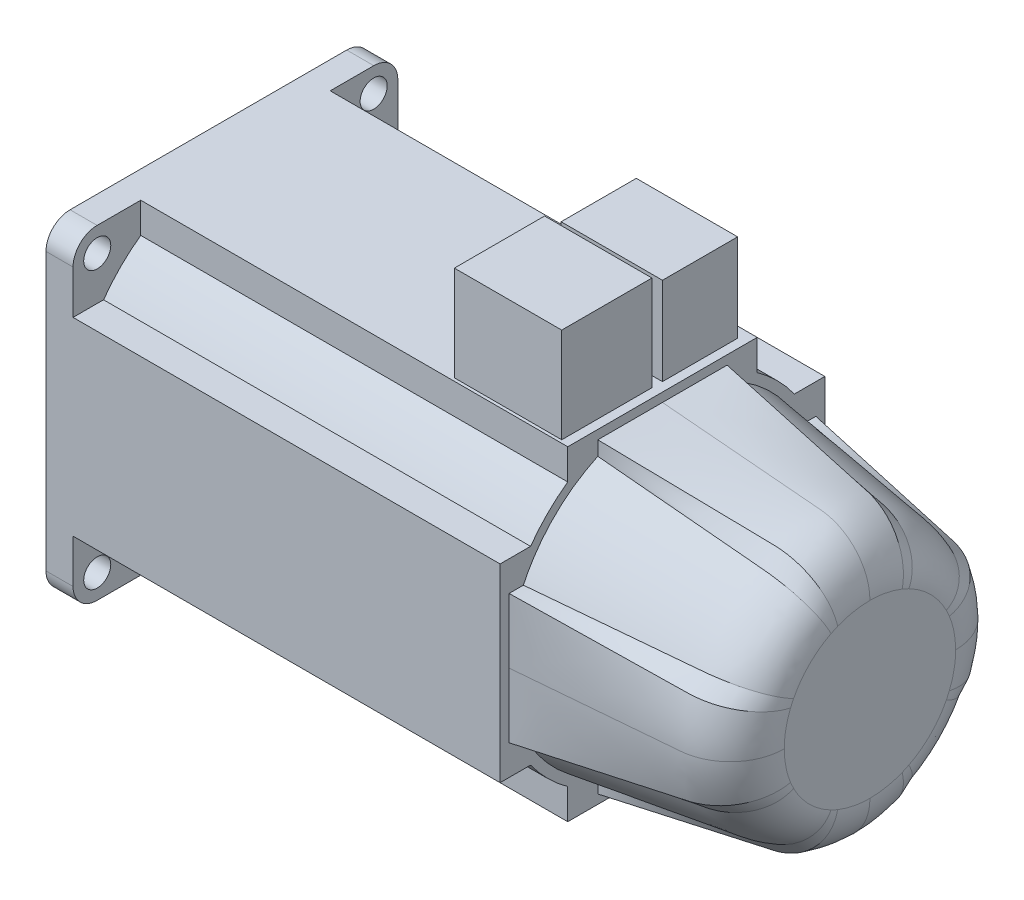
ISO-10303-21;
HEADER;
FILE_DESCRIPTION(('STEP AP214'),'2;1');
FILE_NAME('part.step','',(''),(''),'','','');
FILE_SCHEMA(('AUTOMOTIVE_DESIGN { 1 0 10303 214 1 1 1 1 }'));
ENDSEC;
DATA;
#1=APPLICATION_CONTEXT('core data for automotive mechanical design processes');
#2=APPLICATION_PROTOCOL_DEFINITION('international standard','automotive_design',2000,#1);
#3=PRODUCT_CONTEXT('',#1,'mechanical');
#4=PRODUCT('Part','Part','',(#3));
#5=PRODUCT_RELATED_PRODUCT_CATEGORY('part','',(#4));
#6=PRODUCT_DEFINITION_FORMATION('','',#4);
#7=PRODUCT_DEFINITION_CONTEXT('part definition',#1,'design');
#8=PRODUCT_DEFINITION('design','',#6,#7);
#9=PRODUCT_DEFINITION_SHAPE('','',#8);
#10=(LENGTH_UNIT() NAMED_UNIT(*) SI_UNIT(.MILLI.,.METRE.));
#11=(NAMED_UNIT(*) PLANE_ANGLE_UNIT() SI_UNIT($,.RADIAN.));
#12=(NAMED_UNIT(*) SI_UNIT($,.STERADIAN.) SOLID_ANGLE_UNIT());
#13=UNCERTAINTY_MEASURE_WITH_UNIT(LENGTH_MEASURE(1.E-05),#10,'distance_accuracy_value','');
#14=(GEOMETRIC_REPRESENTATION_CONTEXT(3) GLOBAL_UNCERTAINTY_ASSIGNED_CONTEXT((#13)) GLOBAL_UNIT_ASSIGNED_CONTEXT((#10,
#11,#12)) REPRESENTATION_CONTEXT('',''));
#15=CARTESIAN_POINT('',(0.,0.,0.));
#16=DIRECTION('',(0.,0.,1.));
#17=DIRECTION('',(1.,0.,0.));
#18=AXIS2_PLACEMENT_3D('',#15,#16,#17);
#19=CARTESIAN_POINT('',(9.,54.,46.));
#20=DIRECTION('',(0.,-1.,0.));
#21=DIRECTION('',(0.,0.,-1.));
#22=AXIS2_PLACEMENT_3D('',#19,#20,#21);
#23=PLANE('',#22);
#24=DIRECTION('',(0.,0.,-1.));
#25=VECTOR('',#24,1.);
#26=CARTESIAN_POINT('',(148.,54.,0.499999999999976));
#27=LINE('',#26,#25);
#28=CARTESIAN_POINT('',(148.,54.,30.5));
#29=VERTEX_POINT('',#28);
#30=CARTESIAN_POINT('',(148.,54.,0.499999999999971));
#31=VERTEX_POINT('',#30);
#32=EDGE_CURVE('E375',#29,#31,#27,.T.);
#33=ORIENTED_EDGE('',*,*,#32,.F.);
#34=DIRECTION('',(1.,0.,0.));
#35=VECTOR('',#34,1.);
#36=CARTESIAN_POINT('',(148.,54.,30.5));
#37=LINE('',#36,#35);
#38=CARTESIAN_POINT('',(112.3,54.,30.5));
#39=VERTEX_POINT('',#38);
#40=EDGE_CURVE('E384',#39,#29,#37,.T.);
#41=ORIENTED_EDGE('',*,*,#40,.F.);
#42=DIRECTION('',(0.,0.,1.));
#43=VECTOR('',#42,1.);
#44=CARTESIAN_POINT('',(112.3,54.,0.499999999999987));
#45=LINE('',#44,#43);
#46=CARTESIAN_POINT('',(112.3,54.,0.499999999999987));
#47=VERTEX_POINT('',#46);
#48=EDGE_CURVE('E381',#47,#39,#45,.T.);
#49=ORIENTED_EDGE('',*,*,#48,.F.);
#50=DIRECTION('',(-1.,0.,0.));
#51=VECTOR('',#50,1.);
#52=CARTESIAN_POINT('',(148.,54.,0.499999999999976));
#53=LINE('',#52,#51);
#54=EDGE_CURVE('E378',#31,#47,#53,.T.);
#55=ORIENTED_EDGE('',*,*,#54,.F.);
#56=EDGE_LOOP('',(#33,#41,#49,#55));
#57=FACE_BOUND('',#56,.T.);
#58=DIRECTION('',(0.,0.,1.));
#59=VECTOR('',#58,1.);
#60=CARTESIAN_POINT('',(0.,54.,46.));
#61=LINE('',#60,#59);
#62=CARTESIAN_POINT('',(0.,54.,-46.));
#63=VERTEX_POINT('',#62);
#64=CARTESIAN_POINT('',(0.,54.,46.));
#65=VERTEX_POINT('',#64);
#66=EDGE_CURVE('E822',#63,#65,#61,.T.);
#67=ORIENTED_EDGE('',*,*,#66,.T.);
#68=DIRECTION('',(-1.,0.,0.));
#69=VECTOR('',#68,1.);
#70=CARTESIAN_POINT('',(9.,54.,46.));
#71=LINE('',#70,#69);
#72=CARTESIAN_POINT('',(9.,54.,46.));
#73=VERTEX_POINT('',#72);
#74=EDGE_CURVE('E849',#73,#65,#71,.T.);
#75=ORIENTED_EDGE('',*,*,#74,.F.);
#76=DIRECTION('',(0.,0.,1.));
#77=VECTOR('',#76,1.);
#78=CARTESIAN_POINT('',(9.,54.,46.));
#79=LINE('',#78,#77);
#80=CARTESIAN_POINT('',(9.,54.,31.5));
#81=VERTEX_POINT('',#80);
#82=EDGE_CURVE('E845',#81,#73,#79,.T.);
#83=ORIENTED_EDGE('',*,*,#82,.F.);
#84=DIRECTION('',(-1.,0.,0.));
#85=VECTOR('',#84,1.);
#86=CARTESIAN_POINT('',(151.,54.,31.5));
#87=LINE('',#86,#85);
#88=CARTESIAN_POINT('',(151.,54.,31.5));
#89=VERTEX_POINT('',#88);
#90=EDGE_CURVE('E741',#89,#81,#87,.T.);
#91=ORIENTED_EDGE('',*,*,#90,.F.);
#92=DIRECTION('',(0.,0.,1.));
#93=VECTOR('',#92,1.);
#94=CARTESIAN_POINT('',(151.,54.,-31.5));
#95=LINE('',#94,#93);
#96=CARTESIAN_POINT('',(151.,54.,-31.5));
#97=VERTEX_POINT('',#96);
#98=EDGE_CURVE('E715',#97,#89,#95,.T.);
#99=ORIENTED_EDGE('',*,*,#98,.F.);
#100=DIRECTION('',(-1.,0.,0.));
#101=VECTOR('',#100,1.);
#102=CARTESIAN_POINT('',(151.,54.,-31.5));
#103=LINE('',#102,#101);
#104=CARTESIAN_POINT('',(9.,54.,-31.5));
#105=VERTEX_POINT('',#104);
#106=EDGE_CURVE('E743',#97,#105,#103,.T.);
#107=ORIENTED_EDGE('',*,*,#106,.T.);
#108=CARTESIAN_POINT('',(9.,54.,-46.));
#109=VERTEX_POINT('',#108);
#110=EDGE_CURVE('E846',#109,#105,#79,.T.);
#111=ORIENTED_EDGE('',*,*,#110,.F.);
#112=DIRECTION('',(-1.,0.,0.));
#113=VECTOR('',#112,1.);
#114=CARTESIAN_POINT('',(9.,54.,-46.));
#115=LINE('',#114,#113);
#116=EDGE_CURVE('E852',#109,#63,#115,.T.);
#117=ORIENTED_EDGE('',*,*,#116,.T.);
#118=EDGE_LOOP('',(#67,#75,#83,#91,#99,#107,#111,#117));
#119=FACE_BOUND('',#118,.T.);
#120=DIRECTION('',(-1.,0.,0.));
#121=VECTOR('',#120,1.);
#122=CARTESIAN_POINT('',(148.,54.,-28.));
#123=LINE('',#122,#121);
#124=CARTESIAN_POINT('',(148.,54.,-28.));
#125=VERTEX_POINT('',#124);
#126=CARTESIAN_POINT('',(114.3,54.,-28.));
#127=VERTEX_POINT('',#126);
#128=EDGE_CURVE('E343',#125,#127,#123,.T.);
#129=ORIENTED_EDGE('',*,*,#128,.F.);
#130=DIRECTION('',(0.,0.,-1.));
#131=VECTOR('',#130,1.);
#132=CARTESIAN_POINT('',(148.,54.,-28.));
#133=LINE('',#132,#131);
#134=CARTESIAN_POINT('',(148.,54.,-3.));
#135=VERTEX_POINT('',#134);
#136=EDGE_CURVE('E345',#135,#125,#133,.T.);
#137=ORIENTED_EDGE('',*,*,#136,.F.);
#138=DIRECTION('',(1.,0.,0.));
#139=VECTOR('',#138,1.);
#140=CARTESIAN_POINT('',(148.,54.,-3.));
#141=LINE('',#140,#139);
#142=CARTESIAN_POINT('',(114.3,54.,-3.));
#143=VERTEX_POINT('',#142);
#144=EDGE_CURVE('E38',#143,#135,#141,.T.);
#145=ORIENTED_EDGE('',*,*,#144,.F.);
#146=DIRECTION('',(0.,0.,1.));
#147=VECTOR('',#146,1.);
#148=CARTESIAN_POINT('',(114.3,54.,-28.));
#149=LINE('',#148,#147);
#150=EDGE_CURVE('E33',#127,#143,#149,.T.);
#151=ORIENTED_EDGE('',*,*,#150,.F.);
#152=EDGE_LOOP('',(#129,#137,#145,#151));
#153=FACE_BOUND('',#152,.T.);
#154=ADVANCED_FACE('F16',(#57,#119,#153),#23,.F.);
#155=CARTESIAN_POINT('',(0.,46.,46.));
#156=DIRECTION('',(1.,0.,0.));
#157=DIRECTION('',(0.,0.,-1.));
#158=AXIS2_PLACEMENT_3D('',#155,#156,#157);
#159=PLANE('',#158);
#160=CARTESIAN_POINT('',(0.,-45.9619407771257,45.9619407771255));
#161=DIRECTION('',(-1.,0.,0.));
#162=DIRECTION('',(0.,0.,1.));
#163=AXIS2_PLACEMENT_3D('',#160,#161,#162);
#164=CIRCLE('',#163,4.5);
#165=CARTESIAN_POINT('',(0.,-45.9619407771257,50.4619407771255));
#166=VERTEX_POINT('',#165);
#167=EDGE_CURVE('E408',#166,#166,#164,.T.);
#168=ORIENTED_EDGE('',*,*,#167,.F.);
#169=EDGE_LOOP('',(#168));
#170=FACE_BOUND('',#169,.T.);
#171=CARTESIAN_POINT('',(0.,45.9619407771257,45.9619407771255));
#172=DIRECTION('',(-1.,0.,0.));
#173=DIRECTION('',(0.,0.,1.));
#174=AXIS2_PLACEMENT_3D('',#171,#172,#173);
#175=CIRCLE('',#174,4.5);
#176=CARTESIAN_POINT('',(0.,45.9619407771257,50.4619407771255));
#177=VERTEX_POINT('',#176);
#178=EDGE_CURVE('E411',#177,#177,#175,.T.);
#179=ORIENTED_EDGE('',*,*,#178,.F.);
#180=EDGE_LOOP('',(#179));
#181=FACE_BOUND('',#180,.T.);
#182=CARTESIAN_POINT('',(0.,45.9619407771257,-45.9619407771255));
#183=DIRECTION('',(-1.,0.,0.));
#184=DIRECTION('',(0.,0.,1.));
#185=AXIS2_PLACEMENT_3D('',#182,#183,#184);
#186=CIRCLE('',#185,4.5);
#187=CARTESIAN_POINT('',(0.,45.9619407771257,-41.4619407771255));
#188=VERTEX_POINT('',#187);
#189=EDGE_CURVE('E415',#188,#188,#186,.T.);
#190=ORIENTED_EDGE('',*,*,#189,.F.);
#191=EDGE_LOOP('',(#190));
#192=FACE_BOUND('',#191,.T.);
#193=CARTESIAN_POINT('',(0.,-45.9619407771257,-45.9619407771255));
#194=DIRECTION('',(-1.,0.,0.));
#195=DIRECTION('',(0.,0.,1.));
#196=AXIS2_PLACEMENT_3D('',#193,#194,#195);
#197=CIRCLE('',#196,4.5);
#198=CARTESIAN_POINT('',(0.,-45.9619407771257,-41.4619407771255));
#199=VERTEX_POINT('',#198);
#200=EDGE_CURVE('E419',#199,#199,#197,.T.);
#201=ORIENTED_EDGE('',*,*,#200,.F.);
#202=EDGE_LOOP('',(#201));
#203=FACE_BOUND('',#202,.T.);
#204=CARTESIAN_POINT('',(0.,-46.,-46.));
#205=DIRECTION('',(1.,0.,0.));
#206=DIRECTION('',(0.,0.,-1.));
#207=AXIS2_PLACEMENT_3D('',#204,#205,#206);
#208=CIRCLE('',#207,8.);
#209=CARTESIAN_POINT('',(0.,-54.,-46.));
#210=VERTEX_POINT('',#209);
#211=CARTESIAN_POINT('',(0.,-46.,-54.));
#212=VERTEX_POINT('',#211);
#213=EDGE_CURVE('E816',#210,#212,#208,.T.);
#214=ORIENTED_EDGE('',*,*,#213,.F.);
#215=DIRECTION('',(0.,0.,-1.));
#216=VECTOR('',#215,1.);
#217=CARTESIAN_POINT('',(0.,-54.,46.));
#218=LINE('',#217,#216);
#219=CARTESIAN_POINT('',(0.,-54.,46.));
#220=VERTEX_POINT('',#219);
#221=EDGE_CURVE('E814',#220,#210,#218,.T.);
#222=ORIENTED_EDGE('',*,*,#221,.F.);
#223=CARTESIAN_POINT('',(0.,-46.,46.));
#224=DIRECTION('',(1.,0.,0.));
#225=DIRECTION('',(0.,0.,-1.));
#226=AXIS2_PLACEMENT_3D('',#223,#224,#225);
#227=CIRCLE('',#226,8.);
#228=CARTESIAN_POINT('',(0.,-46.,54.));
#229=VERTEX_POINT('',#228);
#230=EDGE_CURVE('E812',#229,#220,#227,.T.);
#231=ORIENTED_EDGE('',*,*,#230,.F.);
#232=DIRECTION('',(0.,-1.,0.));
#233=VECTOR('',#232,1.);
#234=CARTESIAN_POINT('',(0.,46.,54.));
#235=LINE('',#234,#233);
#236=CARTESIAN_POINT('',(0.,46.,54.));
#237=VERTEX_POINT('',#236);
#238=EDGE_CURVE('E810',#237,#229,#235,.T.);
#239=ORIENTED_EDGE('',*,*,#238,.F.);
#240=CARTESIAN_POINT('',(0.,46.,46.));
#241=DIRECTION('',(1.,0.,0.));
#242=DIRECTION('',(0.,0.,-1.));
#243=AXIS2_PLACEMENT_3D('',#240,#241,#242);
#244=CIRCLE('',#243,8.);
#245=EDGE_CURVE('E807',#65,#237,#244,.T.);
#246=ORIENTED_EDGE('',*,*,#245,.F.);
#247=ORIENTED_EDGE('',*,*,#66,.F.);
#248=CARTESIAN_POINT('',(0.,46.,-46.));
#249=DIRECTION('',(1.,0.,0.));
#250=DIRECTION('',(0.,0.,1.));
#251=AXIS2_PLACEMENT_3D('',#248,#249,#250);
#252=CIRCLE('',#251,8.);
#253=CARTESIAN_POINT('',(0.,46.,-54.));
#254=VERTEX_POINT('',#253);
#255=EDGE_CURVE('E820',#254,#63,#252,.T.);
#256=ORIENTED_EDGE('',*,*,#255,.F.);
#257=DIRECTION('',(0.,1.,0.));
#258=VECTOR('',#257,1.);
#259=CARTESIAN_POINT('',(0.,46.,-54.));
#260=LINE('',#259,#258);
#261=EDGE_CURVE('E818',#212,#254,#260,.T.);
#262=ORIENTED_EDGE('',*,*,#261,.F.);
#263=EDGE_LOOP('',(#214,#222,#231,#239,#246,#247,#256,#262));
#264=FACE_BOUND('',#263,.T.);
#265=CARTESIAN_POINT('',(0.,0.,0.));
#266=DIRECTION('',(1.,0.,0.));
#267=DIRECTION('',(0.,0.,-1.));
#268=AXIS2_PLACEMENT_3D('',#265,#266,#267);
#269=CIRCLE('',#268,40.);
#270=CARTESIAN_POINT('',(0.,0.,-40.));
#271=VERTEX_POINT('',#270);
#272=EDGE_CURVE('E11',#271,#271,#269,.F.);
#273=ORIENTED_EDGE('',*,*,#272,.F.);
#274=EDGE_LOOP('',(#273));
#275=FACE_BOUND('',#274,.T.);
#276=ADVANCED_FACE('F482',(#170,#181,#192,#203,#264,#275),#159,.F.);
#277=CARTESIAN_POINT('',(151.,0.,0.));
#278=DIRECTION('',(1.,0.,0.));
#279=DIRECTION('',(0.,0.,-1.));
#280=AXIS2_PLACEMENT_3D('',#277,#278,#279);
#281=PLANE('',#280);
#282=CARTESIAN_POINT('',(151.,0.,0.));
#283=DIRECTION('',(1.,0.,0.));
#284=DIRECTION('',(0.,0.,-1.));
#285=AXIS2_PLACEMENT_3D('',#282,#283,#284);
#286=CIRCLE('',#285,54.);
#287=CARTESIAN_POINT('',(151.,-31.5,43.8605745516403));
#288=VERTEX_POINT('',#287);
#289=CARTESIAN_POINT('',(151.,-43.8605745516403,31.5));
#290=VERTEX_POINT('',#289);
#291=EDGE_CURVE('E688',#288,#290,#286,.T.);
#292=ORIENTED_EDGE('',*,*,#291,.T.);
#293=DIRECTION('',(0.,-1.,0.));
#294=VECTOR('',#293,1.);
#295=CARTESIAN_POINT('',(151.,-43.8605745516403,31.5));
#296=LINE('',#295,#294);
#297=CARTESIAN_POINT('',(151.,-54.,31.5));
#298=VERTEX_POINT('',#297);
#299=EDGE_CURVE('E696',#290,#298,#296,.T.);
#300=ORIENTED_EDGE('',*,*,#299,.T.);
#301=DIRECTION('',(0.,0.,-1.));
#302=VECTOR('',#301,1.);
#303=CARTESIAN_POINT('',(151.,-54.,31.5));
#304=LINE('',#303,#302);
#305=CARTESIAN_POINT('',(151.,-54.,-31.5));
#306=VERTEX_POINT('',#305);
#307=EDGE_CURVE('E699',#298,#306,#304,.T.);
#308=ORIENTED_EDGE('',*,*,#307,.T.);
#309=DIRECTION('',(0.,1.,0.));
#310=VECTOR('',#309,1.);
#311=CARTESIAN_POINT('',(151.,-43.8605745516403,-31.5));
#312=LINE('',#311,#310);
#313=CARTESIAN_POINT('',(151.,-43.8605745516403,-31.5));
#314=VERTEX_POINT('',#313);
#315=EDGE_CURVE('E701',#306,#314,#312,.T.);
#316=ORIENTED_EDGE('',*,*,#315,.T.);
#317=CARTESIAN_POINT('',(151.,0.,0.));
#318=DIRECTION('',(1.,0.,0.));
#319=DIRECTION('',(0.,0.,-1.));
#320=AXIS2_PLACEMENT_3D('',#317,#318,#319);
#321=CIRCLE('',#320,54.);
#322=CARTESIAN_POINT('',(151.,-31.5,-43.8605745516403));
#323=VERTEX_POINT('',#322);
#324=EDGE_CURVE('E703',#314,#323,#321,.T.);
#325=ORIENTED_EDGE('',*,*,#324,.T.);
#326=DIRECTION('',(0.,0.,-1.));
#327=VECTOR('',#326,1.);
#328=CARTESIAN_POINT('',(151.,-31.5,-43.8605745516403));
#329=LINE('',#328,#327);
#330=CARTESIAN_POINT('',(151.,-31.5,-54.));
#331=VERTEX_POINT('',#330);
#332=EDGE_CURVE('E705',#323,#331,#329,.T.);
#333=ORIENTED_EDGE('',*,*,#332,.T.);
#334=DIRECTION('',(0.,1.,0.));
#335=VECTOR('',#334,1.);
#336=CARTESIAN_POINT('',(151.,-31.5,-54.));
#337=LINE('',#336,#335);
#338=CARTESIAN_POINT('',(151.,31.5,-54.));
#339=VERTEX_POINT('',#338);
#340=EDGE_CURVE('E707',#331,#339,#337,.T.);
#341=ORIENTED_EDGE('',*,*,#340,.T.);
#342=DIRECTION('',(0.,0.,1.));
#343=VECTOR('',#342,1.);
#344=CARTESIAN_POINT('',(151.,31.5,-43.8605745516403));
#345=LINE('',#344,#343);
#346=CARTESIAN_POINT('',(151.,31.5,-43.8605745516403));
#347=VERTEX_POINT('',#346);
#348=EDGE_CURVE('E709',#339,#347,#345,.T.);
#349=ORIENTED_EDGE('',*,*,#348,.T.);
#350=CARTESIAN_POINT('',(151.,0.,0.));
#351=DIRECTION('',(1.,0.,0.));
#352=DIRECTION('',(0.,0.,-1.));
#353=AXIS2_PLACEMENT_3D('',#350,#351,#352);
#354=CIRCLE('',#353,54.);
#355=CARTESIAN_POINT('',(151.,43.8605745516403,-31.5));
#356=VERTEX_POINT('',#355);
#357=EDGE_CURVE('E711',#347,#356,#354,.T.);
#358=ORIENTED_EDGE('',*,*,#357,.T.);
#359=DIRECTION('',(0.,1.,0.));
#360=VECTOR('',#359,1.);
#361=CARTESIAN_POINT('',(151.,43.8605745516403,-31.5));
#362=LINE('',#361,#360);
#363=EDGE_CURVE('E713',#356,#97,#362,.T.);
#364=ORIENTED_EDGE('',*,*,#363,.T.);
#365=ORIENTED_EDGE('',*,*,#98,.T.);
#366=DIRECTION('',(0.,-1.,0.));
#367=VECTOR('',#366,1.);
#368=CARTESIAN_POINT('',(151.,43.8605745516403,31.5));
#369=LINE('',#368,#367);
#370=CARTESIAN_POINT('',(151.,43.8605745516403,31.5));
#371=VERTEX_POINT('',#370);
#372=EDGE_CURVE('E717',#89,#371,#369,.T.);
#373=ORIENTED_EDGE('',*,*,#372,.T.);
#374=CARTESIAN_POINT('',(151.,0.,0.));
#375=DIRECTION('',(1.,0.,0.));
#376=DIRECTION('',(0.,0.,-1.));
#377=AXIS2_PLACEMENT_3D('',#374,#375,#376);
#378=CIRCLE('',#377,54.);
#379=CARTESIAN_POINT('',(151.,31.5,43.8605745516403));
#380=VERTEX_POINT('',#379);
#381=EDGE_CURVE('E719',#371,#380,#378,.T.);
#382=ORIENTED_EDGE('',*,*,#381,.T.);
#383=DIRECTION('',(0.,0.,1.));
#384=VECTOR('',#383,1.);
#385=CARTESIAN_POINT('',(151.,31.5,54.));
#386=LINE('',#385,#384);
#387=CARTESIAN_POINT('',(151.,31.5,54.));
#388=VERTEX_POINT('',#387);
#389=EDGE_CURVE('E721',#380,#388,#386,.T.);
#390=ORIENTED_EDGE('',*,*,#389,.T.);
#391=DIRECTION('',(0.,-1.,0.));
#392=VECTOR('',#391,1.);
#393=CARTESIAN_POINT('',(151.,31.5,54.));
#394=LINE('',#393,#392);
#395=CARTESIAN_POINT('',(151.,-31.5,54.));
#396=VERTEX_POINT('',#395);
#397=EDGE_CURVE('E723',#388,#396,#394,.T.);
#398=ORIENTED_EDGE('',*,*,#397,.T.);
#399=DIRECTION('',(0.,0.,-1.));
#400=VECTOR('',#399,1.);
#401=CARTESIAN_POINT('',(151.,-31.5,54.));
#402=LINE('',#401,#400);
#403=EDGE_CURVE('E725',#396,#288,#402,.T.);
#404=ORIENTED_EDGE('',*,*,#403,.T.);
#405=EDGE_LOOP('',(#292,#300,#308,#316,#325,#333,#341,#349,#358,#364,#365,#373,#382,#390,#398,#404));
#406=FACE_BOUND('',#405,.T.);
#407=DIRECTION('',(0.,1.,0.));
#408=VECTOR('',#407,1.);
#409=CARTESIAN_POINT('',(151.,0.,-21.5));
#410=LINE('',#409,#408);
#411=CARTESIAN_POINT('',(151.,46.2466214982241,-21.5));
#412=VERTEX_POINT('',#411);
#413=CARTESIAN_POINT('',(151.,51.,-21.5));
#414=VERTEX_POINT('',#413);
#415=EDGE_CURVE('E652',#412,#414,#410,.T.);
#416=ORIENTED_EDGE('',*,*,#415,.F.);
#417=CARTESIAN_POINT('',(151.,21.5,-46.2466214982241));
#418=CARTESIAN_POINT('',(151.,22.368162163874,-45.8430542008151));
#419=CARTESIAN_POINT('',(151.,23.2249365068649,-45.4149951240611));
#420=CARTESIAN_POINT('',(151.,24.9133072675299,-44.5112135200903));
#421=CARTESIAN_POINT('',(151.,25.744895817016,-44.0354762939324));
#422=CARTESIAN_POINT('',(151.,27.3800837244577,-43.0378298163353));
#423=CARTESIAN_POINT('',(151.,28.1836785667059,-42.515913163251));
#424=CARTESIAN_POINT('',(151.,29.7572005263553,-41.4297126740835));
#425=CARTESIAN_POINT('',(151.,30.5272439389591,-40.8655973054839));
#426=CARTESIAN_POINT('',(151.,32.0343154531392,-39.6951769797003));
#427=CARTESIAN_POINT('',(151.,32.7713501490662,-39.0888805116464));
#428=CARTESIAN_POINT('',(151.,34.2100000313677,-37.836135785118));
#429=CARTESIAN_POINT('',(151.,34.9116287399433,-37.1897030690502));
#430=CARTESIAN_POINT('',(151.,36.1381492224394,-35.9943923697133));
#431=CARTESIAN_POINT('',(151.,36.6698922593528,-35.4525213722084));
#432=CARTESIAN_POINT('',(151.,37.7085970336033,-34.3456730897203));
#433=CARTESIAN_POINT('',(151.,38.2155627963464,-33.7806995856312));
#434=CARTESIAN_POINT('',(151.,39.2035976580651,-32.6289093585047));
#435=CARTESIAN_POINT('',(151.,39.6846761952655,-32.0421007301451));
#436=CARTESIAN_POINT('',(151.,40.6201993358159,-30.8475794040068));
#437=CARTESIAN_POINT('',(151.,41.0746426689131,-30.2398657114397));
#438=CARTESIAN_POINT('',(151.,41.9707843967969,-28.9839896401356));
#439=CARTESIAN_POINT('',(151.,42.4115400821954,-28.3351542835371));
#440=CARTESIAN_POINT('',(151.,43.2626518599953,-27.0178472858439));
#441=CARTESIAN_POINT('',(151.,43.6730080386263,-26.3493757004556));
#442=CARTESIAN_POINT('',(151.,44.4627125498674,-24.9937558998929));
#443=CARTESIAN_POINT('',(151.,44.8420397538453,-24.306595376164));
#444=CARTESIAN_POINT('',(151.,45.5685986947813,-22.9155043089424));
#445=CARTESIAN_POINT('',(151.,45.9158301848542,-22.2115736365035));
#446=CARTESIAN_POINT('',(151.,46.2466214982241,-21.5));
#447=B_SPLINE_CURVE_WITH_KNOTS('',3,(#417,#418,#419,#420,#421,#422,#423,#424,#425,#426,#427,
#428,#429,#430,#431,#432,#433,#434,#435,#436,#437,#438,#439,#440,#441,#442,#443,#444,#445,#446),
.UNSPECIFIED.,.F.,.F.,(4,2,2,2,2,2,2,2,2,2,2,2,2,2,4),(0.,2.87175098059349,5.74439004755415,
8.61749037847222,11.479676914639,14.3412890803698,17.2017999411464,19.4786597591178,
21.7551484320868,24.0308014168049,26.3065628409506,28.6588650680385,31.0111606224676,
33.3650448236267,35.7189471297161),.UNSPECIFIED.);
#448=CARTESIAN_POINT('',(151.,21.5,-46.2466214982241));
#449=VERTEX_POINT('',#448);
#450=EDGE_CURVE('E488',#449,#412,#447,.T.);
#451=ORIENTED_EDGE('',*,*,#450,.F.);
#452=DIRECTION('',(0.,0.,-1.));
#453=VECTOR('',#452,1.);
#454=CARTESIAN_POINT('',(151.,21.5,0.));
#455=LINE('',#454,#453);
#456=CARTESIAN_POINT('',(151.,21.5,-51.));
#457=VERTEX_POINT('',#456);
#458=EDGE_CURVE('E1910',#457,#449,#455,.F.);
#459=ORIENTED_EDGE('',*,*,#458,.F.);
#460=DIRECTION('',(0.,1.,0.));
#461=VECTOR('',#460,1.);
#462=CARTESIAN_POINT('',(151.,0.,-51.));
#463=LINE('',#462,#461);
#464=CARTESIAN_POINT('',(151.,0.,-51.));
#465=VERTEX_POINT('',#464);
#466=EDGE_CURVE('E1906',#465,#457,#463,.T.);
#467=ORIENTED_EDGE('',*,*,#466,.F.);
#468=DIRECTION('',(0.,1.,0.));
#469=VECTOR('',#468,1.);
#470=CARTESIAN_POINT('',(151.,0.,-51.));
#471=LINE('',#470,#469);
#472=CARTESIAN_POINT('',(151.,-21.5,-51.));
#473=VERTEX_POINT('',#472);
#474=EDGE_CURVE('E1892',#473,#465,#471,.T.);
#475=ORIENTED_EDGE('',*,*,#474,.F.);
#476=DIRECTION('',(0.,0.,-1.));
#477=VECTOR('',#476,1.);
#478=CARTESIAN_POINT('',(151.,-21.5,0.));
#479=LINE('',#478,#477);
#480=CARTESIAN_POINT('',(151.,-21.5,-46.2466214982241));
#481=VERTEX_POINT('',#480);
#482=EDGE_CURVE('E1885',#481,#473,#479,.T.);
#483=ORIENTED_EDGE('',*,*,#482,.F.);
#484=CARTESIAN_POINT('',(151.,-46.2466214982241,-21.5));
#485=CARTESIAN_POINT('',(151.,-45.8430542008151,-22.368162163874));
#486=CARTESIAN_POINT('',(151.,-45.4149951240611,-23.2249365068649));
#487=CARTESIAN_POINT('',(151.,-44.5112135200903,-24.9133072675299));
#488=CARTESIAN_POINT('',(151.,-44.0354762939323,-25.744895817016));
#489=CARTESIAN_POINT('',(151.,-43.0378298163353,-27.3800837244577));
#490=CARTESIAN_POINT('',(151.,-42.515913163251,-28.1836785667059));
#491=CARTESIAN_POINT('',(151.,-41.4297126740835,-29.7572005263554));
#492=CARTESIAN_POINT('',(151.,-40.8655973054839,-30.5272439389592));
#493=CARTESIAN_POINT('',(151.,-39.6951769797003,-32.0343154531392));
#494=CARTESIAN_POINT('',(151.,-39.0888805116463,-32.7713501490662));
#495=CARTESIAN_POINT('',(151.,-37.8361357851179,-34.2100000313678));
#496=CARTESIAN_POINT('',(151.,-37.1897030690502,-34.9116287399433));
#497=CARTESIAN_POINT('',(151.,-35.9943923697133,-36.1381492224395));
#498=CARTESIAN_POINT('',(151.,-35.4525213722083,-36.6698922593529));
#499=CARTESIAN_POINT('',(151.,-34.3456730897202,-37.7085970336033));
#500=CARTESIAN_POINT('',(151.,-33.7806995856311,-38.2155627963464));
#501=CARTESIAN_POINT('',(151.,-32.6289093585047,-39.2035976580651));
#502=CARTESIAN_POINT('',(151.,-32.0421007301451,-39.6846761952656));
#503=CARTESIAN_POINT('',(151.,-30.8475794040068,-40.620199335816));
#504=CARTESIAN_POINT('',(151.,-30.2398657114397,-41.0746426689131));
#505=CARTESIAN_POINT('',(151.,-28.9839896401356,-41.9707843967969));
#506=CARTESIAN_POINT('',(151.,-28.3351542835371,-42.4115400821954));
#507=CARTESIAN_POINT('',(151.,-27.0178472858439,-43.2626518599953));
#508=CARTESIAN_POINT('',(151.,-26.3493757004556,-43.6730080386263));
#509=CARTESIAN_POINT('',(151.,-24.9937558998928,-44.4627125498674));
#510=CARTESIAN_POINT('',(151.,-24.306595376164,-44.8420397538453));
#511=CARTESIAN_POINT('',(151.,-22.9155043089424,-45.5685986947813));
#512=CARTESIAN_POINT('',(151.,-22.2115736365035,-45.9158301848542));
#513=CARTESIAN_POINT('',(151.,-21.5,-46.2466214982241));
#514=B_SPLINE_CURVE_WITH_KNOTS('',3,(#484,#485,#486,#487,#488,#489,#490,#491,#492,#493,#494,
#495,#496,#497,#498,#499,#500,#501,#502,#503,#504,#505,#506,#507,#508,#509,#510,#511,#512,#513),
.UNSPECIFIED.,.F.,.F.,(4,2,2,2,2,2,2,2,2,2,2,2,2,2,4),(0.,2.87175098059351,5.74439004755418,
8.61749037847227,11.479676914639,14.3412890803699,17.2017999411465,19.4786597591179,
21.7551484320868,24.0308014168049,26.3065628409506,28.6588650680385,31.0111606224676,
33.3650448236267,35.7189471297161),.UNSPECIFIED.);
#515=CARTESIAN_POINT('',(151.,-46.2466214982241,-21.5));
#516=VERTEX_POINT('',#515);
#517=EDGE_CURVE('E498',#516,#481,#514,.T.);
#518=ORIENTED_EDGE('',*,*,#517,.F.);
#519=DIRECTION('',(0.,1.,0.));
#520=VECTOR('',#519,1.);
#521=CARTESIAN_POINT('',(151.,0.,-21.5));
#522=LINE('',#521,#520);
#523=CARTESIAN_POINT('',(151.,-51.,-21.5));
#524=VERTEX_POINT('',#523);
#525=EDGE_CURVE('E1789',#524,#516,#522,.T.);
#526=ORIENTED_EDGE('',*,*,#525,.F.);
#527=DIRECTION('',(0.,0.,-1.));
#528=VECTOR('',#527,1.);
#529=CARTESIAN_POINT('',(151.,-51.,0.));
#530=LINE('',#529,#528);
#531=CARTESIAN_POINT('',(151.,-51.,0.));
#532=VERTEX_POINT('',#531);
#533=EDGE_CURVE('E1773',#532,#524,#530,.T.);
#534=ORIENTED_EDGE('',*,*,#533,.F.);
#535=DIRECTION('',(0.,0.,-1.));
#536=VECTOR('',#535,1.);
#537=CARTESIAN_POINT('',(151.,-51.,0.));
#538=LINE('',#537,#536);
#539=CARTESIAN_POINT('',(151.,-51.,21.5));
#540=VERTEX_POINT('',#539);
#541=EDGE_CURVE('E1757',#540,#532,#538,.T.);
#542=ORIENTED_EDGE('',*,*,#541,.F.);
#543=DIRECTION('',(0.,1.,0.));
#544=VECTOR('',#543,1.);
#545=CARTESIAN_POINT('',(151.,0.,21.5));
#546=LINE('',#545,#544);
#547=CARTESIAN_POINT('',(151.,-46.2466214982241,21.5));
#548=VERTEX_POINT('',#547);
#549=EDGE_CURVE('E516',#548,#540,#546,.F.);
#550=ORIENTED_EDGE('',*,*,#549,.F.);
#551=CARTESIAN_POINT('',(151.,-21.5,46.2466214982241));
#552=CARTESIAN_POINT('',(151.,-22.368162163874,45.8430542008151));
#553=CARTESIAN_POINT('',(151.,-23.2249365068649,45.4149951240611));
#554=CARTESIAN_POINT('',(151.,-24.9133072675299,44.5112135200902));
#555=CARTESIAN_POINT('',(151.,-25.744895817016,44.0354762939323));
#556=CARTESIAN_POINT('',(151.,-27.3800837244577,43.0378298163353));
#557=CARTESIAN_POINT('',(151.,-28.1836785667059,42.515913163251));
#558=CARTESIAN_POINT('',(151.,-29.7572005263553,41.4297126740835));
#559=CARTESIAN_POINT('',(151.,-30.5272439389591,40.8655973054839));
#560=CARTESIAN_POINT('',(151.,-32.0343154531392,39.6951769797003));
#561=CARTESIAN_POINT('',(151.,-32.7713501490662,39.0888805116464));
#562=CARTESIAN_POINT('',(151.,-34.2100000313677,37.836135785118));
#563=CARTESIAN_POINT('',(151.,-34.9116287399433,37.1897030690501));
#564=CARTESIAN_POINT('',(151.,-36.1381492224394,35.9943923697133));
#565=CARTESIAN_POINT('',(151.,-36.6698922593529,35.4525213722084));
#566=CARTESIAN_POINT('',(151.,-37.7085970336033,34.3456730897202));
#567=CARTESIAN_POINT('',(151.,-38.2155627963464,33.7806995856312));
#568=CARTESIAN_POINT('',(151.,-39.2035976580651,32.6289093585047));
#569=CARTESIAN_POINT('',(151.,-39.6846761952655,32.0421007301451));
#570=CARTESIAN_POINT('',(151.,-40.620199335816,30.8475794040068));
#571=CARTESIAN_POINT('',(151.,-41.0746426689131,30.2398657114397));
#572=CARTESIAN_POINT('',(151.,-41.9707843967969,28.9839896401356));
#573=CARTESIAN_POINT('',(151.,-42.4115400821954,28.3351542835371));
#574=CARTESIAN_POINT('',(151.,-43.2626518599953,27.0178472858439));
#575=CARTESIAN_POINT('',(151.,-43.6730080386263,26.3493757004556));
#576=CARTESIAN_POINT('',(151.,-44.4627125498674,24.9937558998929));
#577=CARTESIAN_POINT('',(151.,-44.8420397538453,24.306595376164));
#578=CARTESIAN_POINT('',(151.,-45.5685986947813,22.9155043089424));
#579=CARTESIAN_POINT('',(151.,-45.9158301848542,22.2115736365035));
#580=CARTESIAN_POINT('',(151.,-46.2466214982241,21.5));
#581=B_SPLINE_CURVE_WITH_KNOTS('',3,(#551,#552,#553,#554,#555,#556,#557,#558,#559,#560,#561,
#562,#563,#564,#565,#566,#567,#568,#569,#570,#571,#572,#573,#574,#575,#576,#577,#578,#579,#580),
.UNSPECIFIED.,.F.,.F.,(4,2,2,2,2,2,2,2,2,2,2,2,2,2,4),(0.,2.87175098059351,5.74439004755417,
8.61749037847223,11.479676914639,14.3412890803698,17.2017999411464,19.4786597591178,
21.7551484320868,24.0308014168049,26.3065628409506,28.6588650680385,31.0111606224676,
33.3650448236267,35.7189471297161),.UNSPECIFIED.);
#582=CARTESIAN_POINT('',(151.,-21.5,46.2466214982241));
#583=VERTEX_POINT('',#582);
#584=EDGE_CURVE('E506',#583,#548,#581,.T.);
#585=ORIENTED_EDGE('',*,*,#584,.F.);
#586=DIRECTION('',(0.,0.,-1.));
#587=VECTOR('',#586,1.);
#588=CARTESIAN_POINT('',(151.,-21.5,0.));
#589=LINE('',#588,#587);
#590=CARTESIAN_POINT('',(151.,-21.5,51.));
#591=VERTEX_POINT('',#590);
#592=EDGE_CURVE('E518',#591,#583,#589,.T.);
#593=ORIENTED_EDGE('',*,*,#592,.F.);
#594=DIRECTION('',(0.,1.,0.));
#595=VECTOR('',#594,1.);
#596=CARTESIAN_POINT('',(151.,0.,51.));
#597=LINE('',#596,#595);
#598=CARTESIAN_POINT('',(151.,0.,51.));
#599=VERTEX_POINT('',#598);
#600=EDGE_CURVE('E1679',#599,#591,#597,.F.);
#601=ORIENTED_EDGE('',*,*,#600,.F.);
#602=DIRECTION('',(0.,1.,0.));
#603=VECTOR('',#602,1.);
#604=CARTESIAN_POINT('',(151.,0.,51.));
#605=LINE('',#604,#603);
#606=CARTESIAN_POINT('',(151.,21.5,51.));
#607=VERTEX_POINT('',#606);
#608=EDGE_CURVE('E1690',#607,#599,#605,.F.);
#609=ORIENTED_EDGE('',*,*,#608,.F.);
#610=DIRECTION('',(0.,0.,-1.));
#611=VECTOR('',#610,1.);
#612=CARTESIAN_POINT('',(151.,21.5,0.));
#613=LINE('',#612,#611);
#614=CARTESIAN_POINT('',(151.,21.5,46.2466214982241));
#615=VERTEX_POINT('',#614);
#616=EDGE_CURVE('E1632',#615,#607,#613,.F.);
#617=ORIENTED_EDGE('',*,*,#616,.F.);
#618=CARTESIAN_POINT('',(151.,46.2466214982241,21.5));
#619=CARTESIAN_POINT('',(151.,45.8430542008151,22.368162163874));
#620=CARTESIAN_POINT('',(151.,45.4149951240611,23.2249365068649));
#621=CARTESIAN_POINT('',(151.,44.5112135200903,24.9133072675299));
#622=CARTESIAN_POINT('',(151.,44.0354762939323,25.744895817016));
#623=CARTESIAN_POINT('',(151.,43.0378298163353,27.3800837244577));
#624=CARTESIAN_POINT('',(151.,42.515913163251,28.1836785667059));
#625=CARTESIAN_POINT('',(151.,41.4297126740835,29.7572005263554));
#626=CARTESIAN_POINT('',(151.,40.8655973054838,30.5272439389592));
#627=CARTESIAN_POINT('',(151.,39.6951769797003,32.0343154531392));
#628=CARTESIAN_POINT('',(151.,39.0888805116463,32.7713501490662));
#629=CARTESIAN_POINT('',(151.,37.8361357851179,34.2100000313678));
#630=CARTESIAN_POINT('',(151.,37.1897030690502,34.9116287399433));
#631=CARTESIAN_POINT('',(151.,35.9943923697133,36.1381492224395));
#632=CARTESIAN_POINT('',(151.,35.4525213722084,36.6698922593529));
#633=CARTESIAN_POINT('',(151.,34.3456730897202,37.7085970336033));
#634=CARTESIAN_POINT('',(151.,33.7806995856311,38.2155627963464));
#635=CARTESIAN_POINT('',(151.,32.6289093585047,39.203597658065));
#636=CARTESIAN_POINT('',(151.,32.0421007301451,39.6846761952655));
#637=CARTESIAN_POINT('',(151.,30.8475794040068,40.6201993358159));
#638=CARTESIAN_POINT('',(151.,30.2398657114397,41.0746426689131));
#639=CARTESIAN_POINT('',(151.,28.9839896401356,41.9707843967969));
#640=CARTESIAN_POINT('',(151.,28.3351542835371,42.4115400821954));
#641=CARTESIAN_POINT('',(151.,27.0178472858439,43.2626518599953));
#642=CARTESIAN_POINT('',(151.,26.3493757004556,43.6730080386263));
#643=CARTESIAN_POINT('',(151.,24.9937558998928,44.4627125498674));
#644=CARTESIAN_POINT('',(151.,24.306595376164,44.8420397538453));
#645=CARTESIAN_POINT('',(151.,22.9155043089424,45.5685986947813));
#646=CARTESIAN_POINT('',(151.,22.2115736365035,45.9158301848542));
#647=CARTESIAN_POINT('',(151.,21.5,46.2466214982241));
#648=B_SPLINE_CURVE_WITH_KNOTS('',3,(#618,#619,#620,#621,#622,#623,#624,#625,#626,#627,#628,
#629,#630,#631,#632,#633,#634,#635,#636,#637,#638,#639,#640,#641,#642,#643,#644,#645,#646,#647),
.UNSPECIFIED.,.F.,.F.,(4,2,2,2,2,2,2,2,2,2,2,2,2,2,4),(0.,2.8717509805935,5.74439004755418,
8.61749037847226,11.479676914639,14.3412890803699,17.2017999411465,19.4786597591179,
21.7551484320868,24.0308014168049,26.3065628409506,28.6588650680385,31.0111606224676,
33.3650448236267,35.7189471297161),.UNSPECIFIED.);
#649=CARTESIAN_POINT('',(151.,46.2466214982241,21.5));
#650=VERTEX_POINT('',#649);
#651=EDGE_CURVE('E677',#650,#615,#648,.T.);
#652=ORIENTED_EDGE('',*,*,#651,.F.);
#653=DIRECTION('',(0.,1.,0.));
#654=VECTOR('',#653,1.);
#655=CARTESIAN_POINT('',(151.,0.,21.5));
#656=LINE('',#655,#654);
#657=CARTESIAN_POINT('',(151.,51.,21.5));
#658=VERTEX_POINT('',#657);
#659=EDGE_CURVE('E877',#658,#650,#656,.F.);
#660=ORIENTED_EDGE('',*,*,#659,.F.);
#661=DIRECTION('',(0.,0.,-1.));
#662=VECTOR('',#661,1.);
#663=CARTESIAN_POINT('',(151.,51.,0.));
#664=LINE('',#663,#662);
#665=CARTESIAN_POINT('',(151.,51.,0.));
#666=VERTEX_POINT('',#665);
#667=EDGE_CURVE('E697',#666,#658,#664,.F.);
#668=ORIENTED_EDGE('',*,*,#667,.F.);
#669=DIRECTION('',(0.,0.,-1.));
#670=VECTOR('',#669,1.);
#671=CARTESIAN_POINT('',(151.,51.,0.));
#672=LINE('',#671,#670);
#673=EDGE_CURVE('E676',#414,#666,#672,.F.);
#674=ORIENTED_EDGE('',*,*,#673,.F.);
#675=EDGE_LOOP('',(#416,#451,#459,#467,#475,#483,#518,#526,#534,#542,#550,#585,#593,#601,#609,
#617,#652,#660,#668,#674));
#676=FACE_BOUND('',#675,.T.);
#677=ADVANCED_FACE('F472',(#406,#676),#281,.T.);
#678=CARTESIAN_POINT('',(9.,46.,46.));
#679=DIRECTION('',(1.,0.,0.));
#680=DIRECTION('',(0.,0.,-1.));
#681=AXIS2_PLACEMENT_3D('',#678,#679,#680);
#682=PLANE('',#681);
#683=CARTESIAN_POINT('',(9.,-45.9619407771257,-45.9619407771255));
#684=DIRECTION('',(1.,0.,0.));
#685=DIRECTION('',(0.,0.,-1.));
#686=AXIS2_PLACEMENT_3D('',#683,#684,#685);
#687=CIRCLE('',#686,4.5);
#688=CARTESIAN_POINT('',(9.,-45.9619407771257,-50.4619407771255));
#689=VERTEX_POINT('',#688);
#690=EDGE_CURVE('E422',#689,#689,#687,.T.);
#691=ORIENTED_EDGE('',*,*,#690,.F.);
#692=EDGE_LOOP('',(#691));
#693=FACE_BOUND('',#692,.T.);
#694=CARTESIAN_POINT('',(9.,0.,0.));
#695=DIRECTION('',(1.,0.,0.));
#696=DIRECTION('',(0.,0.,-1.));
#697=AXIS2_PLACEMENT_3D('',#694,#695,#696);
#698=CIRCLE('',#697,54.);
#699=CARTESIAN_POINT('',(9.,-31.5,-43.8605745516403));
#700=VERTEX_POINT('',#699);
#701=CARTESIAN_POINT('',(9.,-43.8605745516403,-31.5));
#702=VERTEX_POINT('',#701);
#703=EDGE_CURVE('E795',#700,#702,#698,.F.);
#704=ORIENTED_EDGE('',*,*,#703,.T.);
#705=DIRECTION('',(0.,-1.,0.));
#706=VECTOR('',#705,1.);
#707=CARTESIAN_POINT('',(9.,46.,-31.5));
#708=LINE('',#707,#706);
#709=CARTESIAN_POINT('',(9.,-54.,-31.5));
#710=VERTEX_POINT('',#709);
#711=EDGE_CURVE('E798',#702,#710,#708,.T.);
#712=ORIENTED_EDGE('',*,*,#711,.T.);
#713=DIRECTION('',(0.,0.,-1.));
#714=VECTOR('',#713,1.);
#715=CARTESIAN_POINT('',(9.,-54.,46.));
#716=LINE('',#715,#714);
#717=CARTESIAN_POINT('',(9.,-54.,-46.));
#718=VERTEX_POINT('',#717);
#719=EDGE_CURVE('E833',#710,#718,#716,.T.);
#720=ORIENTED_EDGE('',*,*,#719,.T.);
#721=CARTESIAN_POINT('',(9.,-46.,-46.));
#722=DIRECTION('',(1.,0.,0.));
#723=DIRECTION('',(0.,0.,-1.));
#724=AXIS2_PLACEMENT_3D('',#721,#722,#723);
#725=CIRCLE('',#724,8.);
#726=CARTESIAN_POINT('',(9.,-46.,-54.));
#727=VERTEX_POINT('',#726);
#728=EDGE_CURVE('E837',#718,#727,#725,.T.);
#729=ORIENTED_EDGE('',*,*,#728,.T.);
#730=DIRECTION('',(0.,1.,0.));
#731=VECTOR('',#730,1.);
#732=CARTESIAN_POINT('',(9.,46.,-54.));
#733=LINE('',#732,#731);
#734=CARTESIAN_POINT('',(9.,-31.5,-54.));
#735=VERTEX_POINT('',#734);
#736=EDGE_CURVE('E840',#727,#735,#733,.T.);
#737=ORIENTED_EDGE('',*,*,#736,.T.);
#738=DIRECTION('',(0.,0.,1.));
#739=VECTOR('',#738,1.);
#740=CARTESIAN_POINT('',(9.,-31.5,46.));
#741=LINE('',#740,#739);
#742=EDGE_CURVE('E792',#735,#700,#741,.T.);
#743=ORIENTED_EDGE('',*,*,#742,.T.);
#744=EDGE_LOOP('',(#704,#712,#720,#729,#737,#743));
#745=FACE_BOUND('',#744,.T.);
#746=ADVANCED_FACE('F481',(#693,#745),#682,.T.);
#747=CARTESIAN_POINT('',(9.,45.9619407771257,-45.9619407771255));
#748=DIRECTION('',(1.,0.,0.));
#749=DIRECTION('',(0.,0.,-1.));
#750=AXIS2_PLACEMENT_3D('',#747,#748,#749);
#751=CIRCLE('',#750,4.5);
#752=CARTESIAN_POINT('',(9.,45.9619407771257,-50.4619407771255));
#753=VERTEX_POINT('',#752);
#754=EDGE_CURVE('E418',#753,#753,#751,.T.);
#755=ORIENTED_EDGE('',*,*,#754,.F.);
#756=EDGE_LOOP('',(#755));
#757=FACE_BOUND('',#756,.T.);
#758=CARTESIAN_POINT('',(9.,0.,0.));
#759=DIRECTION('',(1.,0.,0.));
#760=DIRECTION('',(0.,0.,-1.));
#761=AXIS2_PLACEMENT_3D('',#758,#759,#760);
#762=CIRCLE('',#761,54.);
#763=CARTESIAN_POINT('',(9.,43.8605745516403,-31.5));
#764=VERTEX_POINT('',#763);
#765=CARTESIAN_POINT('',(9.,31.5,-43.8605745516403));
#766=VERTEX_POINT('',#765);
#767=EDGE_CURVE('E786',#764,#766,#762,.F.);
#768=ORIENTED_EDGE('',*,*,#767,.T.);
#769=DIRECTION('',(0.,0.,-1.));
#770=VECTOR('',#769,1.);
#771=CARTESIAN_POINT('',(9.,31.5,46.));
#772=LINE('',#771,#770);
#773=CARTESIAN_POINT('',(9.,31.5,-54.));
#774=VERTEX_POINT('',#773);
#775=EDGE_CURVE('E789',#766,#774,#772,.T.);
#776=ORIENTED_EDGE('',*,*,#775,.T.);
#777=CARTESIAN_POINT('',(9.,46.,-54.));
#778=VERTEX_POINT('',#777);
#779=EDGE_CURVE('E839',#774,#778,#733,.T.);
#780=ORIENTED_EDGE('',*,*,#779,.T.);
#781=CARTESIAN_POINT('',(9.,46.,-46.));
#782=DIRECTION('',(1.,0.,0.));
#783=DIRECTION('',(0.,0.,1.));
#784=AXIS2_PLACEMENT_3D('',#781,#782,#783);
#785=CIRCLE('',#784,8.);
#786=EDGE_CURVE('E843',#778,#109,#785,.T.);
#787=ORIENTED_EDGE('',*,*,#786,.T.);
#788=ORIENTED_EDGE('',*,*,#110,.T.);
#789=DIRECTION('',(0.,-1.,0.));
#790=VECTOR('',#789,1.);
#791=CARTESIAN_POINT('',(9.,46.,-31.5));
#792=LINE('',#791,#790);
#793=EDGE_CURVE('E783',#105,#764,#792,.T.);
#794=ORIENTED_EDGE('',*,*,#793,.T.);
#795=EDGE_LOOP('',(#768,#776,#780,#787,#788,#794));
#796=FACE_BOUND('',#795,.T.);
#797=ADVANCED_FACE('F915',(#757,#796),#682,.T.);
#798=CARTESIAN_POINT('',(9.,45.9619407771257,45.9619407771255));
#799=DIRECTION('',(1.,0.,0.));
#800=DIRECTION('',(0.,0.,-1.));
#801=AXIS2_PLACEMENT_3D('',#798,#799,#800);
#802=CIRCLE('',#801,4.5);
#803=CARTESIAN_POINT('',(9.,45.9619407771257,41.4619407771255));
#804=VERTEX_POINT('',#803);
#805=EDGE_CURVE('E414',#804,#804,#802,.T.);
#806=ORIENTED_EDGE('',*,*,#805,.F.);
#807=EDGE_LOOP('',(#806));
#808=FACE_BOUND('',#807,.T.);
#809=CARTESIAN_POINT('',(9.,0.,0.));
#810=DIRECTION('',(1.,0.,0.));
#811=DIRECTION('',(0.,0.,-1.));
#812=AXIS2_PLACEMENT_3D('',#809,#810,#811);
#813=CIRCLE('',#812,54.);
#814=CARTESIAN_POINT('',(9.,31.5,43.8605745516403));
#815=VERTEX_POINT('',#814);
#816=CARTESIAN_POINT('',(9.,43.8605745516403,31.5));
#817=VERTEX_POINT('',#816);
#818=EDGE_CURVE('E777',#815,#817,#813,.F.);
#819=ORIENTED_EDGE('',*,*,#818,.T.);
#820=DIRECTION('',(0.,1.,0.));
#821=VECTOR('',#820,1.);
#822=CARTESIAN_POINT('',(9.,46.,31.5));
#823=LINE('',#822,#821);
#824=EDGE_CURVE('E780',#817,#81,#823,.T.);
#825=ORIENTED_EDGE('',*,*,#824,.T.);
#826=ORIENTED_EDGE('',*,*,#82,.T.);
#827=CARTESIAN_POINT('',(9.,46.,46.));
#828=DIRECTION('',(1.,0.,0.));
#829=DIRECTION('',(0.,0.,-1.));
#830=AXIS2_PLACEMENT_3D('',#827,#828,#829);
#831=CIRCLE('',#830,8.);
#832=CARTESIAN_POINT('',(9.,46.,54.));
#833=VERTEX_POINT('',#832);
#834=EDGE_CURVE('E824',#73,#833,#831,.T.);
#835=ORIENTED_EDGE('',*,*,#834,.T.);
#836=DIRECTION('',(0.,-1.,0.));
#837=VECTOR('',#836,1.);
#838=CARTESIAN_POINT('',(9.,46.,54.));
#839=LINE('',#838,#837);
#840=CARTESIAN_POINT('',(9.,31.5,54.));
#841=VERTEX_POINT('',#840);
#842=EDGE_CURVE('E828',#833,#841,#839,.T.);
#843=ORIENTED_EDGE('',*,*,#842,.T.);
#844=DIRECTION('',(0.,0.,-1.));
#845=VECTOR('',#844,1.);
#846=CARTESIAN_POINT('',(9.,31.5,46.));
#847=LINE('',#846,#845);
#848=EDGE_CURVE('E774',#841,#815,#847,.T.);
#849=ORIENTED_EDGE('',*,*,#848,.T.);
#850=EDGE_LOOP('',(#819,#825,#826,#835,#843,#849));
#851=FACE_BOUND('',#850,.T.);
#852=ADVANCED_FACE('F911',(#808,#851),#682,.T.);
#853=CARTESIAN_POINT('',(9.,-45.9619407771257,45.9619407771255));
#854=DIRECTION('',(1.,0.,0.));
#855=DIRECTION('',(0.,0.,-1.));
#856=AXIS2_PLACEMENT_3D('',#853,#854,#855);
#857=CIRCLE('',#856,4.5);
#858=CARTESIAN_POINT('',(9.,-45.9619407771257,41.4619407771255));
#859=VERTEX_POINT('',#858);
#860=EDGE_CURVE('E20',#859,#859,#857,.T.);
#861=ORIENTED_EDGE('',*,*,#860,.F.);
#862=EDGE_LOOP('',(#861));
#863=FACE_BOUND('',#862,.T.);
#864=CARTESIAN_POINT('',(9.,-54.,46.));
#865=VERTEX_POINT('',#864);
#866=CARTESIAN_POINT('',(9.,-54.,31.5));
#867=VERTEX_POINT('',#866);
#868=EDGE_CURVE('E834',#865,#867,#716,.T.);
#869=ORIENTED_EDGE('',*,*,#868,.T.);
#870=DIRECTION('',(0.,1.,0.));
#871=VECTOR('',#870,1.);
#872=CARTESIAN_POINT('',(9.,46.,31.5));
#873=LINE('',#872,#871);
#874=CARTESIAN_POINT('',(9.,-43.8605745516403,31.5));
#875=VERTEX_POINT('',#874);
#876=EDGE_CURVE('E801',#867,#875,#873,.T.);
#877=ORIENTED_EDGE('',*,*,#876,.T.);
#878=CARTESIAN_POINT('',(9.,0.,0.));
#879=DIRECTION('',(1.,0.,0.));
#880=DIRECTION('',(0.,0.,-1.));
#881=AXIS2_PLACEMENT_3D('',#878,#879,#880);
#882=CIRCLE('',#881,54.);
#883=CARTESIAN_POINT('',(9.,-31.5,43.8605745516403));
#884=VERTEX_POINT('',#883);
#885=EDGE_CURVE('E804',#875,#884,#882,.F.);
#886=ORIENTED_EDGE('',*,*,#885,.T.);
#887=DIRECTION('',(0.,0.,1.));
#888=VECTOR('',#887,1.);
#889=CARTESIAN_POINT('',(9.,-31.5,46.));
#890=LINE('',#889,#888);
#891=CARTESIAN_POINT('',(9.,-31.5,54.));
#892=VERTEX_POINT('',#891);
#893=EDGE_CURVE('E771',#884,#892,#890,.T.);
#894=ORIENTED_EDGE('',*,*,#893,.T.);
#895=CARTESIAN_POINT('',(9.,-46.,54.));
#896=VERTEX_POINT('',#895);
#897=EDGE_CURVE('E827',#892,#896,#839,.T.);
#898=ORIENTED_EDGE('',*,*,#897,.T.);
#899=CARTESIAN_POINT('',(9.,-46.,46.));
#900=DIRECTION('',(1.,0.,0.));
#901=DIRECTION('',(0.,0.,-1.));
#902=AXIS2_PLACEMENT_3D('',#899,#900,#901);
#903=CIRCLE('',#902,8.);
#904=EDGE_CURVE('E831',#896,#865,#903,.T.);
#905=ORIENTED_EDGE('',*,*,#904,.T.);
#906=EDGE_LOOP('',(#869,#877,#886,#894,#898,#905));
#907=FACE_BOUND('',#906,.T.);
#908=ADVANCED_FACE('F914',(#863,#907),#682,.T.);
#909=CARTESIAN_POINT('',(9.,46.,46.));
#910=DIRECTION('',(-1.,0.,0.));
#911=DIRECTION('',(0.,0.,1.));
#912=AXIS2_PLACEMENT_3D('',#909,#910,#911);
#913=CYLINDRICAL_SURFACE('',#912,8.);
#914=ORIENTED_EDGE('',*,*,#245,.T.);
#915=DIRECTION('',(-1.,0.,0.));
#916=VECTOR('',#915,1.);
#917=CARTESIAN_POINT('',(9.,46.,54.));
#918=LINE('',#917,#916);
#919=EDGE_CURVE('E870',#833,#237,#918,.T.);
#920=ORIENTED_EDGE('',*,*,#919,.F.);
#921=ORIENTED_EDGE('',*,*,#834,.F.);
#922=ORIENTED_EDGE('',*,*,#74,.T.);
#923=EDGE_LOOP('',(#914,#920,#921,#922));
#924=FACE_BOUND('',#923,.T.);
#925=ADVANCED_FACE('F18',(#924),#913,.T.);
#926=CARTESIAN_POINT('',(9.,46.,54.));
#927=DIRECTION('',(0.,0.,-1.));
#928=DIRECTION('',(0.,1.,0.));
#929=AXIS2_PLACEMENT_3D('',#926,#927,#928);
#930=PLANE('',#929);
#931=ORIENTED_EDGE('',*,*,#238,.T.);
#932=DIRECTION('',(-1.,0.,0.));
#933=VECTOR('',#932,1.);
#934=CARTESIAN_POINT('',(9.,-46.,54.));
#935=LINE('',#934,#933);
#936=EDGE_CURVE('E867',#896,#229,#935,.T.);
#937=ORIENTED_EDGE('',*,*,#936,.F.);
#938=ORIENTED_EDGE('',*,*,#897,.F.);
#939=DIRECTION('',(-1.,0.,0.));
#940=VECTOR('',#939,1.);
#941=CARTESIAN_POINT('',(151.,-31.5,54.));
#942=LINE('',#941,#940);
#943=EDGE_CURVE('E730',#396,#892,#942,.T.);
#944=ORIENTED_EDGE('',*,*,#943,.F.);
#945=ORIENTED_EDGE('',*,*,#397,.F.);
#946=DIRECTION('',(-1.,0.,0.));
#947=VECTOR('',#946,1.);
#948=CARTESIAN_POINT('',(151.,31.5,54.));
#949=LINE('',#948,#947);
#950=EDGE_CURVE('E732',#388,#841,#949,.T.);
#951=ORIENTED_EDGE('',*,*,#950,.T.);
#952=ORIENTED_EDGE('',*,*,#842,.F.);
#953=ORIENTED_EDGE('',*,*,#919,.T.);
#954=EDGE_LOOP('',(#931,#937,#938,#944,#945,#951,#952,#953));
#955=FACE_BOUND('',#954,.T.);
#956=ADVANCED_FACE('F942',(#955),#930,.F.);
#957=CARTESIAN_POINT('',(9.,-46.,46.));
#958=DIRECTION('',(-1.,0.,0.));
#959=DIRECTION('',(0.,0.,1.));
#960=AXIS2_PLACEMENT_3D('',#957,#958,#959);
#961=CYLINDRICAL_SURFACE('',#960,8.);
#962=ORIENTED_EDGE('',*,*,#230,.T.);
#963=DIRECTION('',(-1.,0.,0.));
#964=VECTOR('',#963,1.);
#965=CARTESIAN_POINT('',(9.,-54.,46.));
#966=LINE('',#965,#964);
#967=EDGE_CURVE('E864',#865,#220,#966,.T.);
#968=ORIENTED_EDGE('',*,*,#967,.F.);
#969=ORIENTED_EDGE('',*,*,#904,.F.);
#970=ORIENTED_EDGE('',*,*,#936,.T.);
#971=EDGE_LOOP('',(#962,#968,#969,#970));
#972=FACE_BOUND('',#971,.T.);
#973=ADVANCED_FACE('F1009',(#972),#961,.T.);
#974=CARTESIAN_POINT('',(9.,-54.,46.));
#975=DIRECTION('',(0.,1.,0.));
#976=DIRECTION('',(0.,0.,1.));
#977=AXIS2_PLACEMENT_3D('',#974,#975,#976);
#978=PLANE('',#977);
#979=ORIENTED_EDGE('',*,*,#221,.T.);
#980=DIRECTION('',(-1.,0.,0.));
#981=VECTOR('',#980,1.);
#982=CARTESIAN_POINT('',(9.,-54.,-46.));
#983=LINE('',#982,#981);
#984=EDGE_CURVE('E861',#718,#210,#983,.T.);
#985=ORIENTED_EDGE('',*,*,#984,.F.);
#986=ORIENTED_EDGE('',*,*,#719,.F.);
#987=DIRECTION('',(-1.,0.,0.));
#988=VECTOR('',#987,1.);
#989=CARTESIAN_POINT('',(151.,-54.,-31.5));
#990=LINE('',#989,#988);
#991=EDGE_CURVE('E763',#306,#710,#990,.T.);
#992=ORIENTED_EDGE('',*,*,#991,.F.);
#993=ORIENTED_EDGE('',*,*,#307,.F.);
#994=DIRECTION('',(-1.,0.,0.));
#995=VECTOR('',#994,1.);
#996=CARTESIAN_POINT('',(151.,-54.,31.5));
#997=LINE('',#996,#995);
#998=EDGE_CURVE('E765',#298,#867,#997,.T.);
#999=ORIENTED_EDGE('',*,*,#998,.T.);
#1000=ORIENTED_EDGE('',*,*,#868,.F.);
#1001=ORIENTED_EDGE('',*,*,#967,.T.);
#1002=EDGE_LOOP('',(#979,#985,#986,#992,#993,#999,#1000,#1001));
#1003=FACE_BOUND('',#1002,.T.);
#1004=ADVANCED_FACE('F960',(#1003),#978,.F.);
#1005=CARTESIAN_POINT('',(9.,-46.,-46.));
#1006=DIRECTION('',(-1.,0.,0.));
#1007=DIRECTION('',(0.,0.,1.));
#1008=AXIS2_PLACEMENT_3D('',#1005,#1006,#1007);
#1009=CYLINDRICAL_SURFACE('',#1008,8.);
#1010=ORIENTED_EDGE('',*,*,#213,.T.);
#1011=DIRECTION('',(-1.,0.,0.));
#1012=VECTOR('',#1011,1.);
#1013=CARTESIAN_POINT('',(9.,-46.,-54.));
#1014=LINE('',#1013,#1012);
#1015=EDGE_CURVE('E858',#727,#212,#1014,.T.);
#1016=ORIENTED_EDGE('',*,*,#1015,.F.);
#1017=ORIENTED_EDGE('',*,*,#728,.F.);
#1018=ORIENTED_EDGE('',*,*,#984,.T.);
#1019=EDGE_LOOP('',(#1010,#1016,#1017,#1018));
#1020=FACE_BOUND('',#1019,.T.);
#1021=ADVANCED_FACE('F1018',(#1020),#1009,.T.);
#1022=CARTESIAN_POINT('',(9.,46.,-54.));
#1023=DIRECTION('',(0.,0.,1.));
#1024=DIRECTION('',(0.,-1.,0.));
#1025=AXIS2_PLACEMENT_3D('',#1022,#1023,#1024);
#1026=PLANE('',#1025);
#1027=ORIENTED_EDGE('',*,*,#261,.T.);
#1028=DIRECTION('',(-1.,0.,0.));
#1029=VECTOR('',#1028,1.);
#1030=CARTESIAN_POINT('',(9.,46.,-54.));
#1031=LINE('',#1030,#1029);
#1032=EDGE_CURVE('E855',#778,#254,#1031,.T.);
#1033=ORIENTED_EDGE('',*,*,#1032,.F.);
#1034=ORIENTED_EDGE('',*,*,#779,.F.);
#1035=DIRECTION('',(-1.,0.,0.));
#1036=VECTOR('',#1035,1.);
#1037=CARTESIAN_POINT('',(151.,31.5,-54.));
#1038=LINE('',#1037,#1036);
#1039=EDGE_CURVE('E752',#339,#774,#1038,.T.);
#1040=ORIENTED_EDGE('',*,*,#1039,.F.);
#1041=ORIENTED_EDGE('',*,*,#340,.F.);
#1042=DIRECTION('',(-1.,0.,0.));
#1043=VECTOR('',#1042,1.);
#1044=CARTESIAN_POINT('',(151.,-31.5,-54.));
#1045=LINE('',#1044,#1043);
#1046=EDGE_CURVE('E754',#331,#735,#1045,.T.);
#1047=ORIENTED_EDGE('',*,*,#1046,.T.);
#1048=ORIENTED_EDGE('',*,*,#736,.F.);
#1049=ORIENTED_EDGE('',*,*,#1015,.T.);
#1050=EDGE_LOOP('',(#1027,#1033,#1034,#1040,#1041,#1047,#1048,#1049));
#1051=FACE_BOUND('',#1050,.T.);
#1052=ADVANCED_FACE('F983',(#1051),#1026,.F.);
#1053=CARTESIAN_POINT('',(9.,46.,-46.));
#1054=DIRECTION('',(-1.,0.,0.));
#1055=DIRECTION('',(0.,0.,1.));
#1056=AXIS2_PLACEMENT_3D('',#1053,#1054,#1055);
#1057=CYLINDRICAL_SURFACE('',#1056,8.);
#1058=ORIENTED_EDGE('',*,*,#255,.T.);
#1059=ORIENTED_EDGE('',*,*,#116,.F.);
#1060=ORIENTED_EDGE('',*,*,#786,.F.);
#1061=ORIENTED_EDGE('',*,*,#1032,.T.);
#1062=EDGE_LOOP('',(#1058,#1059,#1060,#1061));
#1063=FACE_BOUND('',#1062,.T.);
#1064=ADVANCED_FACE('F1000',(#1063),#1057,.T.);
#1065=CARTESIAN_POINT('',(151.,0.,0.));
#1066=DIRECTION('',(-1.,0.,0.));
#1067=DIRECTION('',(0.,0.,1.));
#1068=AXIS2_PLACEMENT_3D('',#1065,#1066,#1067);
#1069=CYLINDRICAL_SURFACE('',#1068,54.);
#1070=ORIENTED_EDGE('',*,*,#885,.F.);
#1071=DIRECTION('',(-1.,0.,0.));
#1072=VECTOR('',#1071,1.);
#1073=CARTESIAN_POINT('',(151.,-43.8605745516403,31.5));
#1074=LINE('',#1073,#1072);
#1075=EDGE_CURVE('E768',#290,#875,#1074,.T.);
#1076=ORIENTED_EDGE('',*,*,#1075,.F.);
#1077=ORIENTED_EDGE('',*,*,#291,.F.);
#1078=DIRECTION('',(-1.,0.,0.));
#1079=VECTOR('',#1078,1.);
#1080=CARTESIAN_POINT('',(151.,-31.5,43.8605745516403));
#1081=LINE('',#1080,#1079);
#1082=EDGE_CURVE('E727',#288,#884,#1081,.T.);
#1083=ORIENTED_EDGE('',*,*,#1082,.T.);
#1084=EDGE_LOOP('',(#1070,#1076,#1077,#1083));
#1085=FACE_BOUND('',#1084,.T.);
#1086=ADVANCED_FACE('F952',(#1085),#1069,.T.);
#1087=CARTESIAN_POINT('',(151.,-43.8605745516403,31.5));
#1088=DIRECTION('',(0.,0.,-1.));
#1089=DIRECTION('',(-1.,0.,0.));
#1090=AXIS2_PLACEMENT_3D('',#1087,#1088,#1089);
#1091=PLANE('',#1090);
#1092=ORIENTED_EDGE('',*,*,#876,.F.);
#1093=ORIENTED_EDGE('',*,*,#998,.F.);
#1094=ORIENTED_EDGE('',*,*,#299,.F.);
#1095=ORIENTED_EDGE('',*,*,#1075,.T.);
#1096=EDGE_LOOP('',(#1092,#1093,#1094,#1095));
#1097=FACE_BOUND('',#1096,.T.);
#1098=ADVANCED_FACE('F954',(#1097),#1091,.F.);
#1099=CARTESIAN_POINT('',(151.,-43.8605745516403,-31.5));
#1100=DIRECTION('',(0.,0.,1.));
#1101=DIRECTION('',(1.,0.,0.));
#1102=AXIS2_PLACEMENT_3D('',#1099,#1100,#1101);
#1103=PLANE('',#1102);
#1104=ORIENTED_EDGE('',*,*,#711,.F.);
#1105=DIRECTION('',(-1.,0.,0.));
#1106=VECTOR('',#1105,1.);
#1107=CARTESIAN_POINT('',(151.,-43.8605745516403,-31.5));
#1108=LINE('',#1107,#1106);
#1109=EDGE_CURVE('E760',#314,#702,#1108,.T.);
#1110=ORIENTED_EDGE('',*,*,#1109,.F.);
#1111=ORIENTED_EDGE('',*,*,#315,.F.);
#1112=ORIENTED_EDGE('',*,*,#991,.T.);
#1113=EDGE_LOOP('',(#1104,#1110,#1111,#1112));
#1114=FACE_BOUND('',#1113,.T.);
#1115=ADVANCED_FACE('F970',(#1114),#1103,.F.);
#1116=CARTESIAN_POINT('',(151.,0.,0.));
#1117=DIRECTION('',(-1.,0.,0.));
#1118=DIRECTION('',(0.,0.,1.));
#1119=AXIS2_PLACEMENT_3D('',#1116,#1117,#1118);
#1120=CYLINDRICAL_SURFACE('',#1119,54.);
#1121=ORIENTED_EDGE('',*,*,#703,.F.);
#1122=DIRECTION('',(-1.,0.,0.));
#1123=VECTOR('',#1122,1.);
#1124=CARTESIAN_POINT('',(151.,-31.5,-43.8605745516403));
#1125=LINE('',#1124,#1123);
#1126=EDGE_CURVE('E757',#323,#700,#1125,.T.);
#1127=ORIENTED_EDGE('',*,*,#1126,.F.);
#1128=ORIENTED_EDGE('',*,*,#324,.F.);
#1129=ORIENTED_EDGE('',*,*,#1109,.T.);
#1130=EDGE_LOOP('',(#1121,#1127,#1128,#1129));
#1131=FACE_BOUND('',#1130,.T.);
#1132=ADVANCED_FACE('F972',(#1131),#1120,.T.);
#1133=CARTESIAN_POINT('',(151.,-31.5,-43.8605745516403));
#1134=DIRECTION('',(0.,1.,0.));
#1135=DIRECTION('',(0.,0.,1.));
#1136=AXIS2_PLACEMENT_3D('',#1133,#1134,#1135);
#1137=PLANE('',#1136);
#1138=ORIENTED_EDGE('',*,*,#742,.F.);
#1139=ORIENTED_EDGE('',*,*,#1046,.F.);
#1140=ORIENTED_EDGE('',*,*,#332,.F.);
#1141=ORIENTED_EDGE('',*,*,#1126,.T.);
#1142=EDGE_LOOP('',(#1138,#1139,#1140,#1141));
#1143=FACE_BOUND('',#1142,.T.);
#1144=ADVANCED_FACE('F976',(#1143),#1137,.F.);
#1145=CARTESIAN_POINT('',(151.,31.5,-43.8605745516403));
#1146=DIRECTION('',(0.,-1.,0.));
#1147=DIRECTION('',(0.,0.,-1.));
#1148=AXIS2_PLACEMENT_3D('',#1145,#1146,#1147);
#1149=PLANE('',#1148);
#1150=ORIENTED_EDGE('',*,*,#775,.F.);
#1151=DIRECTION('',(-1.,0.,0.));
#1152=VECTOR('',#1151,1.);
#1153=CARTESIAN_POINT('',(151.,31.5,-43.8605745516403));
#1154=LINE('',#1153,#1152);
#1155=EDGE_CURVE('E749',#347,#766,#1154,.T.);
#1156=ORIENTED_EDGE('',*,*,#1155,.F.);
#1157=ORIENTED_EDGE('',*,*,#348,.F.);
#1158=ORIENTED_EDGE('',*,*,#1039,.T.);
#1159=EDGE_LOOP('',(#1150,#1156,#1157,#1158));
#1160=FACE_BOUND('',#1159,.T.);
#1161=ADVANCED_FACE('F986',(#1160),#1149,.F.);
#1162=CARTESIAN_POINT('',(151.,0.,0.));
#1163=DIRECTION('',(-1.,0.,0.));
#1164=DIRECTION('',(0.,0.,1.));
#1165=AXIS2_PLACEMENT_3D('',#1162,#1163,#1164);
#1166=CYLINDRICAL_SURFACE('',#1165,54.);
#1167=ORIENTED_EDGE('',*,*,#767,.F.);
#1168=DIRECTION('',(-1.,0.,0.));
#1169=VECTOR('',#1168,1.);
#1170=CARTESIAN_POINT('',(151.,43.8605745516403,-31.5));
#1171=LINE('',#1170,#1169);
#1172=EDGE_CURVE('E746',#356,#764,#1171,.T.);
#1173=ORIENTED_EDGE('',*,*,#1172,.F.);
#1174=ORIENTED_EDGE('',*,*,#357,.F.);
#1175=ORIENTED_EDGE('',*,*,#1155,.T.);
#1176=EDGE_LOOP('',(#1167,#1173,#1174,#1175));
#1177=FACE_BOUND('',#1176,.T.);
#1178=ADVANCED_FACE('F990',(#1177),#1166,.T.);
#1179=CARTESIAN_POINT('',(151.,43.8605745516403,-31.5));
#1180=DIRECTION('',(0.,0.,1.));
#1181=DIRECTION('',(0.,-1.,0.));
#1182=AXIS2_PLACEMENT_3D('',#1179,#1180,#1181);
#1183=PLANE('',#1182);
#1184=ORIENTED_EDGE('',*,*,#793,.F.);
#1185=ORIENTED_EDGE('',*,*,#106,.F.);
#1186=ORIENTED_EDGE('',*,*,#363,.F.);
#1187=ORIENTED_EDGE('',*,*,#1172,.T.);
#1188=EDGE_LOOP('',(#1184,#1185,#1186,#1187));
#1189=FACE_BOUND('',#1188,.T.);
#1190=ADVANCED_FACE('F994',(#1189),#1183,.F.);
#1191=CARTESIAN_POINT('',(151.,43.8605745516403,31.5));
#1192=DIRECTION('',(0.,0.,-1.));
#1193=DIRECTION('',(0.,1.,0.));
#1194=AXIS2_PLACEMENT_3D('',#1191,#1192,#1193);
#1195=PLANE('',#1194);
#1196=ORIENTED_EDGE('',*,*,#824,.F.);
#1197=DIRECTION('',(-1.,0.,0.));
#1198=VECTOR('',#1197,1.);
#1199=CARTESIAN_POINT('',(151.,43.8605745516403,31.5));
#1200=LINE('',#1199,#1198);
#1201=EDGE_CURVE('E738',#371,#817,#1200,.T.);
#1202=ORIENTED_EDGE('',*,*,#1201,.F.);
#1203=ORIENTED_EDGE('',*,*,#372,.F.);
#1204=ORIENTED_EDGE('',*,*,#90,.T.);
#1205=EDGE_LOOP('',(#1196,#1202,#1203,#1204));
#1206=FACE_BOUND('',#1205,.T.);
#1207=ADVANCED_FACE('F934',(#1206),#1195,.F.);
#1208=CARTESIAN_POINT('',(151.,0.,0.));
#1209=DIRECTION('',(-1.,0.,0.));
#1210=DIRECTION('',(0.,0.,1.));
#1211=AXIS2_PLACEMENT_3D('',#1208,#1209,#1210);
#1212=CYLINDRICAL_SURFACE('',#1211,54.);
#1213=ORIENTED_EDGE('',*,*,#818,.F.);
#1214=DIRECTION('',(-1.,0.,0.));
#1215=VECTOR('',#1214,1.);
#1216=CARTESIAN_POINT('',(151.,31.5,43.8605745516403));
#1217=LINE('',#1216,#1215);
#1218=EDGE_CURVE('E735',#380,#815,#1217,.T.);
#1219=ORIENTED_EDGE('',*,*,#1218,.F.);
#1220=ORIENTED_EDGE('',*,*,#381,.F.);
#1221=ORIENTED_EDGE('',*,*,#1201,.T.);
#1222=EDGE_LOOP('',(#1213,#1219,#1220,#1221));
#1223=FACE_BOUND('',#1222,.T.);
#1224=ADVANCED_FACE('F920',(#1223),#1212,.T.);
#1225=CARTESIAN_POINT('',(151.,31.5,54.));
#1226=DIRECTION('',(0.,-1.,0.));
#1227=DIRECTION('',(0.,0.,-1.));
#1228=AXIS2_PLACEMENT_3D('',#1225,#1226,#1227);
#1229=PLANE('',#1228);
#1230=ORIENTED_EDGE('',*,*,#848,.F.);
#1231=ORIENTED_EDGE('',*,*,#950,.F.);
#1232=ORIENTED_EDGE('',*,*,#389,.F.);
#1233=ORIENTED_EDGE('',*,*,#1218,.T.);
#1234=EDGE_LOOP('',(#1230,#1231,#1232,#1233));
#1235=FACE_BOUND('',#1234,.T.);
#1236=ADVANCED_FACE('F925',(#1235),#1229,.F.);
#1237=CARTESIAN_POINT('',(151.,-31.5,54.));
#1238=DIRECTION('',(0.,1.,0.));
#1239=DIRECTION('',(0.,0.,1.));
#1240=AXIS2_PLACEMENT_3D('',#1237,#1238,#1239);
#1241=PLANE('',#1240);
#1242=ORIENTED_EDGE('',*,*,#893,.F.);
#1243=ORIENTED_EDGE('',*,*,#1082,.F.);
#1244=ORIENTED_EDGE('',*,*,#403,.F.);
#1245=ORIENTED_EDGE('',*,*,#943,.T.);
#1246=EDGE_LOOP('',(#1242,#1243,#1244,#1245));
#1247=FACE_BOUND('',#1246,.T.);
#1248=ADVANCED_FACE('F471',(#1247),#1241,.F.);
#1249=CARTESIAN_POINT('',(220.,0.,0.));
#1250=DIRECTION('',(1.,0.,0.));
#1251=DIRECTION('',(0.,0.,-1.));
#1252=AXIS2_PLACEMENT_3D('',#1249,#1250,#1251);
#1253=PLANE('',#1252);
#1254=CARTESIAN_POINT('',(220.,25.3931635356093,12.9397544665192));
#1255=CARTESIAN_POINT('',(220.,25.7617456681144,12.2164434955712));
#1256=CARTESIAN_POINT('',(220.,26.0979731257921,11.4806284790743));
#1257=CARTESIAN_POINT('',(220.,26.4035698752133,10.7285366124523));
#1258=B_SPLINE_CURVE_WITH_KNOTS('',3,(#1254,#1255,#1256,#1257),.UNSPECIFIED.,.F.,.F.,(4,4),(0.2,
0.4),.UNSPECIFIED.);
#1259=CARTESIAN_POINT('',(220.,25.3931635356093,12.9397544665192));
#1260=VERTEX_POINT('',#1259);
#1261=CARTESIAN_POINT('',(220.,26.4035698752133,10.7285366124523));
#1262=VERTEX_POINT('',#1261);
#1263=EDGE_CURVE('E435',#1260,#1262,#1258,.T.);
#1264=ORIENTED_EDGE('',*,*,#1263,.F.);
#1265=CARTESIAN_POINT('',(220.,12.9397544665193,25.3931635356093));
#1266=CARTESIAN_POINT('',(220.,18.3014585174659,22.6609661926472));
#1267=CARTESIAN_POINT('',(220.,22.6609661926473,18.3014585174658));
#1268=CARTESIAN_POINT('',(220.,25.3931635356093,12.9397544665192));
#1269=B_SPLINE_CURVE_WITH_KNOTS('',3,(#1265,#1266,#1267,#1268),.UNSPECIFIED.,.F.,.F.,(4,4),(0.4,
0.6),.UNSPECIFIED.);
#1270=CARTESIAN_POINT('',(220.,12.9397544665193,25.3931635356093));
#1271=VERTEX_POINT('',#1270);
#1272=EDGE_CURVE('E1625',#1271,#1260,#1269,.T.);
#1273=ORIENTED_EDGE('',*,*,#1272,.F.);
#1274=CARTESIAN_POINT('',(220.,10.7285366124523,26.4035698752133));
#1275=CARTESIAN_POINT('',(220.,11.4806284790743,26.0979731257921));
#1276=CARTESIAN_POINT('',(220.,12.2164434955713,25.7617456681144));
#1277=CARTESIAN_POINT('',(220.,12.9397544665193,25.3931635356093));
#1278=B_SPLINE_CURVE_WITH_KNOTS('',3,(#1274,#1275,#1276,#1277),.UNSPECIFIED.,.F.,.F.,(4,4),(0.6,
0.8),.UNSPECIFIED.);
#1279=CARTESIAN_POINT('',(220.,10.7285366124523,26.4035698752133));
#1280=VERTEX_POINT('',#1279);
#1281=EDGE_CURVE('E1686',#1280,#1271,#1278,.T.);
#1282=ORIENTED_EDGE('',*,*,#1281,.F.);
#1283=CARTESIAN_POINT('',(220.,10.7285366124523,26.4035698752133));
#1284=CARTESIAN_POINT('',(220.,7.3211417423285,27.7880932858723));
#1285=CARTESIAN_POINT('',(220.,3.67794030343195,28.5));
#1286=CARTESIAN_POINT('',(220.,0.,28.5));
#1287=B_SPLINE_CURVE_WITH_KNOTS('',3,(#1283,#1284,#1285,#1286),.UNSPECIFIED.,.F.,.F.,(4,4),(0.8,
1.),.UNSPECIFIED.);
#1288=CARTESIAN_POINT('',(220.,0.,28.5));
#1289=VERTEX_POINT('',#1288);
#1290=EDGE_CURVE('E1670',#1289,#1280,#1287,.F.);
#1291=ORIENTED_EDGE('',*,*,#1290,.F.);
#1292=CARTESIAN_POINT('',(220.,0.,28.5));
#1293=CARTESIAN_POINT('',(220.,-3.67794030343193,28.5));
#1294=CARTESIAN_POINT('',(220.,-7.32114174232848,27.7880932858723));
#1295=CARTESIAN_POINT('',(220.,-10.7285366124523,26.4035698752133));
#1296=B_SPLINE_CURVE_WITH_KNOTS('',3,(#1292,#1293,#1294,#1295),.UNSPECIFIED.,.F.,.F.,(4,4),(0.,
0.2),.UNSPECIFIED.);
#1297=CARTESIAN_POINT('',(220.,-10.7285366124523,26.4035698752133));
#1298=VERTEX_POINT('',#1297);
#1299=EDGE_CURVE('E1707',#1298,#1289,#1296,.F.);
#1300=ORIENTED_EDGE('',*,*,#1299,.F.);
#1301=CARTESIAN_POINT('',(220.,-12.9397544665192,25.3931635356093));
#1302=CARTESIAN_POINT('',(220.,-12.2164434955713,25.7617456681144));
#1303=CARTESIAN_POINT('',(220.,-11.4806284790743,26.0979731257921));
#1304=CARTESIAN_POINT('',(220.,-10.7285366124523,26.4035698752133));
#1305=B_SPLINE_CURVE_WITH_KNOTS('',3,(#1301,#1302,#1303,#1304),.UNSPECIFIED.,.F.,.F.,(4,4),(0.2,
0.4),.UNSPECIFIED.);
#1306=CARTESIAN_POINT('',(220.,-12.9397544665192,25.3931635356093));
#1307=VERTEX_POINT('',#1306);
#1308=EDGE_CURVE('E514',#1307,#1298,#1305,.T.);
#1309=ORIENTED_EDGE('',*,*,#1308,.F.);
#1310=CARTESIAN_POINT('',(220.,-25.3931635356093,12.9397544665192));
#1311=CARTESIAN_POINT('',(220.,-22.6609661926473,18.3014585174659));
#1312=CARTESIAN_POINT('',(220.,-18.3014585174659,22.6609661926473));
#1313=CARTESIAN_POINT('',(220.,-12.9397544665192,25.3931635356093));
#1314=B_SPLINE_CURVE_WITH_KNOTS('',3,(#1310,#1311,#1312,#1313),.UNSPECIFIED.,.F.,.F.,(4,4),(0.4,
0.6),.UNSPECIFIED.);
#1315=CARTESIAN_POINT('',(220.,-25.3931635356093,12.9397544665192));
#1316=VERTEX_POINT('',#1315);
#1317=EDGE_CURVE('E558',#1316,#1307,#1314,.T.);
#1318=ORIENTED_EDGE('',*,*,#1317,.F.);
#1319=CARTESIAN_POINT('',(220.,-26.4035698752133,10.7285366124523));
#1320=CARTESIAN_POINT('',(220.,-26.0979731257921,11.4806284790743));
#1321=CARTESIAN_POINT('',(220.,-25.7617456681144,12.2164434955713));
#1322=CARTESIAN_POINT('',(220.,-25.3931635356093,12.9397544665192));
#1323=B_SPLINE_CURVE_WITH_KNOTS('',3,(#1319,#1320,#1321,#1322),.UNSPECIFIED.,.F.,.F.,(4,4),(0.6,
0.8),.UNSPECIFIED.);
#1324=CARTESIAN_POINT('',(220.,-26.4035698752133,10.7285366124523));
#1325=VERTEX_POINT('',#1324);
#1326=EDGE_CURVE('E1748',#1325,#1316,#1323,.T.);
#1327=ORIENTED_EDGE('',*,*,#1326,.F.);
#1328=CARTESIAN_POINT('',(220.,-26.4035698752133,10.7285366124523));
#1329=CARTESIAN_POINT('',(220.,-27.7880932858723,7.32114174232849));
#1330=CARTESIAN_POINT('',(220.,-28.5,3.67794030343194));
#1331=CARTESIAN_POINT('',(220.,-28.5,0.));
#1332=B_SPLINE_CURVE_WITH_KNOTS('',3,(#1328,#1329,#1330,#1331),.UNSPECIFIED.,.F.,.F.,(4,4),(0.8,
1.),.UNSPECIFIED.);
#1333=CARTESIAN_POINT('',(220.,-28.5,0.));
#1334=VERTEX_POINT('',#1333);
#1335=EDGE_CURVE('E1765',#1334,#1325,#1332,.F.);
#1336=ORIENTED_EDGE('',*,*,#1335,.F.);
#1337=CARTESIAN_POINT('',(220.,-28.5,0.));
#1338=CARTESIAN_POINT('',(220.,-28.5,-3.67794030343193));
#1339=CARTESIAN_POINT('',(220.,-27.7880932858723,-7.32114174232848));
#1340=CARTESIAN_POINT('',(220.,-26.4035698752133,-10.7285366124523));
#1341=B_SPLINE_CURVE_WITH_KNOTS('',3,(#1337,#1338,#1339,#1340),.UNSPECIFIED.,.F.,.F.,(4,4),(0.,
0.2),.UNSPECIFIED.);
#1342=CARTESIAN_POINT('',(220.,-26.4035698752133,-10.7285366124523));
#1343=VERTEX_POINT('',#1342);
#1344=EDGE_CURVE('E1787',#1343,#1334,#1341,.F.);
#1345=ORIENTED_EDGE('',*,*,#1344,.F.);
#1346=CARTESIAN_POINT('',(220.,-25.3931635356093,-12.9397544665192));
#1347=CARTESIAN_POINT('',(220.,-25.7617456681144,-12.2164434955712));
#1348=CARTESIAN_POINT('',(220.,-26.0979731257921,-11.4806284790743));
#1349=CARTESIAN_POINT('',(220.,-26.4035698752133,-10.7285366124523));
#1350=B_SPLINE_CURVE_WITH_KNOTS('',3,(#1346,#1347,#1348,#1349),.UNSPECIFIED.,.F.,.F.,(4,4),(0.2,
0.4),.UNSPECIFIED.);
#1351=CARTESIAN_POINT('',(220.,-25.3931635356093,-12.9397544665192));
#1352=VERTEX_POINT('',#1351);
#1353=EDGE_CURVE('E1817',#1352,#1343,#1350,.T.);
#1354=ORIENTED_EDGE('',*,*,#1353,.F.);
#1355=CARTESIAN_POINT('',(220.,-12.9397544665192,-25.3931635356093));
#1356=CARTESIAN_POINT('',(220.,-18.3014585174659,-22.6609661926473));
#1357=CARTESIAN_POINT('',(220.,-22.6609661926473,-18.3014585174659));
#1358=CARTESIAN_POINT('',(220.,-25.3931635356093,-12.9397544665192));
#1359=B_SPLINE_CURVE_WITH_KNOTS('',3,(#1355,#1356,#1357,#1358),.UNSPECIFIED.,.F.,.F.,(4,4),(0.4,
0.6),.UNSPECIFIED.);
#1360=CARTESIAN_POINT('',(220.,-12.9397544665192,-25.3931635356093));
#1361=VERTEX_POINT('',#1360);
#1362=EDGE_CURVE('E1878',#1361,#1352,#1359,.T.);
#1363=ORIENTED_EDGE('',*,*,#1362,.F.);
#1364=CARTESIAN_POINT('',(220.,-10.7285366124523,-26.4035698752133));
#1365=CARTESIAN_POINT('',(220.,-11.4806284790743,-26.0979731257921));
#1366=CARTESIAN_POINT('',(220.,-12.2164434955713,-25.7617456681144));
#1367=CARTESIAN_POINT('',(220.,-12.9397544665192,-25.3931635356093));
#1368=B_SPLINE_CURVE_WITH_KNOTS('',3,(#1364,#1365,#1366,#1367),.UNSPECIFIED.,.F.,.F.,(4,4),(0.6,
0.8),.UNSPECIFIED.);
#1369=CARTESIAN_POINT('',(220.,-10.7285366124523,-26.4035698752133));
#1370=VERTEX_POINT('',#1369);
#1371=EDGE_CURVE('E1880',#1370,#1361,#1368,.T.);
#1372=ORIENTED_EDGE('',*,*,#1371,.F.);
#1373=CARTESIAN_POINT('',(220.,-10.7285366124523,-26.4035698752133));
#1374=CARTESIAN_POINT('',(220.,-7.32114174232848,-27.7880932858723));
#1375=CARTESIAN_POINT('',(220.,-3.67794030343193,-28.5));
#1376=CARTESIAN_POINT('',(220.,0.,-28.5));
#1377=B_SPLINE_CURVE_WITH_KNOTS('',3,(#1373,#1374,#1375,#1376),.UNSPECIFIED.,.F.,.F.,(4,4),(0.8,
1.),.UNSPECIFIED.);
#1378=CARTESIAN_POINT('',(220.,0.,-28.5));
#1379=VERTEX_POINT('',#1378);
#1380=EDGE_CURVE('E1908',#1379,#1370,#1377,.F.);
#1381=ORIENTED_EDGE('',*,*,#1380,.F.);
#1382=CARTESIAN_POINT('',(220.,0.,-28.5));
#1383=CARTESIAN_POINT('',(220.,3.67794030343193,-28.5));
#1384=CARTESIAN_POINT('',(220.,7.32114174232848,-27.7880932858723));
#1385=CARTESIAN_POINT('',(220.,10.7285366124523,-26.4035698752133));
#1386=B_SPLINE_CURVE_WITH_KNOTS('',3,(#1382,#1383,#1384,#1385),.UNSPECIFIED.,.F.,.F.,(4,4),(0.,
0.2),.UNSPECIFIED.);
#1387=CARTESIAN_POINT('',(220.,10.7285366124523,-26.4035698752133));
#1388=VERTEX_POINT('',#1387);
#1389=EDGE_CURVE('E1912',#1388,#1379,#1386,.F.);
#1390=ORIENTED_EDGE('',*,*,#1389,.F.);
#1391=CARTESIAN_POINT('',(220.,12.9397544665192,-25.3931635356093));
#1392=CARTESIAN_POINT('',(220.,12.2164434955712,-25.7617456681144));
#1393=CARTESIAN_POINT('',(220.,11.4806284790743,-26.0979731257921));
#1394=CARTESIAN_POINT('',(220.,10.7285366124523,-26.4035698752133));
#1395=B_SPLINE_CURVE_WITH_KNOTS('',3,(#1391,#1392,#1393,#1394),.UNSPECIFIED.,.F.,.F.,(4,4),(0.2,
0.4),.UNSPECIFIED.);
#1396=CARTESIAN_POINT('',(220.,12.9397544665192,-25.3931635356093));
#1397=VERTEX_POINT('',#1396);
#1398=EDGE_CURVE('E1919',#1397,#1388,#1395,.T.);
#1399=ORIENTED_EDGE('',*,*,#1398,.F.);
#1400=CARTESIAN_POINT('',(220.,25.3931635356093,-12.9397544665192));
#1401=CARTESIAN_POINT('',(220.,22.6609661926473,-18.3014585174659));
#1402=CARTESIAN_POINT('',(220.,18.3014585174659,-22.6609661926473));
#1403=CARTESIAN_POINT('',(220.,12.9397544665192,-25.3931635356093));
#1404=B_SPLINE_CURVE_WITH_KNOTS('',3,(#1400,#1401,#1402,#1403),.UNSPECIFIED.,.F.,.F.,(4,4),(0.4,
0.6),.UNSPECIFIED.);
#1405=CARTESIAN_POINT('',(220.,25.3931635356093,-12.9397544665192));
#1406=VERTEX_POINT('',#1405);
#1407=EDGE_CURVE('E899',#1406,#1397,#1404,.T.);
#1408=ORIENTED_EDGE('',*,*,#1407,.F.);
#1409=CARTESIAN_POINT('',(220.,26.4035698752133,-10.7285366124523));
#1410=CARTESIAN_POINT('',(220.,26.0979731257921,-11.4806284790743));
#1411=CARTESIAN_POINT('',(220.,25.7617456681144,-12.2164434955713));
#1412=CARTESIAN_POINT('',(220.,25.3931635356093,-12.9397544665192));
#1413=B_SPLINE_CURVE_WITH_KNOTS('',3,(#1409,#1410,#1411,#1412),.UNSPECIFIED.,.F.,.F.,(4,4),(0.6,
0.8),.UNSPECIFIED.);
#1414=CARTESIAN_POINT('',(220.,26.4035698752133,-10.7285366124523));
#1415=VERTEX_POINT('',#1414);
#1416=EDGE_CURVE('E429',#1415,#1406,#1413,.T.);
#1417=ORIENTED_EDGE('',*,*,#1416,.F.);
#1418=CARTESIAN_POINT('',(220.,26.4035698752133,-10.7285366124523));
#1419=CARTESIAN_POINT('',(220.,27.7880932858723,-7.32114174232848));
#1420=CARTESIAN_POINT('',(220.,28.5,-3.67794030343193));
#1421=CARTESIAN_POINT('',(220.,28.5,0.));
#1422=B_SPLINE_CURVE_WITH_KNOTS('',3,(#1418,#1419,#1420,#1421),.UNSPECIFIED.,.F.,.F.,(4,4),(0.8,
1.),.UNSPECIFIED.);
#1423=CARTESIAN_POINT('',(220.,28.5,0.));
#1424=VERTEX_POINT('',#1423);
#1425=EDGE_CURVE('E668',#1424,#1415,#1422,.F.);
#1426=ORIENTED_EDGE('',*,*,#1425,.F.);
#1427=CARTESIAN_POINT('',(220.,28.5,0.));
#1428=CARTESIAN_POINT('',(220.,28.5,3.67794030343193));
#1429=CARTESIAN_POINT('',(220.,27.7880932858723,7.32114174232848));
#1430=CARTESIAN_POINT('',(220.,26.4035698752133,10.7285366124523));
#1431=B_SPLINE_CURVE_WITH_KNOTS('',3,(#1427,#1428,#1429,#1430),.UNSPECIFIED.,.F.,.F.,(4,4),(0.,
0.2),.UNSPECIFIED.);
#1432=EDGE_CURVE('E876',#1262,#1424,#1431,.F.);
#1433=ORIENTED_EDGE('',*,*,#1432,.F.);
#1434=EDGE_LOOP('',(#1264,#1273,#1282,#1291,#1300,#1309,#1318,#1327,#1336,#1345,#1354,#1363,
#1372,#1381,#1390,#1399,#1408,#1417,#1426,#1433));
#1435=FACE_BOUND('',#1434,.T.);
#1436=ADVANCED_FACE('F566',(#1435),#1253,.T.);
#1437=CARTESIAN_POINT('',(151.,46.2466214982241,-21.5));
#1438=CARTESIAN_POINT('',(168.533121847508,43.884978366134,-20.8204732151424));
#1439=CARTESIAN_POINT('',(186.066243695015,41.5233352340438,-20.1409464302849));
#1440=CARTESIAN_POINT('',(212.874708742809,37.9123395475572,-19.1019375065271));
#1441=CARTESIAN_POINT('',(220.,32.1500534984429,-16.2909853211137));
#1442=CARTESIAN_POINT('',(220.,25.3931635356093,-12.9397544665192));
#1443=CARTESIAN_POINT('',(151.,47.8310809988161,-21.5));
#1444=CARTESIAN_POINT('',(168.533121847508,45.5280019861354,-20.3391567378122));
#1445=CARTESIAN_POINT('',(186.066243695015,43.2249229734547,-19.1783134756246));
#1446=CARTESIAN_POINT('',(212.874708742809,39.7034729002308,-17.4033628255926));
#1447=CARTESIAN_POINT('',(220.,33.3035856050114,-15.0063681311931));
#1448=CARTESIAN_POINT('',(220.,25.7617456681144,-12.2164434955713));
#1449=CARTESIAN_POINT('',(151.,49.415540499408,-21.5));
#1450=CARTESIAN_POINT('',(168.533121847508,47.1370028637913,-19.882083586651));
#1451=CARTESIAN_POINT('',(186.066243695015,44.8584652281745,-18.264167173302));
#1452=CARTESIAN_POINT('',(212.874708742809,41.3745393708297,-15.790343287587));
#1453=CARTESIAN_POINT('',(220.,34.3747674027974,-13.7644160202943));
#1454=CARTESIAN_POINT('',(220.,26.0979731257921,-11.4806284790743));
#1455=CARTESIAN_POINT('',(151.,51.,-21.5));
#1456=CARTESIAN_POINT('',(168.533121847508,48.6584182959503,-19.5023698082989));
#1457=CARTESIAN_POINT('',(186.066243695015,46.3168365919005,-17.5047396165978));
#1458=CARTESIAN_POINT('',(212.874708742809,42.7365151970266,-14.4503263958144));
#1459=CARTESIAN_POINT('',(220.,35.2576699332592,-12.6692453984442));
#1460=CARTESIAN_POINT('',(220.,26.4035698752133,-10.7285366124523));
#1461=B_SPLINE_SURFACE_WITH_KNOTS('',3,3,((#1437,#1438,#1439,#1440,#1441,#1442),(#1443,#1444,
#1445,#1446,#1447,#1448),(#1449,#1450,#1451,#1452,#1453,#1454),(#1455,#1456,#1457,#1458,#1459,
#1460)),.UNSPECIFIED.,.F.,.F.,.F.,(4,4),(4,2,4),(0.6,0.8),(0.,0.654014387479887,1.),.UNSPECIFIED.);
#1462=CARTESIAN_POINT('',(151.,51.,-21.5));
#1463=CARTESIAN_POINT('',(168.533121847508,48.6584182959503,-19.5023698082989));
#1464=CARTESIAN_POINT('',(186.066243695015,46.3168365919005,-17.5047396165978));
#1465=CARTESIAN_POINT('',(212.874708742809,42.7365151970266,-14.4503263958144));
#1466=CARTESIAN_POINT('',(220.,35.2576699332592,-12.6692453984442));
#1467=CARTESIAN_POINT('',(220.,26.4035698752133,-10.7285366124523));
#1468=B_SPLINE_CURVE_WITH_KNOTS('',3,(#1462,#1463,#1464,#1465,#1466,#1467),.UNSPECIFIED.,.F.,
.F.,(4,2,4),(0.,0.654014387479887,1.),.UNSPECIFIED.);
#1469=EDGE_CURVE('E644',#414,#1415,#1468,.T.);
#1470=CARTESIAN_POINT('',(151.,46.2466214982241,-21.5));
#1471=CARTESIAN_POINT('',(168.533121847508,43.884978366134,-20.8204732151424));
#1472=CARTESIAN_POINT('',(186.066243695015,41.5233352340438,-20.1409464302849));
#1473=CARTESIAN_POINT('',(212.874708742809,37.9123395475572,-19.1019375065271));
#1474=CARTESIAN_POINT('',(220.,32.1500534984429,-16.2909853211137));
#1475=CARTESIAN_POINT('',(220.,25.3931635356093,-12.9397544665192));
#1476=B_SPLINE_CURVE_WITH_KNOTS('',3,(#1470,#1471,#1472,#1473,#1474,#1475),.UNSPECIFIED.,.F.,
.F.,(4,2,4),(0.,0.654014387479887,1.),.UNSPECIFIED.);
#1477=EDGE_CURVE('E1610',#412,#1406,#1476,.T.);
#1478=ORIENTED_EDGE('',*,*,#415,.T.);
#1479=ORIENTED_EDGE('',*,*,#1469,.T.);
#1480=ORIENTED_EDGE('',*,*,#1416,.T.);
#1481=ORIENTED_EDGE('',*,*,#1477,.F.);
#1482=EDGE_LOOP('',(#1478,#1479,#1480,#1481));
#1483=FACE_BOUND('',#1482,.T.);
#1484=ADVANCED_FACE('F576',(#1483),#1461,.T.);
#1485=CARTESIAN_POINT('',(151.,21.5,-46.2466214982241));
#1486=CARTESIAN_POINT('',(168.533121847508,20.8204732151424,-43.884978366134));
#1487=CARTESIAN_POINT('',(186.066243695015,20.1409464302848,-41.5233352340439));
#1488=CARTESIAN_POINT('',(212.874708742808,19.1019375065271,-37.9123395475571));
#1489=CARTESIAN_POINT('',(220.,16.2909853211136,-32.1500534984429));
#1490=CARTESIAN_POINT('',(220.,12.9397544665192,-25.3931635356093));
#1491=CARTESIAN_POINT('',(151.,32.4090320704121,-41.1750253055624));
#1492=CARTESIAN_POINT('',(168.533121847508,30.8437923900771,-38.9997511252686));
#1493=CARTESIAN_POINT('',(186.066243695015,29.2785527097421,-36.8244769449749));
#1494=CARTESIAN_POINT('',(212.874708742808,26.8852725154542,-33.4984428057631));
#1495=CARTESIAN_POINT('',(220.,22.9371792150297,-28.5033320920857));
#1496=CARTESIAN_POINT('',(220.,18.3014585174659,-22.6609661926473));
#1497=CARTESIAN_POINT('',(151.,41.1750253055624,-32.4090320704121));
#1498=CARTESIAN_POINT('',(168.533121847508,38.9997511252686,-30.8437923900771));
#1499=CARTESIAN_POINT('',(186.066243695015,36.8244769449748,-29.2785527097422));
#1500=CARTESIAN_POINT('',(212.874708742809,33.4984428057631,-26.8852725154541));
#1501=CARTESIAN_POINT('',(220.,28.5033320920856,-22.9371792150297));
#1502=CARTESIAN_POINT('',(220.,22.6609661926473,-18.3014585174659));
#1503=CARTESIAN_POINT('',(151.,46.2466214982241,-21.5));
#1504=CARTESIAN_POINT('',(168.533121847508,43.884978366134,-20.8204732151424));
#1505=CARTESIAN_POINT('',(186.066243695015,41.5233352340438,-20.1409464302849));
#1506=CARTESIAN_POINT('',(212.874708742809,37.9123395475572,-19.1019375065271));
#1507=CARTESIAN_POINT('',(220.,32.1500534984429,-16.2909853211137));
#1508=CARTESIAN_POINT('',(220.,25.3931635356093,-12.9397544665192));
#1509=B_SPLINE_SURFACE_WITH_KNOTS('',3,3,((#1485,#1486,#1487,#1488,#1489,#1490),(#1491,#1492,
#1493,#1494,#1495,#1496),(#1497,#1498,#1499,#1500,#1501,#1502),(#1503,#1504,#1505,#1506,#1507,
#1508)),.UNSPECIFIED.,.F.,.F.,.F.,(4,4),(4,2,4),(0.4,0.6),(0.,0.654014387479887,1.),.UNSPECIFIED.);
#1510=CARTESIAN_POINT('',(151.,21.5,-46.2466214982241));
#1511=CARTESIAN_POINT('',(168.533121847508,20.8204732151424,-43.884978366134));
#1512=CARTESIAN_POINT('',(186.066243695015,20.1409464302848,-41.5233352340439));
#1513=CARTESIAN_POINT('',(212.874708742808,19.1019375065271,-37.9123395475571));
#1514=CARTESIAN_POINT('',(220.,16.2909853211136,-32.1500534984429));
#1515=CARTESIAN_POINT('',(220.,12.9397544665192,-25.3931635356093));
#1516=B_SPLINE_CURVE_WITH_KNOTS('',3,(#1510,#1511,#1512,#1513,#1514,#1515),.UNSPECIFIED.,.F.,
.F.,(4,2,4),(0.,0.654014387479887,1.),.UNSPECIFIED.);
#1517=EDGE_CURVE('E1913',#449,#1397,#1516,.T.);
#1518=ORIENTED_EDGE('',*,*,#450,.T.);
#1519=ORIENTED_EDGE('',*,*,#1477,.T.);
#1520=ORIENTED_EDGE('',*,*,#1407,.T.);
#1521=ORIENTED_EDGE('',*,*,#1517,.F.);
#1522=EDGE_LOOP('',(#1518,#1519,#1520,#1521));
#1523=FACE_BOUND('',#1522,.T.);
#1524=ADVANCED_FACE('F1252',(#1523),#1509,.T.);
#1525=CARTESIAN_POINT('',(151.,21.5,-51.));
#1526=CARTESIAN_POINT('',(168.533121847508,19.5023698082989,-48.6584182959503));
#1527=CARTESIAN_POINT('',(186.066243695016,17.5047396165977,-46.3168365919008));
#1528=CARTESIAN_POINT('',(212.874708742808,14.4503263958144,-42.7365151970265));
#1529=CARTESIAN_POINT('',(220.,12.6692453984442,-35.2576699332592));
#1530=CARTESIAN_POINT('',(220.,10.7285366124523,-26.4035698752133));
#1531=CARTESIAN_POINT('',(151.,21.5,-49.415540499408));
#1532=CARTESIAN_POINT('',(168.533121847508,19.882083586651,-47.1370028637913));
#1533=CARTESIAN_POINT('',(186.066243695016,18.264167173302,-44.8584652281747));
#1534=CARTESIAN_POINT('',(212.874708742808,15.790343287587,-41.3745393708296));
#1535=CARTESIAN_POINT('',(220.,13.7644160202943,-34.3747674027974));
#1536=CARTESIAN_POINT('',(220.,11.4806284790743,-26.0979731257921));
#1537=CARTESIAN_POINT('',(151.,21.5,-47.8310809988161));
#1538=CARTESIAN_POINT('',(168.533121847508,20.3391567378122,-45.5280019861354));
#1539=CARTESIAN_POINT('',(186.066243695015,19.1783134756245,-43.2249229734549));
#1540=CARTESIAN_POINT('',(212.874708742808,17.4033628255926,-39.7034729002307));
#1541=CARTESIAN_POINT('',(220.,15.0063681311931,-33.3035856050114));
#1542=CARTESIAN_POINT('',(220.,12.2164434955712,-25.7617456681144));
#1543=CARTESIAN_POINT('',(151.,21.5,-46.2466214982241));
#1544=CARTESIAN_POINT('',(168.533121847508,20.8204732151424,-43.884978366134));
#1545=CARTESIAN_POINT('',(186.066243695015,20.1409464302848,-41.5233352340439));
#1546=CARTESIAN_POINT('',(212.874708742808,19.1019375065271,-37.9123395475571));
#1547=CARTESIAN_POINT('',(220.,16.2909853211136,-32.1500534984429));
#1548=CARTESIAN_POINT('',(220.,12.9397544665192,-25.3931635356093));
#1549=B_SPLINE_SURFACE_WITH_KNOTS('',3,3,((#1525,#1526,#1527,#1528,#1529,#1530),(#1531,#1532,
#1533,#1534,#1535,#1536),(#1537,#1538,#1539,#1540,#1541,#1542),(#1543,#1544,#1545,#1546,#1547,
#1548)),.UNSPECIFIED.,.F.,.F.,.F.,(4,4),(4,2,4),(0.2,0.4),(0.,0.654014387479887,1.),.UNSPECIFIED.);
#1550=CARTESIAN_POINT('',(151.,21.5,-51.));
#1551=CARTESIAN_POINT('',(168.533121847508,19.5023698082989,-48.6584182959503));
#1552=CARTESIAN_POINT('',(186.066243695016,17.5047396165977,-46.3168365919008));
#1553=CARTESIAN_POINT('',(212.874708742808,14.4503263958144,-42.7365151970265));
#1554=CARTESIAN_POINT('',(220.,12.6692453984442,-35.2576699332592));
#1555=CARTESIAN_POINT('',(220.,10.7285366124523,-26.4035698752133));
#1556=B_SPLINE_CURVE_WITH_KNOTS('',3,(#1550,#1551,#1552,#1553,#1554,#1555),.UNSPECIFIED.,.F.,
.F.,(4,2,4),(0.,0.654014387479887,1.),.UNSPECIFIED.);
#1557=EDGE_CURVE('E1909',#457,#1388,#1556,.T.);
#1558=ORIENTED_EDGE('',*,*,#458,.T.);
#1559=ORIENTED_EDGE('',*,*,#1517,.T.);
#1560=ORIENTED_EDGE('',*,*,#1398,.T.);
#1561=ORIENTED_EDGE('',*,*,#1557,.F.);
#1562=EDGE_LOOP('',(#1558,#1559,#1560,#1561));
#1563=FACE_BOUND('',#1562,.T.);
#1564=ADVANCED_FACE('F1243',(#1563),#1549,.T.);
#1565=CARTESIAN_POINT('',(151.,0.,-51.));
#1566=CARTESIAN_POINT('',(168.533121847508,0.,-49.4660506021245));
#1567=CARTESIAN_POINT('',(186.066243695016,0.,-47.9321012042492));
#1568=CARTESIAN_POINT('',(212.874708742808,0.,-45.5866644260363));
#1569=CARTESIAN_POINT('',(220.,0.,-37.8107735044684));
#1570=CARTESIAN_POINT('',(220.,0.,-28.5));
#1571=CARTESIAN_POINT('',(151.,7.16666666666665,-51.));
#1572=CARTESIAN_POINT('',(168.533121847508,6.40610758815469,-49.4660506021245));
#1573=CARTESIAN_POINT('',(186.066243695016,5.64554850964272,-47.9321012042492));
#1574=CARTESIAN_POINT('',(212.874708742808,4.48263972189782,-45.5866644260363));
#1575=CARTESIAN_POINT('',(220.,4.08029001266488,-37.8107735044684));
#1576=CARTESIAN_POINT('',(220.,3.67794030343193,-28.5));
#1577=CARTESIAN_POINT('',(151.,14.3333333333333,-51.));
#1578=CARTESIAN_POINT('',(168.533121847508,12.939488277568,-49.1760051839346));
#1579=CARTESIAN_POINT('',(186.066243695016,11.5456432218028,-47.3520103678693));
#1580=CARTESIAN_POINT('',(212.874708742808,9.41442855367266,-44.5630888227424));
#1581=CARTESIAN_POINT('',(220.,8.39848279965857,-36.9123346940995));
#1582=CARTESIAN_POINT('',(220.,7.32114174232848,-27.7880932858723));
#1583=CARTESIAN_POINT('',(151.,21.5,-51.));
#1584=CARTESIAN_POINT('',(168.533121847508,19.5023698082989,-48.6584182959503));
#1585=CARTESIAN_POINT('',(186.066243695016,17.5047396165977,-46.3168365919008));
#1586=CARTESIAN_POINT('',(212.874708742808,14.4503263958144,-42.7365151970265));
#1587=CARTESIAN_POINT('',(220.,12.6692453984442,-35.2576699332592));
#1588=CARTESIAN_POINT('',(220.,10.7285366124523,-26.4035698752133));
#1589=B_SPLINE_SURFACE_WITH_KNOTS('',3,3,((#1565,#1566,#1567,#1568,#1569,#1570),(#1571,#1572,
#1573,#1574,#1575,#1576),(#1577,#1578,#1579,#1580,#1581,#1582),(#1583,#1584,#1585,#1586,#1587,
#1588)),.UNSPECIFIED.,.F.,.F.,.F.,(4,4),(4,2,4),(0.,0.2),(0.,0.654014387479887,1.),.UNSPECIFIED.);
#1590=CARTESIAN_POINT('',(151.,0.,-51.));
#1591=CARTESIAN_POINT('',(168.533121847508,0.,-49.4660506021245));
#1592=CARTESIAN_POINT('',(186.066243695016,0.,-47.9321012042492));
#1593=CARTESIAN_POINT('',(212.874708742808,0.,-45.5866644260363));
#1594=CARTESIAN_POINT('',(220.,0.,-37.8107735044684));
#1595=CARTESIAN_POINT('',(220.,0.,-28.5));
#1596=B_SPLINE_CURVE_WITH_KNOTS('',3,(#1590,#1591,#1592,#1593,#1594,#1595),.UNSPECIFIED.,.F.,
.F.,(4,2,4),(0.,0.654014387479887,1.),.UNSPECIFIED.);
#1597=EDGE_CURVE('E1905',#465,#1379,#1596,.T.);
#1598=ORIENTED_EDGE('',*,*,#466,.T.);
#1599=ORIENTED_EDGE('',*,*,#1557,.T.);
#1600=ORIENTED_EDGE('',*,*,#1389,.T.);
#1601=ORIENTED_EDGE('',*,*,#1597,.F.);
#1602=EDGE_LOOP('',(#1598,#1599,#1600,#1601));
#1603=FACE_BOUND('',#1602,.T.);
#1604=ADVANCED_FACE('F1234',(#1603),#1589,.T.);
#1605=CARTESIAN_POINT('',(151.,-21.5,-51.));
#1606=CARTESIAN_POINT('',(168.533121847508,-19.5023698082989,-48.6584182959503));
#1607=CARTESIAN_POINT('',(186.066243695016,-17.5047396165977,-46.3168365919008));
#1608=CARTESIAN_POINT('',(212.874708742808,-14.4503263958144,-42.7365151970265));
#1609=CARTESIAN_POINT('',(220.,-12.6692453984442,-35.2576699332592));
#1610=CARTESIAN_POINT('',(220.,-10.7285366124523,-26.4035698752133));
#1611=CARTESIAN_POINT('',(151.,-14.3333333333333,-51.));
#1612=CARTESIAN_POINT('',(168.533121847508,-12.939488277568,-49.1760051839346));
#1613=CARTESIAN_POINT('',(186.066243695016,-11.5456432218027,-47.3520103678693));
#1614=CARTESIAN_POINT('',(212.874708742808,-9.41442855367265,-44.5630888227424));
#1615=CARTESIAN_POINT('',(220.,-8.39848279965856,-36.9123346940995));
#1616=CARTESIAN_POINT('',(220.,-7.32114174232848,-27.7880932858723));
#1617=CARTESIAN_POINT('',(151.,-7.16666666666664,-51.));
#1618=CARTESIAN_POINT('',(168.533121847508,-6.40610758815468,-49.4660506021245));
#1619=CARTESIAN_POINT('',(186.066243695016,-5.64554850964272,-47.9321012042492));
#1620=CARTESIAN_POINT('',(212.874708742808,-4.48263972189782,-45.5866644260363));
#1621=CARTESIAN_POINT('',(220.,-4.08029001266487,-37.8107735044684));
#1622=CARTESIAN_POINT('',(220.,-3.67794030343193,-28.5));
#1623=CARTESIAN_POINT('',(151.,0.,-51.));
#1624=CARTESIAN_POINT('',(168.533121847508,0.,-49.4660506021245));
#1625=CARTESIAN_POINT('',(186.066243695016,0.,-47.9321012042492));
#1626=CARTESIAN_POINT('',(212.874708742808,0.,-45.5866644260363));
#1627=CARTESIAN_POINT('',(220.,0.,-37.8107735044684));
#1628=CARTESIAN_POINT('',(220.,0.,-28.5));
#1629=B_SPLINE_SURFACE_WITH_KNOTS('',3,3,((#1605,#1606,#1607,#1608,#1609,#1610),(#1611,#1612,
#1613,#1614,#1615,#1616),(#1617,#1618,#1619,#1620,#1621,#1622),(#1623,#1624,#1625,#1626,#1627,
#1628)),.UNSPECIFIED.,.F.,.F.,.F.,(4,4),(4,2,4),(0.8,1.),(0.,0.654014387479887,1.),.UNSPECIFIED.);
#1630=CARTESIAN_POINT('',(151.,-21.5,-51.));
#1631=CARTESIAN_POINT('',(168.533121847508,-19.5023698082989,-48.6584182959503));
#1632=CARTESIAN_POINT('',(186.066243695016,-17.5047396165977,-46.3168365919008));
#1633=CARTESIAN_POINT('',(212.874708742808,-14.4503263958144,-42.7365151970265));
#1634=CARTESIAN_POINT('',(220.,-12.6692453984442,-35.2576699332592));
#1635=CARTESIAN_POINT('',(220.,-10.7285366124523,-26.4035698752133));
#1636=B_SPLINE_CURVE_WITH_KNOTS('',3,(#1630,#1631,#1632,#1633,#1634,#1635),.UNSPECIFIED.,.F.,
.F.,(4,2,4),(0.,0.654014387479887,1.),.UNSPECIFIED.);
#1637=EDGE_CURVE('E1891',#473,#1370,#1636,.T.);
#1638=ORIENTED_EDGE('',*,*,#474,.T.);
#1639=ORIENTED_EDGE('',*,*,#1597,.T.);
#1640=ORIENTED_EDGE('',*,*,#1380,.T.);
#1641=ORIENTED_EDGE('',*,*,#1637,.F.);
#1642=EDGE_LOOP('',(#1638,#1639,#1640,#1641));
#1643=FACE_BOUND('',#1642,.T.);
#1644=ADVANCED_FACE('F1225',(#1643),#1629,.T.);
#1645=CARTESIAN_POINT('',(151.,-21.5,-46.2466214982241));
#1646=CARTESIAN_POINT('',(168.533121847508,-20.8204732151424,-43.884978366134));
#1647=CARTESIAN_POINT('',(186.066243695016,-20.1409464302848,-41.5233352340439));
#1648=CARTESIAN_POINT('',(212.874708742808,-19.1019375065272,-37.9123395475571));
#1649=CARTESIAN_POINT('',(220.,-16.2909853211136,-32.1500534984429));
#1650=CARTESIAN_POINT('',(220.,-12.9397544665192,-25.3931635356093));
#1651=CARTESIAN_POINT('',(151.,-21.5,-47.8310809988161));
#1652=CARTESIAN_POINT('',(168.533121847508,-20.3391567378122,-45.5280019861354));
#1653=CARTESIAN_POINT('',(186.066243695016,-19.1783134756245,-43.2249229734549));
#1654=CARTESIAN_POINT('',(212.874708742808,-17.4033628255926,-39.7034729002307));
#1655=CARTESIAN_POINT('',(220.,-15.0063681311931,-33.3035856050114));
#1656=CARTESIAN_POINT('',(220.,-12.2164434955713,-25.7617456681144));
#1657=CARTESIAN_POINT('',(151.,-21.5,-49.415540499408));
#1658=CARTESIAN_POINT('',(168.533121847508,-19.882083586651,-47.1370028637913));
#1659=CARTESIAN_POINT('',(186.066243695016,-18.2641671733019,-44.8584652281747));
#1660=CARTESIAN_POINT('',(212.874708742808,-15.790343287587,-41.3745393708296));
#1661=CARTESIAN_POINT('',(220.,-13.7644160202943,-34.3747674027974));
#1662=CARTESIAN_POINT('',(220.,-11.4806284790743,-26.0979731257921));
#1663=CARTESIAN_POINT('',(151.,-21.5,-51.));
#1664=CARTESIAN_POINT('',(168.533121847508,-19.5023698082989,-48.6584182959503));
#1665=CARTESIAN_POINT('',(186.066243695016,-17.5047396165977,-46.3168365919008));
#1666=CARTESIAN_POINT('',(212.874708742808,-14.4503263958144,-42.7365151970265));
#1667=CARTESIAN_POINT('',(220.,-12.6692453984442,-35.2576699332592));
#1668=CARTESIAN_POINT('',(220.,-10.7285366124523,-26.4035698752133));
#1669=B_SPLINE_SURFACE_WITH_KNOTS('',3,3,((#1645,#1646,#1647,#1648,#1649,#1650),(#1651,#1652,
#1653,#1654,#1655,#1656),(#1657,#1658,#1659,#1660,#1661,#1662),(#1663,#1664,#1665,#1666,#1667,
#1668)),.UNSPECIFIED.,.F.,.F.,.F.,(4,4),(4,2,4),(0.6,0.8),(0.,0.654014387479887,1.),.UNSPECIFIED.);
#1670=CARTESIAN_POINT('',(151.,-21.5,-46.2466214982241));
#1671=CARTESIAN_POINT('',(168.533121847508,-20.8204732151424,-43.884978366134));
#1672=CARTESIAN_POINT('',(186.066243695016,-20.1409464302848,-41.5233352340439));
#1673=CARTESIAN_POINT('',(212.874708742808,-19.1019375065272,-37.9123395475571));
#1674=CARTESIAN_POINT('',(220.,-16.2909853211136,-32.1500534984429));
#1675=CARTESIAN_POINT('',(220.,-12.9397544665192,-25.3931635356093));
#1676=B_SPLINE_CURVE_WITH_KNOTS('',3,(#1670,#1671,#1672,#1673,#1674,#1675),.UNSPECIFIED.,.F.,
.F.,(4,2,4),(0.,0.654014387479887,1.),.UNSPECIFIED.);
#1677=EDGE_CURVE('E1884',#481,#1361,#1676,.T.);
#1678=ORIENTED_EDGE('',*,*,#482,.T.);
#1679=ORIENTED_EDGE('',*,*,#1637,.T.);
#1680=ORIENTED_EDGE('',*,*,#1371,.T.);
#1681=ORIENTED_EDGE('',*,*,#1677,.F.);
#1682=EDGE_LOOP('',(#1678,#1679,#1680,#1681));
#1683=FACE_BOUND('',#1682,.T.);
#1684=ADVANCED_FACE('F1217',(#1683),#1669,.T.);
#1685=CARTESIAN_POINT('',(151.,-46.2466214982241,-21.5));
#1686=CARTESIAN_POINT('',(168.533121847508,-43.884978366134,-20.8204732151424));
#1687=CARTESIAN_POINT('',(186.066243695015,-41.5233352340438,-20.1409464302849));
#1688=CARTESIAN_POINT('',(212.874708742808,-37.9123395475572,-19.1019375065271));
#1689=CARTESIAN_POINT('',(220.,-32.1500534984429,-16.2909853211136));
#1690=CARTESIAN_POINT('',(220.,-25.3931635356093,-12.9397544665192));
#1691=CARTESIAN_POINT('',(151.,-41.1750253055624,-32.4090320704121));
#1692=CARTESIAN_POINT('',(168.533121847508,-38.9997511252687,-30.8437923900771));
#1693=CARTESIAN_POINT('',(186.066243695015,-36.8244769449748,-29.2785527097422));
#1694=CARTESIAN_POINT('',(212.874708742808,-33.4984428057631,-26.8852725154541));
#1695=CARTESIAN_POINT('',(220.,-28.5033320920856,-22.9371792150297));
#1696=CARTESIAN_POINT('',(220.,-22.6609661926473,-18.3014585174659));
#1697=CARTESIAN_POINT('',(151.,-32.4090320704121,-41.1750253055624));
#1698=CARTESIAN_POINT('',(168.533121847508,-30.8437923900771,-38.9997511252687));
#1699=CARTESIAN_POINT('',(186.066243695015,-29.278552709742,-36.8244769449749));
#1700=CARTESIAN_POINT('',(212.874708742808,-26.8852725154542,-33.4984428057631));
#1701=CARTESIAN_POINT('',(220.,-22.9371792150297,-28.5033320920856));
#1702=CARTESIAN_POINT('',(220.,-18.3014585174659,-22.6609661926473));
#1703=CARTESIAN_POINT('',(151.,-21.5,-46.2466214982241));
#1704=CARTESIAN_POINT('',(168.533121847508,-20.8204732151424,-43.884978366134));
#1705=CARTESIAN_POINT('',(186.066243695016,-20.1409464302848,-41.5233352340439));
#1706=CARTESIAN_POINT('',(212.874708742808,-19.1019375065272,-37.9123395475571));
#1707=CARTESIAN_POINT('',(220.,-16.2909853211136,-32.1500534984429));
#1708=CARTESIAN_POINT('',(220.,-12.9397544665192,-25.3931635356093));
#1709=B_SPLINE_SURFACE_WITH_KNOTS('',3,3,((#1685,#1686,#1687,#1688,#1689,#1690),(#1691,#1692,
#1693,#1694,#1695,#1696),(#1697,#1698,#1699,#1700,#1701,#1702),(#1703,#1704,#1705,#1706,#1707,
#1708)),.UNSPECIFIED.,.F.,.F.,.F.,(4,4),(4,2,4),(0.4,0.6),(0.,0.654014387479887,1.),.UNSPECIFIED.);
#1710=CARTESIAN_POINT('',(151.,-46.2466214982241,-21.5));
#1711=CARTESIAN_POINT('',(168.533121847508,-43.884978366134,-20.8204732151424));
#1712=CARTESIAN_POINT('',(186.066243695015,-41.5233352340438,-20.1409464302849));
#1713=CARTESIAN_POINT('',(212.874708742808,-37.9123395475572,-19.1019375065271));
#1714=CARTESIAN_POINT('',(220.,-32.1500534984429,-16.2909853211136));
#1715=CARTESIAN_POINT('',(220.,-25.3931635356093,-12.9397544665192));
#1716=B_SPLINE_CURVE_WITH_KNOTS('',3,(#1710,#1711,#1712,#1713,#1714,#1715),.UNSPECIFIED.,.F.,
.F.,(4,2,4),(0.,0.654014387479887,1.),.UNSPECIFIED.);
#1717=EDGE_CURVE('E1795',#516,#1352,#1716,.T.);
#1718=ORIENTED_EDGE('',*,*,#517,.T.);
#1719=ORIENTED_EDGE('',*,*,#1677,.T.);
#1720=ORIENTED_EDGE('',*,*,#1362,.T.);
#1721=ORIENTED_EDGE('',*,*,#1717,.F.);
#1722=EDGE_LOOP('',(#1718,#1719,#1720,#1721));
#1723=FACE_BOUND('',#1722,.T.);
#1724=ADVANCED_FACE('F1208',(#1723),#1709,.T.);
#1725=CARTESIAN_POINT('',(151.,-51.,-21.5));
#1726=CARTESIAN_POINT('',(168.533121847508,-48.6584182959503,-19.5023698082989));
#1727=CARTESIAN_POINT('',(186.066243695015,-46.3168365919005,-17.5047396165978));
#1728=CARTESIAN_POINT('',(212.874708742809,-42.7365151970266,-14.4503263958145));
#1729=CARTESIAN_POINT('',(220.,-35.2576699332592,-12.6692453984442));
#1730=CARTESIAN_POINT('',(220.,-26.4035698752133,-10.7285366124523));
#1731=CARTESIAN_POINT('',(151.,-49.415540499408,-21.5));
#1732=CARTESIAN_POINT('',(168.533121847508,-47.1370028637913,-19.882083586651));
#1733=CARTESIAN_POINT('',(186.066243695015,-44.8584652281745,-18.2641671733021));
#1734=CARTESIAN_POINT('',(212.874708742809,-41.3745393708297,-15.790343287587));
#1735=CARTESIAN_POINT('',(220.,-34.3747674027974,-13.7644160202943));
#1736=CARTESIAN_POINT('',(220.,-26.0979731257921,-11.4806284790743));
#1737=CARTESIAN_POINT('',(151.,-47.8310809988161,-21.5));
#1738=CARTESIAN_POINT('',(168.533121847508,-45.5280019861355,-20.3391567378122));
#1739=CARTESIAN_POINT('',(186.066243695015,-43.2249229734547,-19.1783134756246));
#1740=CARTESIAN_POINT('',(212.874708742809,-39.7034729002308,-17.4033628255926));
#1741=CARTESIAN_POINT('',(220.,-33.3035856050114,-15.0063681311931));
#1742=CARTESIAN_POINT('',(220.,-25.7617456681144,-12.2164434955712));
#1743=CARTESIAN_POINT('',(151.,-46.2466214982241,-21.5));
#1744=CARTESIAN_POINT('',(168.533121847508,-43.884978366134,-20.8204732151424));
#1745=CARTESIAN_POINT('',(186.066243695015,-41.5233352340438,-20.1409464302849));
#1746=CARTESIAN_POINT('',(212.874708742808,-37.9123395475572,-19.1019375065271));
#1747=CARTESIAN_POINT('',(220.,-32.1500534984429,-16.2909853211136));
#1748=CARTESIAN_POINT('',(220.,-25.3931635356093,-12.9397544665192));
#1749=B_SPLINE_SURFACE_WITH_KNOTS('',3,3,((#1725,#1726,#1727,#1728,#1729,#1730),(#1731,#1732,
#1733,#1734,#1735,#1736),(#1737,#1738,#1739,#1740,#1741,#1742),(#1743,#1744,#1745,#1746,#1747,
#1748)),.UNSPECIFIED.,.F.,.F.,.F.,(4,4),(4,2,4),(0.2,0.4),(0.,0.654014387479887,1.),.UNSPECIFIED.);
#1750=CARTESIAN_POINT('',(151.,-51.,-21.5));
#1751=CARTESIAN_POINT('',(168.533121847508,-48.6584182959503,-19.5023698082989));
#1752=CARTESIAN_POINT('',(186.066243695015,-46.3168365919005,-17.5047396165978));
#1753=CARTESIAN_POINT('',(212.874708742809,-42.7365151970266,-14.4503263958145));
#1754=CARTESIAN_POINT('',(220.,-35.2576699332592,-12.6692453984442));
#1755=CARTESIAN_POINT('',(220.,-26.4035698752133,-10.7285366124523));
#1756=B_SPLINE_CURVE_WITH_KNOTS('',3,(#1750,#1751,#1752,#1753,#1754,#1755),.UNSPECIFIED.,.F.,
.F.,(4,2,4),(0.,0.654014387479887,1.),.UNSPECIFIED.);
#1757=EDGE_CURVE('E1782',#524,#1343,#1756,.T.);
#1758=ORIENTED_EDGE('',*,*,#525,.T.);
#1759=ORIENTED_EDGE('',*,*,#1717,.T.);
#1760=ORIENTED_EDGE('',*,*,#1353,.T.);
#1761=ORIENTED_EDGE('',*,*,#1757,.F.);
#1762=EDGE_LOOP('',(#1758,#1759,#1760,#1761));
#1763=FACE_BOUND('',#1762,.T.);
#1764=ADVANCED_FACE('F1199',(#1763),#1749,.T.);
#1765=CARTESIAN_POINT('',(151.,-51.,0.));
#1766=CARTESIAN_POINT('',(168.533121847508,-49.4660506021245,0.));
#1767=CARTESIAN_POINT('',(186.066243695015,-47.9321012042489,0.));
#1768=CARTESIAN_POINT('',(212.874708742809,-45.5866644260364,0.));
#1769=CARTESIAN_POINT('',(220.,-37.8107735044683,0.));
#1770=CARTESIAN_POINT('',(220.,-28.5,0.));
#1771=CARTESIAN_POINT('',(151.,-51.,-7.16666666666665));
#1772=CARTESIAN_POINT('',(168.533121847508,-49.4660506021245,-6.40610758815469));
#1773=CARTESIAN_POINT('',(186.066243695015,-47.9321012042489,-5.64554850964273));
#1774=CARTESIAN_POINT('',(212.874708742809,-45.5866644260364,-4.48263972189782));
#1775=CARTESIAN_POINT('',(220.,-37.8107735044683,-4.08029001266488));
#1776=CARTESIAN_POINT('',(220.,-28.5,-3.67794030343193));
#1777=CARTESIAN_POINT('',(151.,-51.,-14.3333333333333));
#1778=CARTESIAN_POINT('',(168.533121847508,-49.1760051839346,-12.939488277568));
#1779=CARTESIAN_POINT('',(186.066243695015,-47.352010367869,-11.5456432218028));
#1780=CARTESIAN_POINT('',(212.874708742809,-44.5630888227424,-9.41442855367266));
#1781=CARTESIAN_POINT('',(220.,-36.9123346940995,-8.39848279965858));
#1782=CARTESIAN_POINT('',(220.,-27.7880932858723,-7.32114174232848));
#1783=CARTESIAN_POINT('',(151.,-51.,-21.5));
#1784=CARTESIAN_POINT('',(168.533121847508,-48.6584182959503,-19.5023698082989));
#1785=CARTESIAN_POINT('',(186.066243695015,-46.3168365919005,-17.5047396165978));
#1786=CARTESIAN_POINT('',(212.874708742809,-42.7365151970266,-14.4503263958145));
#1787=CARTESIAN_POINT('',(220.,-35.2576699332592,-12.6692453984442));
#1788=CARTESIAN_POINT('',(220.,-26.4035698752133,-10.7285366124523));
#1789=B_SPLINE_SURFACE_WITH_KNOTS('',3,3,((#1765,#1766,#1767,#1768,#1769,#1770),(#1771,#1772,
#1773,#1774,#1775,#1776),(#1777,#1778,#1779,#1780,#1781,#1782),(#1783,#1784,#1785,#1786,#1787,
#1788)),.UNSPECIFIED.,.F.,.F.,.F.,(4,4),(4,2,4),(0.,0.2),(0.,0.654014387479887,1.),.UNSPECIFIED.);
#1790=CARTESIAN_POINT('',(151.,-51.,0.));
#1791=CARTESIAN_POINT('',(168.533121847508,-49.4660506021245,0.));
#1792=CARTESIAN_POINT('',(186.066243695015,-47.9321012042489,0.));
#1793=CARTESIAN_POINT('',(212.874708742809,-45.5866644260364,0.));
#1794=CARTESIAN_POINT('',(220.,-37.8107735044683,0.));
#1795=CARTESIAN_POINT('',(220.,-28.5,0.));
#1796=B_SPLINE_CURVE_WITH_KNOTS('',3,(#1790,#1791,#1792,#1793,#1794,#1795),.UNSPECIFIED.,.F.,
.F.,(4,2,4),(0.,0.654014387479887,1.),.UNSPECIFIED.);
#1797=EDGE_CURVE('E1772',#532,#1334,#1796,.T.);
#1798=ORIENTED_EDGE('',*,*,#533,.T.);
#1799=ORIENTED_EDGE('',*,*,#1757,.T.);
#1800=ORIENTED_EDGE('',*,*,#1344,.T.);
#1801=ORIENTED_EDGE('',*,*,#1797,.F.);
#1802=EDGE_LOOP('',(#1798,#1799,#1800,#1801));
#1803=FACE_BOUND('',#1802,.T.);
#1804=ADVANCED_FACE('F1191',(#1803),#1789,.T.);
#1805=CARTESIAN_POINT('',(151.,-51.,21.5));
#1806=CARTESIAN_POINT('',(168.533121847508,-48.6584182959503,19.5023698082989));
#1807=CARTESIAN_POINT('',(186.066243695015,-46.3168365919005,17.5047396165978));
#1808=CARTESIAN_POINT('',(212.874708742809,-42.7365151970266,14.4503263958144));
#1809=CARTESIAN_POINT('',(220.,-35.2576699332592,12.6692453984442));
#1810=CARTESIAN_POINT('',(220.,-26.4035698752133,10.7285366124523));
#1811=CARTESIAN_POINT('',(151.,-51.,14.3333333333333));
#1812=CARTESIAN_POINT('',(168.533121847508,-49.1760051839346,12.939488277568));
#1813=CARTESIAN_POINT('',(186.066243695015,-47.352010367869,11.5456432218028));
#1814=CARTESIAN_POINT('',(212.874708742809,-44.5630888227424,9.41442855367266));
#1815=CARTESIAN_POINT('',(220.,-36.9123346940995,8.39848279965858));
#1816=CARTESIAN_POINT('',(220.,-27.7880932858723,7.32114174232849));
#1817=CARTESIAN_POINT('',(151.,-51.,7.16666666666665));
#1818=CARTESIAN_POINT('',(168.533121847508,-49.4660506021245,6.40610758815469));
#1819=CARTESIAN_POINT('',(186.066243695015,-47.9321012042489,5.64554850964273));
#1820=CARTESIAN_POINT('',(212.874708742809,-45.5866644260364,4.48263972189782));
#1821=CARTESIAN_POINT('',(220.,-37.8107735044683,4.08029001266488));
#1822=CARTESIAN_POINT('',(220.,-28.5,3.67794030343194));
#1823=CARTESIAN_POINT('',(151.,-51.,0.));
#1824=CARTESIAN_POINT('',(168.533121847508,-49.4660506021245,0.));
#1825=CARTESIAN_POINT('',(186.066243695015,-47.9321012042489,0.));
#1826=CARTESIAN_POINT('',(212.874708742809,-45.5866644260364,0.));
#1827=CARTESIAN_POINT('',(220.,-37.8107735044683,0.));
#1828=CARTESIAN_POINT('',(220.,-28.5,0.));
#1829=B_SPLINE_SURFACE_WITH_KNOTS('',3,3,((#1805,#1806,#1807,#1808,#1809,#1810),(#1811,#1812,
#1813,#1814,#1815,#1816),(#1817,#1818,#1819,#1820,#1821,#1822),(#1823,#1824,#1825,#1826,#1827,
#1828)),.UNSPECIFIED.,.F.,.F.,.F.,(4,4),(4,2,4),(0.8,1.),(0.,0.654014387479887,1.),.UNSPECIFIED.);
#1830=CARTESIAN_POINT('',(151.,-51.,21.5));
#1831=CARTESIAN_POINT('',(168.533121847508,-48.6584182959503,19.5023698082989));
#1832=CARTESIAN_POINT('',(186.066243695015,-46.3168365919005,17.5047396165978));
#1833=CARTESIAN_POINT('',(212.874708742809,-42.7365151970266,14.4503263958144));
#1834=CARTESIAN_POINT('',(220.,-35.2576699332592,12.6692453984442));
#1835=CARTESIAN_POINT('',(220.,-26.4035698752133,10.7285366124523));
#1836=B_SPLINE_CURVE_WITH_KNOTS('',3,(#1830,#1831,#1832,#1833,#1834,#1835),.UNSPECIFIED.,.F.,
.F.,(4,2,4),(0.,0.654014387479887,1.),.UNSPECIFIED.);
#1837=EDGE_CURVE('E564',#540,#1325,#1836,.T.);
#1838=ORIENTED_EDGE('',*,*,#541,.T.);
#1839=ORIENTED_EDGE('',*,*,#1797,.T.);
#1840=ORIENTED_EDGE('',*,*,#1335,.T.);
#1841=ORIENTED_EDGE('',*,*,#1837,.F.);
#1842=EDGE_LOOP('',(#1838,#1839,#1840,#1841));
#1843=FACE_BOUND('',#1842,.T.);
#1844=ADVANCED_FACE('F1183',(#1843),#1829,.T.);
#1845=CARTESIAN_POINT('',(151.,-46.2466214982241,21.5));
#1846=CARTESIAN_POINT('',(168.533121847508,-43.884978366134,20.8204732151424));
#1847=CARTESIAN_POINT('',(186.066243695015,-41.5233352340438,20.1409464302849));
#1848=CARTESIAN_POINT('',(212.874708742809,-37.9123395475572,19.1019375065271));
#1849=CARTESIAN_POINT('',(220.,-32.1500534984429,16.2909853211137));
#1850=CARTESIAN_POINT('',(220.,-25.3931635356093,12.9397544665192));
#1851=CARTESIAN_POINT('',(151.,-47.8310809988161,21.5));
#1852=CARTESIAN_POINT('',(168.533121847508,-45.5280019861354,20.3391567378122));
#1853=CARTESIAN_POINT('',(186.066243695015,-43.2249229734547,19.1783134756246));
#1854=CARTESIAN_POINT('',(212.874708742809,-39.7034729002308,17.4033628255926));
#1855=CARTESIAN_POINT('',(220.,-33.3035856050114,15.0063681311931));
#1856=CARTESIAN_POINT('',(220.,-25.7617456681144,12.2164434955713));
#1857=CARTESIAN_POINT('',(151.,-49.415540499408,21.5));
#1858=CARTESIAN_POINT('',(168.533121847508,-47.1370028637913,19.882083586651));
#1859=CARTESIAN_POINT('',(186.066243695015,-44.8584652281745,18.2641671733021));
#1860=CARTESIAN_POINT('',(212.874708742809,-41.3745393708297,15.790343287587));
#1861=CARTESIAN_POINT('',(220.,-34.3747674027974,13.7644160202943));
#1862=CARTESIAN_POINT('',(220.,-26.0979731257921,11.4806284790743));
#1863=CARTESIAN_POINT('',(151.,-51.,21.5));
#1864=CARTESIAN_POINT('',(168.533121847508,-48.6584182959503,19.5023698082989));
#1865=CARTESIAN_POINT('',(186.066243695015,-46.3168365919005,17.5047396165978));
#1866=CARTESIAN_POINT('',(212.874708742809,-42.7365151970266,14.4503263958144));
#1867=CARTESIAN_POINT('',(220.,-35.2576699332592,12.6692453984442));
#1868=CARTESIAN_POINT('',(220.,-26.4035698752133,10.7285366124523));
#1869=B_SPLINE_SURFACE_WITH_KNOTS('',3,3,((#1845,#1846,#1847,#1848,#1849,#1850),(#1851,#1852,
#1853,#1854,#1855,#1856),(#1857,#1858,#1859,#1860,#1861,#1862),(#1863,#1864,#1865,#1866,#1867,
#1868)),.UNSPECIFIED.,.F.,.F.,.F.,(4,4),(4,2,4),(0.6,0.8),(0.,0.654014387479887,1.),.UNSPECIFIED.);
#1870=CARTESIAN_POINT('',(151.,-46.2466214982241,21.5));
#1871=CARTESIAN_POINT('',(168.533121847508,-43.884978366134,20.8204732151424));
#1872=CARTESIAN_POINT('',(186.066243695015,-41.5233352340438,20.1409464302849));
#1873=CARTESIAN_POINT('',(212.874708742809,-37.9123395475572,19.1019375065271));
#1874=CARTESIAN_POINT('',(220.,-32.1500534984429,16.2909853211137));
#1875=CARTESIAN_POINT('',(220.,-25.3931635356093,12.9397544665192));
#1876=B_SPLINE_CURVE_WITH_KNOTS('',3,(#1870,#1871,#1872,#1873,#1874,#1875),.UNSPECIFIED.,.F.,
.F.,(4,2,4),(0.,0.654014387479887,1.),.UNSPECIFIED.);
#1877=EDGE_CURVE('E515',#548,#1316,#1876,.T.);
#1878=ORIENTED_EDGE('',*,*,#549,.T.);
#1879=ORIENTED_EDGE('',*,*,#1837,.T.);
#1880=ORIENTED_EDGE('',*,*,#1326,.T.);
#1881=ORIENTED_EDGE('',*,*,#1877,.F.);
#1882=EDGE_LOOP('',(#1878,#1879,#1880,#1881));
#1883=FACE_BOUND('',#1882,.T.);
#1884=ADVANCED_FACE('F528',(#1883),#1869,.T.);
#1885=CARTESIAN_POINT('',(151.,-21.5,46.2466214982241));
#1886=CARTESIAN_POINT('',(168.533121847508,-20.8204732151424,43.884978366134));
#1887=CARTESIAN_POINT('',(186.066243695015,-20.1409464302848,41.523335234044));
#1888=CARTESIAN_POINT('',(212.874708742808,-19.1019375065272,37.9123395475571));
#1889=CARTESIAN_POINT('',(220.,-16.2909853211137,32.1500534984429));
#1890=CARTESIAN_POINT('',(220.,-12.9397544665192,25.3931635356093));
#1891=CARTESIAN_POINT('',(151.,-32.4090320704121,41.1750253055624));
#1892=CARTESIAN_POINT('',(168.533121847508,-30.8437923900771,38.9997511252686));
#1893=CARTESIAN_POINT('',(186.066243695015,-29.2785527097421,36.8244769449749));
#1894=CARTESIAN_POINT('',(212.874708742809,-26.8852725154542,33.4984428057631));
#1895=CARTESIAN_POINT('',(220.,-22.9371792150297,28.5033320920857));
#1896=CARTESIAN_POINT('',(220.,-18.3014585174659,22.6609661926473));
#1897=CARTESIAN_POINT('',(151.,-41.1750253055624,32.4090320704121));
#1898=CARTESIAN_POINT('',(168.533121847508,-38.9997511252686,30.8437923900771));
#1899=CARTESIAN_POINT('',(186.066243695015,-36.8244769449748,29.2785527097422));
#1900=CARTESIAN_POINT('',(212.874708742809,-33.4984428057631,26.8852725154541));
#1901=CARTESIAN_POINT('',(220.,-28.5033320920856,22.9371792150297));
#1902=CARTESIAN_POINT('',(220.,-22.6609661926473,18.3014585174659));
#1903=CARTESIAN_POINT('',(151.,-46.2466214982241,21.5));
#1904=CARTESIAN_POINT('',(168.533121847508,-43.884978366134,20.8204732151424));
#1905=CARTESIAN_POINT('',(186.066243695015,-41.5233352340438,20.1409464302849));
#1906=CARTESIAN_POINT('',(212.874708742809,-37.9123395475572,19.1019375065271));
#1907=CARTESIAN_POINT('',(220.,-32.1500534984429,16.2909853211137));
#1908=CARTESIAN_POINT('',(220.,-25.3931635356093,12.9397544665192));
#1909=B_SPLINE_SURFACE_WITH_KNOTS('',3,3,((#1885,#1886,#1887,#1888,#1889,#1890),(#1891,#1892,
#1893,#1894,#1895,#1896),(#1897,#1898,#1899,#1900,#1901,#1902),(#1903,#1904,#1905,#1906,#1907,
#1908)),.UNSPECIFIED.,.F.,.F.,.F.,(4,4),(4,2,4),(0.4,0.6),(0.,0.654014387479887,1.),.UNSPECIFIED.);
#1910=CARTESIAN_POINT('',(151.,-21.5,46.2466214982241));
#1911=CARTESIAN_POINT('',(168.533121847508,-20.8204732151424,43.884978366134));
#1912=CARTESIAN_POINT('',(186.066243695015,-20.1409464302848,41.523335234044));
#1913=CARTESIAN_POINT('',(212.874708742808,-19.1019375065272,37.9123395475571));
#1914=CARTESIAN_POINT('',(220.,-16.2909853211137,32.1500534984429));
#1915=CARTESIAN_POINT('',(220.,-12.9397544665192,25.3931635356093));
#1916=B_SPLINE_CURVE_WITH_KNOTS('',3,(#1910,#1911,#1912,#1913,#1914,#1915),.UNSPECIFIED.,.F.,
.F.,(4,2,4),(0.,0.654014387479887,1.),.UNSPECIFIED.);
#1917=EDGE_CURVE('E1719',#583,#1307,#1916,.T.);
#1918=ORIENTED_EDGE('',*,*,#584,.T.);
#1919=ORIENTED_EDGE('',*,*,#1877,.T.);
#1920=ORIENTED_EDGE('',*,*,#1317,.T.);
#1921=ORIENTED_EDGE('',*,*,#1917,.F.);
#1922=EDGE_LOOP('',(#1918,#1919,#1920,#1921));
#1923=FACE_BOUND('',#1922,.T.);
#1924=ADVANCED_FACE('F520',(#1923),#1909,.T.);
#1925=CARTESIAN_POINT('',(151.,-21.5,51.));
#1926=CARTESIAN_POINT('',(168.533121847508,-19.5023698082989,48.6584182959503));
#1927=CARTESIAN_POINT('',(186.066243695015,-17.5047396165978,46.3168365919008));
#1928=CARTESIAN_POINT('',(212.874708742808,-14.4503263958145,42.7365151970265));
#1929=CARTESIAN_POINT('',(220.,-12.6692453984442,35.2576699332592));
#1930=CARTESIAN_POINT('',(220.,-10.7285366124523,26.4035698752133));
#1931=CARTESIAN_POINT('',(151.,-21.5,49.415540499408));
#1932=CARTESIAN_POINT('',(168.533121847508,-19.882083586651,47.1370028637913));
#1933=CARTESIAN_POINT('',(186.066243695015,-18.264167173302,44.8584652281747));
#1934=CARTESIAN_POINT('',(212.874708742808,-15.790343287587,41.3745393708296));
#1935=CARTESIAN_POINT('',(220.,-13.7644160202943,34.3747674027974));
#1936=CARTESIAN_POINT('',(220.,-11.4806284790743,26.0979731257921));
#1937=CARTESIAN_POINT('',(151.,-21.5,47.831080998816));
#1938=CARTESIAN_POINT('',(168.533121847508,-20.3391567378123,45.5280019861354));
#1939=CARTESIAN_POINT('',(186.066243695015,-19.1783134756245,43.2249229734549));
#1940=CARTESIAN_POINT('',(212.874708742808,-17.4033628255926,39.7034729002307));
#1941=CARTESIAN_POINT('',(220.,-15.0063681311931,33.3035856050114));
#1942=CARTESIAN_POINT('',(220.,-12.2164434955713,25.7617456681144));
#1943=CARTESIAN_POINT('',(151.,-21.5,46.2466214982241));
#1944=CARTESIAN_POINT('',(168.533121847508,-20.8204732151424,43.884978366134));
#1945=CARTESIAN_POINT('',(186.066243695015,-20.1409464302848,41.523335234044));
#1946=CARTESIAN_POINT('',(212.874708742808,-19.1019375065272,37.9123395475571));
#1947=CARTESIAN_POINT('',(220.,-16.2909853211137,32.1500534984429));
#1948=CARTESIAN_POINT('',(220.,-12.9397544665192,25.3931635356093));
#1949=B_SPLINE_SURFACE_WITH_KNOTS('',3,3,((#1925,#1926,#1927,#1928,#1929,#1930),(#1931,#1932,
#1933,#1934,#1935,#1936),(#1937,#1938,#1939,#1940,#1941,#1942),(#1943,#1944,#1945,#1946,#1947,
#1948)),.UNSPECIFIED.,.F.,.F.,.F.,(4,4),(4,2,4),(0.2,0.4),(0.,0.654014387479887,1.),.UNSPECIFIED.);
#1950=CARTESIAN_POINT('',(151.,-21.5,51.));
#1951=CARTESIAN_POINT('',(168.533121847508,-19.5023698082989,48.6584182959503));
#1952=CARTESIAN_POINT('',(186.066243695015,-17.5047396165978,46.3168365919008));
#1953=CARTESIAN_POINT('',(212.874708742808,-14.4503263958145,42.7365151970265));
#1954=CARTESIAN_POINT('',(220.,-12.6692453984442,35.2576699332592));
#1955=CARTESIAN_POINT('',(220.,-10.7285366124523,26.4035698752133));
#1956=B_SPLINE_CURVE_WITH_KNOTS('',3,(#1950,#1951,#1952,#1953,#1954,#1955),.UNSPECIFIED.,.F.,
.F.,(4,2,4),(0.,0.654014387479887,1.),.UNSPECIFIED.);
#1957=EDGE_CURVE('E1704',#591,#1298,#1956,.T.);
#1958=ORIENTED_EDGE('',*,*,#592,.T.);
#1959=ORIENTED_EDGE('',*,*,#1917,.T.);
#1960=ORIENTED_EDGE('',*,*,#1308,.T.);
#1961=ORIENTED_EDGE('',*,*,#1957,.F.);
#1962=EDGE_LOOP('',(#1958,#1959,#1960,#1961));
#1963=FACE_BOUND('',#1962,.T.);
#1964=ADVANCED_FACE('F527',(#1963),#1949,.T.);
#1965=CARTESIAN_POINT('',(151.,0.,51.));
#1966=CARTESIAN_POINT('',(168.533121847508,0.,49.4660506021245));
#1967=CARTESIAN_POINT('',(186.066243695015,0.,47.9321012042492));
#1968=CARTESIAN_POINT('',(212.874708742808,0.,45.5866644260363));
#1969=CARTESIAN_POINT('',(220.,0.,37.8107735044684));
#1970=CARTESIAN_POINT('',(220.,0.,28.5));
#1971=CARTESIAN_POINT('',(151.,-7.16666666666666,51.));
#1972=CARTESIAN_POINT('',(168.533121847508,-6.4061075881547,49.4660506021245));
#1973=CARTESIAN_POINT('',(186.066243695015,-5.64554850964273,47.9321012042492));
#1974=CARTESIAN_POINT('',(212.874708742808,-4.48263972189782,45.5866644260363));
#1975=CARTESIAN_POINT('',(220.,-4.08029001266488,37.8107735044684));
#1976=CARTESIAN_POINT('',(220.,-3.67794030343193,28.5));
#1977=CARTESIAN_POINT('',(151.,-14.3333333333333,51.));
#1978=CARTESIAN_POINT('',(168.533121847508,-12.9394882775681,49.1760051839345));
#1979=CARTESIAN_POINT('',(186.066243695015,-11.5456432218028,47.3520103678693));
#1980=CARTESIAN_POINT('',(212.874708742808,-9.41442855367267,44.5630888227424));
#1981=CARTESIAN_POINT('',(220.,-8.39848279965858,36.9123346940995));
#1982=CARTESIAN_POINT('',(220.,-7.32114174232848,27.7880932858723));
#1983=CARTESIAN_POINT('',(151.,-21.5,51.));
#1984=CARTESIAN_POINT('',(168.533121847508,-19.5023698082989,48.6584182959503));
#1985=CARTESIAN_POINT('',(186.066243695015,-17.5047396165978,46.3168365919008));
#1986=CARTESIAN_POINT('',(212.874708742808,-14.4503263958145,42.7365151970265));
#1987=CARTESIAN_POINT('',(220.,-12.6692453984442,35.2576699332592));
#1988=CARTESIAN_POINT('',(220.,-10.7285366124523,26.4035698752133));
#1989=B_SPLINE_SURFACE_WITH_KNOTS('',3,3,((#1965,#1966,#1967,#1968,#1969,#1970),(#1971,#1972,
#1973,#1974,#1975,#1976),(#1977,#1978,#1979,#1980,#1981,#1982),(#1983,#1984,#1985,#1986,#1987,
#1988)),.UNSPECIFIED.,.F.,.F.,.F.,(4,4),(4,2,4),(0.,0.2),(0.,0.654014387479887,1.),.UNSPECIFIED.);
#1990=CARTESIAN_POINT('',(151.,0.,51.));
#1991=CARTESIAN_POINT('',(168.533121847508,0.,49.4660506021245));
#1992=CARTESIAN_POINT('',(186.066243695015,0.,47.9321012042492));
#1993=CARTESIAN_POINT('',(212.874708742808,0.,45.5866644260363));
#1994=CARTESIAN_POINT('',(220.,0.,37.8107735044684));
#1995=CARTESIAN_POINT('',(220.,0.,28.5));
#1996=B_SPLINE_CURVE_WITH_KNOTS('',3,(#1990,#1991,#1992,#1993,#1994,#1995),.UNSPECIFIED.,.F.,
.F.,(4,2,4),(0.,0.654014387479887,1.),.UNSPECIFIED.);
#1997=EDGE_CURVE('E1678',#599,#1289,#1996,.T.);
#1998=ORIENTED_EDGE('',*,*,#600,.T.);
#1999=ORIENTED_EDGE('',*,*,#1957,.T.);
#2000=ORIENTED_EDGE('',*,*,#1299,.T.);
#2001=ORIENTED_EDGE('',*,*,#1997,.F.);
#2002=EDGE_LOOP('',(#1998,#1999,#2000,#2001));
#2003=FACE_BOUND('',#2002,.T.);
#2004=ADVANCED_FACE('F1155',(#2003),#1989,.T.);
#2005=CARTESIAN_POINT('',(151.,21.5,51.));
#2006=CARTESIAN_POINT('',(168.533121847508,19.5023698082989,48.6584182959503));
#2007=CARTESIAN_POINT('',(186.066243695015,17.5047396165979,46.3168365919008));
#2008=CARTESIAN_POINT('',(212.874708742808,14.4503263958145,42.7365151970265));
#2009=CARTESIAN_POINT('',(220.,12.6692453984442,35.2576699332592));
#2010=CARTESIAN_POINT('',(220.,10.7285366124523,26.4035698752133));
#2011=CARTESIAN_POINT('',(151.,14.3333333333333,51.));
#2012=CARTESIAN_POINT('',(168.533121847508,12.9394882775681,49.1760051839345));
#2013=CARTESIAN_POINT('',(186.066243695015,11.5456432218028,47.3520103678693));
#2014=CARTESIAN_POINT('',(212.874708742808,9.41442855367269,44.5630888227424));
#2015=CARTESIAN_POINT('',(220.,8.3984827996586,36.9123346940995));
#2016=CARTESIAN_POINT('',(220.,7.3211417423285,27.7880932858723));
#2017=CARTESIAN_POINT('',(151.,7.16666666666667,51.));
#2018=CARTESIAN_POINT('',(168.533121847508,6.40610758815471,49.4660506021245));
#2019=CARTESIAN_POINT('',(186.066243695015,5.64554850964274,47.9321012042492));
#2020=CARTESIAN_POINT('',(212.874708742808,4.48263972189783,45.5866644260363));
#2021=CARTESIAN_POINT('',(220.,4.08029001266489,37.8107735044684));
#2022=CARTESIAN_POINT('',(220.,3.67794030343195,28.5));
#2023=CARTESIAN_POINT('',(151.,0.,51.));
#2024=CARTESIAN_POINT('',(168.533121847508,0.,49.4660506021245));
#2025=CARTESIAN_POINT('',(186.066243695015,0.,47.9321012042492));
#2026=CARTESIAN_POINT('',(212.874708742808,0.,45.5866644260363));
#2027=CARTESIAN_POINT('',(220.,0.,37.8107735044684));
#2028=CARTESIAN_POINT('',(220.,0.,28.5));
#2029=B_SPLINE_SURFACE_WITH_KNOTS('',3,3,((#2005,#2006,#2007,#2008,#2009,#2010),(#2011,#2012,
#2013,#2014,#2015,#2016),(#2017,#2018,#2019,#2020,#2021,#2022),(#2023,#2024,#2025,#2026,#2027,
#2028)),.UNSPECIFIED.,.F.,.F.,.F.,(4,4),(4,2,4),(0.8,1.),(0.,0.654014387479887,1.),.UNSPECIFIED.);
#2030=CARTESIAN_POINT('',(151.,21.5,51.));
#2031=CARTESIAN_POINT('',(168.533121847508,19.5023698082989,48.6584182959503));
#2032=CARTESIAN_POINT('',(186.066243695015,17.5047396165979,46.3168365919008));
#2033=CARTESIAN_POINT('',(212.874708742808,14.4503263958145,42.7365151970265));
#2034=CARTESIAN_POINT('',(220.,12.6692453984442,35.2576699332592));
#2035=CARTESIAN_POINT('',(220.,10.7285366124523,26.4035698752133));
#2036=B_SPLINE_CURVE_WITH_KNOTS('',3,(#2030,#2031,#2032,#2033,#2034,#2035),.UNSPECIFIED.,.F.,
.F.,(4,2,4),(0.,0.654014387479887,1.),.UNSPECIFIED.);
#2037=EDGE_CURVE('E1689',#607,#1280,#2036,.T.);
#2038=ORIENTED_EDGE('',*,*,#608,.T.);
#2039=ORIENTED_EDGE('',*,*,#1997,.T.);
#2040=ORIENTED_EDGE('',*,*,#1290,.T.);
#2041=ORIENTED_EDGE('',*,*,#2037,.F.);
#2042=EDGE_LOOP('',(#2038,#2039,#2040,#2041));
#2043=FACE_BOUND('',#2042,.T.);
#2044=ADVANCED_FACE('F1146',(#2043),#2029,.T.);
#2045=CARTESIAN_POINT('',(151.,21.5,46.2466214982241));
#2046=CARTESIAN_POINT('',(168.533121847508,20.8204732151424,43.884978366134));
#2047=CARTESIAN_POINT('',(186.066243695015,20.1409464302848,41.5233352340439));
#2048=CARTESIAN_POINT('',(212.874708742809,19.1019375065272,37.9123395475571));
#2049=CARTESIAN_POINT('',(220.,16.2909853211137,32.1500534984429));
#2050=CARTESIAN_POINT('',(220.,12.9397544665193,25.3931635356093));
#2051=CARTESIAN_POINT('',(151.,21.5,47.831080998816));
#2052=CARTESIAN_POINT('',(168.533121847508,20.3391567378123,45.5280019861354));
#2053=CARTESIAN_POINT('',(186.066243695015,19.1783134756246,43.2249229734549));
#2054=CARTESIAN_POINT('',(212.874708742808,17.4033628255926,39.7034729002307));
#2055=CARTESIAN_POINT('',(220.,15.0063681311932,33.3035856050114));
#2056=CARTESIAN_POINT('',(220.,12.2164434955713,25.7617456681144));
#2057=CARTESIAN_POINT('',(151.,21.5,49.415540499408));
#2058=CARTESIAN_POINT('',(168.533121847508,19.8820835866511,47.1370028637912));
#2059=CARTESIAN_POINT('',(186.066243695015,18.2641671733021,44.8584652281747));
#2060=CARTESIAN_POINT('',(212.874708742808,15.7903432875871,41.3745393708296));
#2061=CARTESIAN_POINT('',(220.,13.7644160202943,34.3747674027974));
#2062=CARTESIAN_POINT('',(220.,11.4806284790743,26.0979731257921));
#2063=CARTESIAN_POINT('',(151.,21.5,51.));
#2064=CARTESIAN_POINT('',(168.533121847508,19.5023698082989,48.6584182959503));
#2065=CARTESIAN_POINT('',(186.066243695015,17.5047396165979,46.3168365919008));
#2066=CARTESIAN_POINT('',(212.874708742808,14.4503263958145,42.7365151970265));
#2067=CARTESIAN_POINT('',(220.,12.6692453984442,35.2576699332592));
#2068=CARTESIAN_POINT('',(220.,10.7285366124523,26.4035698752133));
#2069=B_SPLINE_SURFACE_WITH_KNOTS('',3,3,((#2045,#2046,#2047,#2048,#2049,#2050),(#2051,#2052,
#2053,#2054,#2055,#2056),(#2057,#2058,#2059,#2060,#2061,#2062),(#2063,#2064,#2065,#2066,#2067,
#2068)),.UNSPECIFIED.,.F.,.F.,.F.,(4,4),(4,2,4),(0.6,0.8),(0.,0.654014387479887,1.),.UNSPECIFIED.);
#2070=CARTESIAN_POINT('',(151.,21.5,46.2466214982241));
#2071=CARTESIAN_POINT('',(168.533121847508,20.8204732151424,43.884978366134));
#2072=CARTESIAN_POINT('',(186.066243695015,20.1409464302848,41.5233352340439));
#2073=CARTESIAN_POINT('',(212.874708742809,19.1019375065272,37.9123395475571));
#2074=CARTESIAN_POINT('',(220.,16.2909853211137,32.1500534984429));
#2075=CARTESIAN_POINT('',(220.,12.9397544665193,25.3931635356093));
#2076=B_SPLINE_CURVE_WITH_KNOTS('',3,(#2070,#2071,#2072,#2073,#2074,#2075),.UNSPECIFIED.,.F.,
.F.,(4,2,4),(0.,0.654014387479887,1.),.UNSPECIFIED.);
#2077=EDGE_CURVE('E1631',#615,#1271,#2076,.T.);
#2078=ORIENTED_EDGE('',*,*,#616,.T.);
#2079=ORIENTED_EDGE('',*,*,#2037,.T.);
#2080=ORIENTED_EDGE('',*,*,#1281,.T.);
#2081=ORIENTED_EDGE('',*,*,#2077,.F.);
#2082=EDGE_LOOP('',(#2078,#2079,#2080,#2081));
#2083=FACE_BOUND('',#2082,.T.);
#2084=ADVANCED_FACE('F1138',(#2083),#2069,.T.);
#2085=CARTESIAN_POINT('',(151.,46.2466214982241,21.5));
#2086=CARTESIAN_POINT('',(168.533121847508,43.884978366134,20.8204732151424));
#2087=CARTESIAN_POINT('',(186.066243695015,41.5233352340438,20.1409464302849));
#2088=CARTESIAN_POINT('',(212.874708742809,37.9123395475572,19.1019375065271));
#2089=CARTESIAN_POINT('',(220.,32.1500534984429,16.2909853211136));
#2090=CARTESIAN_POINT('',(220.,25.3931635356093,12.9397544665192));
#2091=CARTESIAN_POINT('',(151.,41.1750253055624,32.4090320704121));
#2092=CARTESIAN_POINT('',(168.533121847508,38.9997511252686,30.8437923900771));
#2093=CARTESIAN_POINT('',(186.066243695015,36.8244769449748,29.2785527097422));
#2094=CARTESIAN_POINT('',(212.874708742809,33.4984428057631,26.8852725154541));
#2095=CARTESIAN_POINT('',(220.,28.5033320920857,22.9371792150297));
#2096=CARTESIAN_POINT('',(220.,22.6609661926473,18.3014585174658));
#2097=CARTESIAN_POINT('',(151.,32.4090320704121,41.1750253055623));
#2098=CARTESIAN_POINT('',(168.533121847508,30.8437923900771,38.9997511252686));
#2099=CARTESIAN_POINT('',(186.066243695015,29.2785527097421,36.8244769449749));
#2100=CARTESIAN_POINT('',(212.874708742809,26.8852725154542,33.4984428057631));
#2101=CARTESIAN_POINT('',(220.,22.9371792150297,28.5033320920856));
#2102=CARTESIAN_POINT('',(220.,18.3014585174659,22.6609661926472));
#2103=CARTESIAN_POINT('',(151.,21.5,46.2466214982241));
#2104=CARTESIAN_POINT('',(168.533121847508,20.8204732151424,43.884978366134));
#2105=CARTESIAN_POINT('',(186.066243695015,20.1409464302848,41.5233352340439));
#2106=CARTESIAN_POINT('',(212.874708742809,19.1019375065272,37.9123395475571));
#2107=CARTESIAN_POINT('',(220.,16.2909853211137,32.1500534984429));
#2108=CARTESIAN_POINT('',(220.,12.9397544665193,25.3931635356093));
#2109=B_SPLINE_SURFACE_WITH_KNOTS('',3,3,((#2085,#2086,#2087,#2088,#2089,#2090),(#2091,#2092,
#2093,#2094,#2095,#2096),(#2097,#2098,#2099,#2100,#2101,#2102),(#2103,#2104,#2105,#2106,#2107,
#2108)),.UNSPECIFIED.,.F.,.F.,.F.,(4,4),(4,2,4),(0.4,0.6),(0.,0.654014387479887,1.),.UNSPECIFIED.);
#2110=CARTESIAN_POINT('',(151.,46.2466214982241,21.5));
#2111=CARTESIAN_POINT('',(168.533121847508,43.884978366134,20.8204732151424));
#2112=CARTESIAN_POINT('',(186.066243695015,41.5233352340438,20.1409464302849));
#2113=CARTESIAN_POINT('',(212.874708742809,37.9123395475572,19.1019375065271));
#2114=CARTESIAN_POINT('',(220.,32.1500534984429,16.2909853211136));
#2115=CARTESIAN_POINT('',(220.,25.3931635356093,12.9397544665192));
#2116=B_SPLINE_CURVE_WITH_KNOTS('',3,(#2110,#2111,#2112,#2113,#2114,#2115),.UNSPECIFIED.,.F.,
.F.,(4,2,4),(0.,0.654014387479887,1.),.UNSPECIFIED.);
#2117=EDGE_CURVE('E441',#650,#1260,#2116,.T.);
#2118=ORIENTED_EDGE('',*,*,#651,.T.);
#2119=ORIENTED_EDGE('',*,*,#2077,.T.);
#2120=ORIENTED_EDGE('',*,*,#1272,.T.);
#2121=ORIENTED_EDGE('',*,*,#2117,.F.);
#2122=EDGE_LOOP('',(#2118,#2119,#2120,#2121));
#2123=FACE_BOUND('',#2122,.T.);
#2124=ADVANCED_FACE('F1130',(#2123),#2109,.T.);
#2125=CARTESIAN_POINT('',(151.,51.,-21.5));
#2126=CARTESIAN_POINT('',(168.533121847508,48.6584182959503,-19.5023698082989));
#2127=CARTESIAN_POINT('',(186.066243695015,46.3168365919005,-17.5047396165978));
#2128=CARTESIAN_POINT('',(212.874708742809,42.7365151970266,-14.4503263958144));
#2129=CARTESIAN_POINT('',(220.,35.2576699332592,-12.6692453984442));
#2130=CARTESIAN_POINT('',(220.,26.4035698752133,-10.7285366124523));
#2131=CARTESIAN_POINT('',(151.,51.,-14.3333333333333));
#2132=CARTESIAN_POINT('',(168.533121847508,49.1760051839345,-12.939488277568));
#2133=CARTESIAN_POINT('',(186.066243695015,47.352010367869,-11.5456432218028));
#2134=CARTESIAN_POINT('',(212.874708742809,44.5630888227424,-9.41442855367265));
#2135=CARTESIAN_POINT('',(220.,36.9123346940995,-8.39848279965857));
#2136=CARTESIAN_POINT('',(220.,27.7880932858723,-7.32114174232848));
#2137=CARTESIAN_POINT('',(151.,51.,-7.16666666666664));
#2138=CARTESIAN_POINT('',(168.533121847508,49.4660506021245,-6.40610758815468));
#2139=CARTESIAN_POINT('',(186.066243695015,47.9321012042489,-5.64554850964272));
#2140=CARTESIAN_POINT('',(212.874708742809,45.5866644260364,-4.48263972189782));
#2141=CARTESIAN_POINT('',(220.,37.8107735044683,-4.08029001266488));
#2142=CARTESIAN_POINT('',(220.,28.5,-3.67794030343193));
#2143=CARTESIAN_POINT('',(151.,51.,0.));
#2144=CARTESIAN_POINT('',(168.533121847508,49.4660506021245,0.));
#2145=CARTESIAN_POINT('',(186.066243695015,47.9321012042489,0.));
#2146=CARTESIAN_POINT('',(212.874708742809,45.5866644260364,0.));
#2147=CARTESIAN_POINT('',(220.,37.8107735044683,0.));
#2148=CARTESIAN_POINT('',(220.,28.5,0.));
#2149=B_SPLINE_SURFACE_WITH_KNOTS('',3,3,((#2125,#2126,#2127,#2128,#2129,#2130),(#2131,#2132,
#2133,#2134,#2135,#2136),(#2137,#2138,#2139,#2140,#2141,#2142),(#2143,#2144,#2145,#2146,#2147,
#2148)),.UNSPECIFIED.,.F.,.F.,.F.,(4,4),(4,2,4),(0.8,1.),(0.,0.654014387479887,1.),.UNSPECIFIED.);
#2150=CARTESIAN_POINT('',(151.,51.,0.));
#2151=CARTESIAN_POINT('',(168.533121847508,49.4660506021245,0.));
#2152=CARTESIAN_POINT('',(186.066243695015,47.9321012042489,0.));
#2153=CARTESIAN_POINT('',(212.874708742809,45.5866644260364,0.));
#2154=CARTESIAN_POINT('',(220.,37.8107735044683,0.));
#2155=CARTESIAN_POINT('',(220.,28.5,0.));
#2156=B_SPLINE_CURVE_WITH_KNOTS('',3,(#2150,#2151,#2152,#2153,#2154,#2155),.UNSPECIFIED.,.F.,
.F.,(4,2,4),(0.,0.654014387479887,1.),.UNSPECIFIED.);
#2157=EDGE_CURVE('E872',#1424,#666,#2156,.F.);
#2158=ORIENTED_EDGE('',*,*,#673,.T.);
#2159=ORIENTED_EDGE('',*,*,#2157,.F.);
#2160=ORIENTED_EDGE('',*,*,#1425,.T.);
#2161=ORIENTED_EDGE('',*,*,#1469,.F.);
#2162=EDGE_LOOP('',(#2158,#2159,#2160,#2161));
#2163=FACE_BOUND('',#2162,.T.);
#2164=ADVANCED_FACE('F456',(#2163),#2149,.T.);
#2165=CARTESIAN_POINT('',(151.,51.,21.5));
#2166=CARTESIAN_POINT('',(168.533121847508,48.6584182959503,19.5023698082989));
#2167=CARTESIAN_POINT('',(186.066243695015,46.3168365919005,17.5047396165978));
#2168=CARTESIAN_POINT('',(212.874708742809,42.7365151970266,14.4503263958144));
#2169=CARTESIAN_POINT('',(220.,35.2576699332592,12.6692453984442));
#2170=CARTESIAN_POINT('',(220.,26.4035698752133,10.7285366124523));
#2171=CARTESIAN_POINT('',(151.,49.415540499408,21.5));
#2172=CARTESIAN_POINT('',(168.533121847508,47.1370028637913,19.882083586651));
#2173=CARTESIAN_POINT('',(186.066243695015,44.8584652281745,18.2641671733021));
#2174=CARTESIAN_POINT('',(212.874708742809,41.3745393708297,15.790343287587));
#2175=CARTESIAN_POINT('',(220.,34.3747674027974,13.7644160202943));
#2176=CARTESIAN_POINT('',(220.,26.0979731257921,11.4806284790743));
#2177=CARTESIAN_POINT('',(151.,47.8310809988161,21.5));
#2178=CARTESIAN_POINT('',(168.533121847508,45.5280019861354,20.3391567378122));
#2179=CARTESIAN_POINT('',(186.066243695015,43.2249229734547,19.1783134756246));
#2180=CARTESIAN_POINT('',(212.874708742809,39.7034729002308,17.4033628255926));
#2181=CARTESIAN_POINT('',(220.,33.3035856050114,15.0063681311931));
#2182=CARTESIAN_POINT('',(220.,25.7617456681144,12.2164434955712));
#2183=CARTESIAN_POINT('',(151.,46.2466214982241,21.5));
#2184=CARTESIAN_POINT('',(168.533121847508,43.884978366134,20.8204732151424));
#2185=CARTESIAN_POINT('',(186.066243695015,41.5233352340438,20.1409464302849));
#2186=CARTESIAN_POINT('',(212.874708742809,37.9123395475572,19.1019375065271));
#2187=CARTESIAN_POINT('',(220.,32.1500534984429,16.2909853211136));
#2188=CARTESIAN_POINT('',(220.,25.3931635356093,12.9397544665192));
#2189=B_SPLINE_SURFACE_WITH_KNOTS('',3,3,((#2165,#2166,#2167,#2168,#2169,#2170),(#2171,#2172,
#2173,#2174,#2175,#2176),(#2177,#2178,#2179,#2180,#2181,#2182),(#2183,#2184,#2185,#2186,#2187,
#2188)),.UNSPECIFIED.,.F.,.F.,.F.,(4,4),(4,2,4),(0.2,0.4),(0.,0.654014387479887,1.),.UNSPECIFIED.);
#2190=CARTESIAN_POINT('',(151.,51.,21.5));
#2191=CARTESIAN_POINT('',(168.533121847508,48.6584182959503,19.5023698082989));
#2192=CARTESIAN_POINT('',(186.066243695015,46.3168365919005,17.5047396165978));
#2193=CARTESIAN_POINT('',(212.874708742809,42.7365151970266,14.4503263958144));
#2194=CARTESIAN_POINT('',(220.,35.2576699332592,12.6692453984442));
#2195=CARTESIAN_POINT('',(220.,26.4035698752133,10.7285366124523));
#2196=B_SPLINE_CURVE_WITH_KNOTS('',3,(#2190,#2191,#2192,#2193,#2194,#2195),.UNSPECIFIED.,.F.,
.F.,(4,2,4),(0.,0.654014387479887,1.),.UNSPECIFIED.);
#2197=EDGE_CURVE('E884',#658,#1262,#2196,.T.);
#2198=ORIENTED_EDGE('',*,*,#659,.T.);
#2199=ORIENTED_EDGE('',*,*,#2117,.T.);
#2200=ORIENTED_EDGE('',*,*,#1263,.T.);
#2201=ORIENTED_EDGE('',*,*,#2197,.F.);
#2202=EDGE_LOOP('',(#2198,#2199,#2200,#2201));
#2203=FACE_BOUND('',#2202,.T.);
#2204=ADVANCED_FACE('F443',(#2203),#2189,.T.);
#2205=CARTESIAN_POINT('',(151.,51.,0.));
#2206=CARTESIAN_POINT('',(168.533121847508,49.4660506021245,0.));
#2207=CARTESIAN_POINT('',(186.066243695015,47.9321012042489,0.));
#2208=CARTESIAN_POINT('',(212.874708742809,45.5866644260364,0.));
#2209=CARTESIAN_POINT('',(220.,37.8107735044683,0.));
#2210=CARTESIAN_POINT('',(220.,28.5,0.));
#2211=CARTESIAN_POINT('',(151.,51.,7.16666666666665));
#2212=CARTESIAN_POINT('',(168.533121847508,49.4660506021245,6.40610758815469));
#2213=CARTESIAN_POINT('',(186.066243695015,47.9321012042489,5.64554850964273));
#2214=CARTESIAN_POINT('',(212.874708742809,45.5866644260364,4.48263972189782));
#2215=CARTESIAN_POINT('',(220.,37.8107735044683,4.08029001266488));
#2216=CARTESIAN_POINT('',(220.,28.5,3.67794030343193));
#2217=CARTESIAN_POINT('',(151.,51.,14.3333333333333));
#2218=CARTESIAN_POINT('',(168.533121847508,49.1760051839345,12.939488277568));
#2219=CARTESIAN_POINT('',(186.066243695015,47.352010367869,11.5456432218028));
#2220=CARTESIAN_POINT('',(212.874708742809,44.5630888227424,9.41442855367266));
#2221=CARTESIAN_POINT('',(220.,36.9123346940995,8.39848279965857));
#2222=CARTESIAN_POINT('',(220.,27.7880932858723,7.32114174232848));
#2223=CARTESIAN_POINT('',(151.,51.,21.5));
#2224=CARTESIAN_POINT('',(168.533121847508,48.6584182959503,19.5023698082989));
#2225=CARTESIAN_POINT('',(186.066243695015,46.3168365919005,17.5047396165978));
#2226=CARTESIAN_POINT('',(212.874708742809,42.7365151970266,14.4503263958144));
#2227=CARTESIAN_POINT('',(220.,35.2576699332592,12.6692453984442));
#2228=CARTESIAN_POINT('',(220.,26.4035698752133,10.7285366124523));
#2229=B_SPLINE_SURFACE_WITH_KNOTS('',3,3,((#2205,#2206,#2207,#2208,#2209,#2210),(#2211,#2212,
#2213,#2214,#2215,#2216),(#2217,#2218,#2219,#2220,#2221,#2222),(#2223,#2224,#2225,#2226,#2227,
#2228)),.UNSPECIFIED.,.F.,.F.,.F.,(4,4),(4,2,4),(0.,0.2),(0.,0.654014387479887,1.),.UNSPECIFIED.);
#2230=ORIENTED_EDGE('',*,*,#667,.T.);
#2231=ORIENTED_EDGE('',*,*,#2197,.T.);
#2232=ORIENTED_EDGE('',*,*,#1432,.T.);
#2233=ORIENTED_EDGE('',*,*,#2157,.T.);
#2234=EDGE_LOOP('',(#2230,#2231,#2232,#2233));
#2235=FACE_BOUND('',#2234,.T.);
#2236=ADVANCED_FACE('F455',(#2235),#2229,.T.);
#2237=CARTESIAN_POINT('',(0.,0.,0.));
#2238=DIRECTION('',(-1.,0.,0.));
#2239=DIRECTION('',(0.,0.,1.));
#2240=AXIS2_PLACEMENT_3D('',#2237,#2238,#2239);
#2241=CYLINDRICAL_SURFACE('',#2240,40.);
#2242=CARTESIAN_POINT('',(-3.,0.,0.));
#2243=DIRECTION('',(-1.,0.,0.));
#2244=DIRECTION('',(0.,0.,1.));
#2245=AXIS2_PLACEMENT_3D('',#2242,#2243,#2244);
#2246=CIRCLE('',#2245,40.);
#2247=CARTESIAN_POINT('',(-3.,0.,40.));
#2248=VERTEX_POINT('',#2247);
#2249=EDGE_CURVE('E426',#2248,#2248,#2246,.T.);
#2250=ORIENTED_EDGE('',*,*,#2249,.F.);
#2251=EDGE_LOOP('',(#2250));
#2252=FACE_BOUND('',#2251,.T.);
#2253=ORIENTED_EDGE('',*,*,#272,.T.);
#2254=EDGE_LOOP('',(#2253));
#2255=FACE_BOUND('',#2254,.T.);
#2256=ADVANCED_FACE('F469',(#2252,#2255),#2241,.T.);
#2257=CARTESIAN_POINT('',(-3.,26.,0.));
#2258=DIRECTION('',(1.,0.,0.));
#2259=DIRECTION('',(0.,0.,-1.));
#2260=AXIS2_PLACEMENT_3D('',#2257,#2258,#2259);
#2261=PLANE('',#2260);
#2262=CARTESIAN_POINT('',(-3.,0.,0.));
#2263=DIRECTION('',(-1.,0.,0.));
#2264=DIRECTION('',(0.,0.,1.));
#2265=AXIS2_PLACEMENT_3D('',#2262,#2263,#2264);
#2266=CIRCLE('',#2265,26.);
#2267=CARTESIAN_POINT('',(-3.,0.,26.));
#2268=VERTEX_POINT('',#2267);
#2269=EDGE_CURVE('E423',#2268,#2268,#2266,.T.);
#2270=ORIENTED_EDGE('',*,*,#2269,.F.);
#2271=EDGE_LOOP('',(#2270));
#2272=FACE_BOUND('',#2271,.T.);
#2273=ORIENTED_EDGE('',*,*,#2249,.T.);
#2274=EDGE_LOOP('',(#2273));
#2275=FACE_BOUND('',#2274,.T.);
#2276=ADVANCED_FACE('F1092',(#2272,#2275),#2261,.F.);
#2277=CARTESIAN_POINT('',(0.,0.,0.));
#2278=DIRECTION('',(-1.,0.,0.));
#2279=DIRECTION('',(0.,0.,1.));
#2280=AXIS2_PLACEMENT_3D('',#2277,#2278,#2279);
#2281=CYLINDRICAL_SURFACE('',#2280,26.);
#2282=CARTESIAN_POINT('',(0.,0.,0.));
#2283=DIRECTION('',(1.,0.,0.));
#2284=DIRECTION('',(0.,0.,-1.));
#2285=AXIS2_PLACEMENT_3D('',#2282,#2283,#2284);
#2286=CIRCLE('',#2285,26.);
#2287=CARTESIAN_POINT('',(0.,0.,-26.));
#2288=VERTEX_POINT('',#2287);
#2289=EDGE_CURVE('E25',#2288,#2288,#2286,.T.);
#2290=ORIENTED_EDGE('',*,*,#2289,.T.);
#2291=EDGE_LOOP('',(#2290));
#2292=FACE_BOUND('',#2291,.T.);
#2293=ORIENTED_EDGE('',*,*,#2269,.T.);
#2294=EDGE_LOOP('',(#2293));
#2295=FACE_BOUND('',#2294,.T.);
#2296=ADVANCED_FACE('F1087',(#2292,#2295),#2281,.F.);
#2297=ORIENTED_EDGE('',*,*,#2289,.F.);
#2298=EDGE_LOOP('',(#2297));
#2299=FACE_BOUND('',#2298,.T.);
#2300=ADVANCED_FACE('F1029',(#2299),#159,.F.);
#2301=CARTESIAN_POINT('',(0.,-45.9619407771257,-45.9619407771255));
#2302=DIRECTION('',(-1.,0.,0.));
#2303=DIRECTION('',(0.,0.,1.));
#2304=AXIS2_PLACEMENT_3D('',#2301,#2302,#2303);
#2305=CYLINDRICAL_SURFACE('',#2304,4.5);
#2306=ORIENTED_EDGE('',*,*,#690,.T.);
#2307=EDGE_LOOP('',(#2306));
#2308=FACE_BOUND('',#2307,.T.);
#2309=ORIENTED_EDGE('',*,*,#200,.T.);
#2310=EDGE_LOOP('',(#2309));
#2311=FACE_BOUND('',#2310,.T.);
#2312=ADVANCED_FACE('F1075',(#2308,#2311),#2305,.F.);
#2313=CARTESIAN_POINT('',(0.,45.9619407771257,-45.9619407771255));
#2314=DIRECTION('',(-1.,0.,0.));
#2315=DIRECTION('',(0.,0.,1.));
#2316=AXIS2_PLACEMENT_3D('',#2313,#2314,#2315);
#2317=CYLINDRICAL_SURFACE('',#2316,4.5);
#2318=ORIENTED_EDGE('',*,*,#754,.T.);
#2319=EDGE_LOOP('',(#2318));
#2320=FACE_BOUND('',#2319,.T.);
#2321=ORIENTED_EDGE('',*,*,#189,.T.);
#2322=EDGE_LOOP('',(#2321));
#2323=FACE_BOUND('',#2322,.T.);
#2324=ADVANCED_FACE('F1077',(#2320,#2323),#2317,.F.);
#2325=CARTESIAN_POINT('',(0.,45.9619407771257,45.9619407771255));
#2326=DIRECTION('',(-1.,0.,0.));
#2327=DIRECTION('',(0.,0.,1.));
#2328=AXIS2_PLACEMENT_3D('',#2325,#2326,#2327);
#2329=CYLINDRICAL_SURFACE('',#2328,4.5);
#2330=ORIENTED_EDGE('',*,*,#805,.T.);
#2331=EDGE_LOOP('',(#2330));
#2332=FACE_BOUND('',#2331,.T.);
#2333=ORIENTED_EDGE('',*,*,#178,.T.);
#2334=EDGE_LOOP('',(#2333));
#2335=FACE_BOUND('',#2334,.T.);
#2336=ADVANCED_FACE('F908',(#2332,#2335),#2329,.F.);
#2337=CARTESIAN_POINT('',(0.,-45.9619407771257,45.9619407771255));
#2338=DIRECTION('',(-1.,0.,0.));
#2339=DIRECTION('',(0.,0.,1.));
#2340=AXIS2_PLACEMENT_3D('',#2337,#2338,#2339);
#2341=CYLINDRICAL_SURFACE('',#2340,4.5);
#2342=ORIENTED_EDGE('',*,*,#860,.T.);
#2343=EDGE_LOOP('',(#2342));
#2344=FACE_BOUND('',#2343,.T.);
#2345=ORIENTED_EDGE('',*,*,#167,.T.);
#2346=EDGE_LOOP('',(#2345));
#2347=FACE_BOUND('',#2346,.T.);
#2348=ADVANCED_FACE('F1062',(#2344,#2347),#2341,.F.);
#2349=CARTESIAN_POINT('',(148.,85.6,0.499999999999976));
#2350=DIRECTION('',(-1.,0.,0.));
#2351=DIRECTION('',(0.,0.,1.));
#2352=AXIS2_PLACEMENT_3D('',#2349,#2350,#2351);
#2353=PLANE('',#2352);
#2354=ORIENTED_EDGE('',*,*,#32,.T.);
#2355=DIRECTION('',(0.,-1.,0.));
#2356=VECTOR('',#2355,1.);
#2357=CARTESIAN_POINT('',(148.,85.6,0.499999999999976));
#2358=LINE('',#2357,#2356);
#2359=CARTESIAN_POINT('',(148.,85.6,0.499999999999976));
#2360=VERTEX_POINT('',#2359);
#2361=EDGE_CURVE('E405',#2360,#31,#2358,.T.);
#2362=ORIENTED_EDGE('',*,*,#2361,.F.);
#2363=DIRECTION('',(0.,0.,-1.));
#2364=VECTOR('',#2363,1.);
#2365=CARTESIAN_POINT('',(148.,85.6,0.499999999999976));
#2366=LINE('',#2365,#2364);
#2367=CARTESIAN_POINT('',(148.,85.6,30.5));
#2368=VERTEX_POINT('',#2367);
#2369=EDGE_CURVE('E387',#2368,#2360,#2366,.T.);
#2370=ORIENTED_EDGE('',*,*,#2369,.F.);
#2371=DIRECTION('',(0.,-1.,0.));
#2372=VECTOR('',#2371,1.);
#2373=CARTESIAN_POINT('',(148.,85.6,30.5));
#2374=LINE('',#2373,#2372);
#2375=EDGE_CURVE('E396',#2368,#29,#2374,.T.);
#2376=ORIENTED_EDGE('',*,*,#2375,.T.);
#2377=EDGE_LOOP('',(#2354,#2362,#2370,#2376));
#2378=FACE_BOUND('',#2377,.T.);
#2379=ADVANCED_FACE('F1065',(#2378),#2353,.F.);
#2380=CARTESIAN_POINT('',(148.,85.6,0.499999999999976));
#2381=DIRECTION('',(0.,0.,1.));
#2382=DIRECTION('',(1.,0.,0.));
#2383=AXIS2_PLACEMENT_3D('',#2380,#2381,#2382);
#2384=PLANE('',#2383);
#2385=ORIENTED_EDGE('',*,*,#54,.T.);
#2386=DIRECTION('',(0.,-1.,0.));
#2387=VECTOR('',#2386,1.);
#2388=CARTESIAN_POINT('',(112.3,85.6,0.499999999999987));
#2389=LINE('',#2388,#2387);
#2390=CARTESIAN_POINT('',(112.3,85.6,0.499999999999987));
#2391=VERTEX_POINT('',#2390);
#2392=EDGE_CURVE('E402',#2391,#47,#2389,.T.);
#2393=ORIENTED_EDGE('',*,*,#2392,.F.);
#2394=DIRECTION('',(-1.,0.,0.));
#2395=VECTOR('',#2394,1.);
#2396=CARTESIAN_POINT('',(148.,85.6,0.499999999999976));
#2397=LINE('',#2396,#2395);
#2398=EDGE_CURVE('E390',#2360,#2391,#2397,.T.);
#2399=ORIENTED_EDGE('',*,*,#2398,.F.);
#2400=ORIENTED_EDGE('',*,*,#2361,.T.);
#2401=EDGE_LOOP('',(#2385,#2393,#2399,#2400));
#2402=FACE_BOUND('',#2401,.T.);
#2403=ADVANCED_FACE('F1495',(#2402),#2384,.F.);
#2404=CARTESIAN_POINT('',(112.3,85.6,0.499999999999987));
#2405=DIRECTION('',(1.,0.,0.));
#2406=DIRECTION('',(0.,0.,-1.));
#2407=AXIS2_PLACEMENT_3D('',#2404,#2405,#2406);
#2408=PLANE('',#2407);
#2409=ORIENTED_EDGE('',*,*,#48,.T.);
#2410=DIRECTION('',(0.,-1.,0.));
#2411=VECTOR('',#2410,1.);
#2412=CARTESIAN_POINT('',(112.3,85.6,30.5));
#2413=LINE('',#2412,#2411);
#2414=CARTESIAN_POINT('',(112.3,85.6,30.5));
#2415=VERTEX_POINT('',#2414);
#2416=EDGE_CURVE('E399',#2415,#39,#2413,.T.);
#2417=ORIENTED_EDGE('',*,*,#2416,.F.);
#2418=DIRECTION('',(0.,0.,1.));
#2419=VECTOR('',#2418,1.);
#2420=CARTESIAN_POINT('',(112.3,85.6,0.499999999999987));
#2421=LINE('',#2420,#2419);
#2422=EDGE_CURVE('E392',#2391,#2415,#2421,.T.);
#2423=ORIENTED_EDGE('',*,*,#2422,.F.);
#2424=ORIENTED_EDGE('',*,*,#2392,.T.);
#2425=EDGE_LOOP('',(#2409,#2417,#2423,#2424));
#2426=FACE_BOUND('',#2425,.T.);
#2427=ADVANCED_FACE('F1503',(#2426),#2408,.F.);
#2428=CARTESIAN_POINT('',(148.,85.6,30.5));
#2429=DIRECTION('',(0.,0.,-1.));
#2430=DIRECTION('',(-1.,0.,0.));
#2431=AXIS2_PLACEMENT_3D('',#2428,#2429,#2430);
#2432=PLANE('',#2431);
#2433=ORIENTED_EDGE('',*,*,#40,.T.);
#2434=ORIENTED_EDGE('',*,*,#2375,.F.);
#2435=DIRECTION('',(1.,0.,0.));
#2436=VECTOR('',#2435,1.);
#2437=CARTESIAN_POINT('',(148.,85.6,30.5));
#2438=LINE('',#2437,#2436);
#2439=EDGE_CURVE('E394',#2415,#2368,#2438,.T.);
#2440=ORIENTED_EDGE('',*,*,#2439,.F.);
#2441=ORIENTED_EDGE('',*,*,#2416,.T.);
#2442=EDGE_LOOP('',(#2433,#2434,#2440,#2441));
#2443=FACE_BOUND('',#2442,.T.);
#2444=ADVANCED_FACE('F1511',(#2443),#2432,.F.);
#2445=CARTESIAN_POINT('',(148.,85.6,30.5));
#2446=DIRECTION('',(0.,-1.,0.));
#2447=DIRECTION('',(0.,0.,-1.));
#2448=AXIS2_PLACEMENT_3D('',#2445,#2446,#2447);
#2449=PLANE('',#2448);
#2450=ORIENTED_EDGE('',*,*,#2369,.T.);
#2451=ORIENTED_EDGE('',*,*,#2398,.T.);
#2452=ORIENTED_EDGE('',*,*,#2422,.T.);
#2453=ORIENTED_EDGE('',*,*,#2439,.T.);
#2454=EDGE_LOOP('',(#2450,#2451,#2452,#2453));
#2455=FACE_BOUND('',#2454,.T.);
#2456=ADVANCED_FACE('F1519',(#2455),#2449,.F.);
#2457=CARTESIAN_POINT('',(148.,83.2,-28.));
#2458=DIRECTION('',(0.,0.,1.));
#2459=DIRECTION('',(1.,0.,0.));
#2460=AXIS2_PLACEMENT_3D('',#2457,#2458,#2459);
#2461=PLANE('',#2460);
#2462=ORIENTED_EDGE('',*,*,#128,.T.);
#2463=DIRECTION('',(0.,-1.,0.));
#2464=VECTOR('',#2463,1.);
#2465=CARTESIAN_POINT('',(114.3,83.2,-28.));
#2466=LINE('',#2465,#2464);
#2467=CARTESIAN_POINT('',(114.3,83.2,-28.));
#2468=VERTEX_POINT('',#2467);
#2469=EDGE_CURVE('E373',#2468,#127,#2466,.T.);
#2470=ORIENTED_EDGE('',*,*,#2469,.F.);
#2471=DIRECTION('',(-1.,0.,0.));
#2472=VECTOR('',#2471,1.);
#2473=CARTESIAN_POINT('',(148.,83.2,-28.));
#2474=LINE('',#2473,#2472);
#2475=CARTESIAN_POINT('',(148.,83.2,-28.));
#2476=VERTEX_POINT('',#2475);
#2477=EDGE_CURVE('E359',#2476,#2468,#2474,.T.);
#2478=ORIENTED_EDGE('',*,*,#2477,.F.);
#2479=DIRECTION('',(0.,-1.,0.));
#2480=VECTOR('',#2479,1.);
#2481=CARTESIAN_POINT('',(148.,83.2,-28.));
#2482=LINE('',#2481,#2480);
#2483=EDGE_CURVE('E355',#2476,#125,#2482,.T.);
#2484=ORIENTED_EDGE('',*,*,#2483,.T.);
#2485=EDGE_LOOP('',(#2462,#2470,#2478,#2484));
#2486=FACE_BOUND('',#2485,.T.);
#2487=ADVANCED_FACE('F361',(#2486),#2461,.F.);
#2488=CARTESIAN_POINT('',(114.3,83.2,-28.));
#2489=DIRECTION('',(1.,0.,0.));
#2490=DIRECTION('',(0.,0.,-1.));
#2491=AXIS2_PLACEMENT_3D('',#2488,#2489,#2490);
#2492=PLANE('',#2491);
#2493=ORIENTED_EDGE('',*,*,#150,.T.);
#2494=DIRECTION('',(0.,-1.,0.));
#2495=VECTOR('',#2494,1.);
#2496=CARTESIAN_POINT('',(114.3,83.2,-3.));
#2497=LINE('',#2496,#2495);
#2498=CARTESIAN_POINT('',(114.3,83.2,-3.));
#2499=VERTEX_POINT('',#2498);
#2500=EDGE_CURVE('E365',#2499,#143,#2497,.T.);
#2501=ORIENTED_EDGE('',*,*,#2500,.F.);
#2502=DIRECTION('',(0.,0.,1.));
#2503=VECTOR('',#2502,1.);
#2504=CARTESIAN_POINT('',(114.3,83.2,-28.));
#2505=LINE('',#2504,#2503);
#2506=EDGE_CURVE('E1591',#2468,#2499,#2505,.T.);
#2507=ORIENTED_EDGE('',*,*,#2506,.F.);
#2508=ORIENTED_EDGE('',*,*,#2469,.T.);
#2509=EDGE_LOOP('',(#2493,#2501,#2507,#2508));
#2510=FACE_BOUND('',#2509,.T.);
#2511=ADVANCED_FACE('F1534',(#2510),#2492,.F.);
#2512=CARTESIAN_POINT('',(148.,83.2,-3.));
#2513=DIRECTION('',(0.,0.,-1.));
#2514=DIRECTION('',(-1.,0.,0.));
#2515=AXIS2_PLACEMENT_3D('',#2512,#2513,#2514);
#2516=PLANE('',#2515);
#2517=ORIENTED_EDGE('',*,*,#144,.T.);
#2518=DIRECTION('',(0.,-1.,0.));
#2519=VECTOR('',#2518,1.);
#2520=CARTESIAN_POINT('',(148.,83.2,-3.));
#2521=LINE('',#2520,#2519);
#2522=CARTESIAN_POINT('',(148.,83.2,-3.));
#2523=VERTEX_POINT('',#2522);
#2524=EDGE_CURVE('E358',#2523,#135,#2521,.T.);
#2525=ORIENTED_EDGE('',*,*,#2524,.F.);
#2526=DIRECTION('',(1.,0.,0.));
#2527=VECTOR('',#2526,1.);
#2528=CARTESIAN_POINT('',(148.,83.2,-3.));
#2529=LINE('',#2528,#2527);
#2530=EDGE_CURVE('E367',#2499,#2523,#2529,.T.);
#2531=ORIENTED_EDGE('',*,*,#2530,.F.);
#2532=ORIENTED_EDGE('',*,*,#2500,.T.);
#2533=EDGE_LOOP('',(#2517,#2525,#2531,#2532));
#2534=FACE_BOUND('',#2533,.T.);
#2535=ADVANCED_FACE('F1541',(#2534),#2516,.F.);
#2536=CARTESIAN_POINT('',(148.,83.2,-28.));
#2537=DIRECTION('',(-1.,0.,0.));
#2538=DIRECTION('',(0.,0.,1.));
#2539=AXIS2_PLACEMENT_3D('',#2536,#2537,#2538);
#2540=PLANE('',#2539);
#2541=ORIENTED_EDGE('',*,*,#136,.T.);
#2542=ORIENTED_EDGE('',*,*,#2483,.F.);
#2543=DIRECTION('',(0.,0.,-1.));
#2544=VECTOR('',#2543,1.);
#2545=CARTESIAN_POINT('',(148.,83.2,-28.));
#2546=LINE('',#2545,#2544);
#2547=EDGE_CURVE('E363',#2523,#2476,#2546,.T.);
#2548=ORIENTED_EDGE('',*,*,#2547,.F.);
#2549=ORIENTED_EDGE('',*,*,#2524,.T.);
#2550=EDGE_LOOP('',(#2541,#2542,#2548,#2549));
#2551=FACE_BOUND('',#2550,.T.);
#2552=ADVANCED_FACE('F353',(#2551),#2540,.F.);
#2553=CARTESIAN_POINT('',(114.3,83.2,-28.));
#2554=DIRECTION('',(0.,1.,0.));
#2555=DIRECTION('',(0.,0.,1.));
#2556=AXIS2_PLACEMENT_3D('',#2553,#2554,#2555);
#2557=PLANE('',#2556);
#2558=ORIENTED_EDGE('',*,*,#2477,.T.);
#2559=ORIENTED_EDGE('',*,*,#2506,.T.);
#2560=ORIENTED_EDGE('',*,*,#2530,.T.);
#2561=ORIENTED_EDGE('',*,*,#2547,.T.);
#2562=EDGE_LOOP('',(#2558,#2559,#2560,#2561));
#2563=FACE_BOUND('',#2562,.T.);
#2564=ADVANCED_FACE('F1556',(#2563),#2557,.T.);
#2565=CLOSED_SHELL('',(#154,#276,#677,#746,#797,#852,#908,#925,#956,#973,#1004,#1021,#1052,
#1064,#1086,#1098,#1115,#1132,#1144,#1161,#1178,#1190,#1207,#1224,#1236,#1248,#1436,#1484,#1524,
#1564,#1604,#1644,#1684,#1724,#1764,#1804,#1844,#1884,#1924,#1964,#2004,#2044,#2084,#2124,#2164,
#2204,#2236,#2256,#2276,#2296,#2300,#2312,#2324,#2336,#2348,#2379,#2403,#2427,#2444,#2456,#2487,
#2511,#2535,#2552,#2564));
#2566=MANIFOLD_SOLID_BREP('B1',#2565);
#2567=ADVANCED_BREP_SHAPE_REPRESENTATION('',(#18,#2566),#14);
#2568=SHAPE_DEFINITION_REPRESENTATION(#9,#2567);
ENDSEC;
END-ISO-10303-21;
